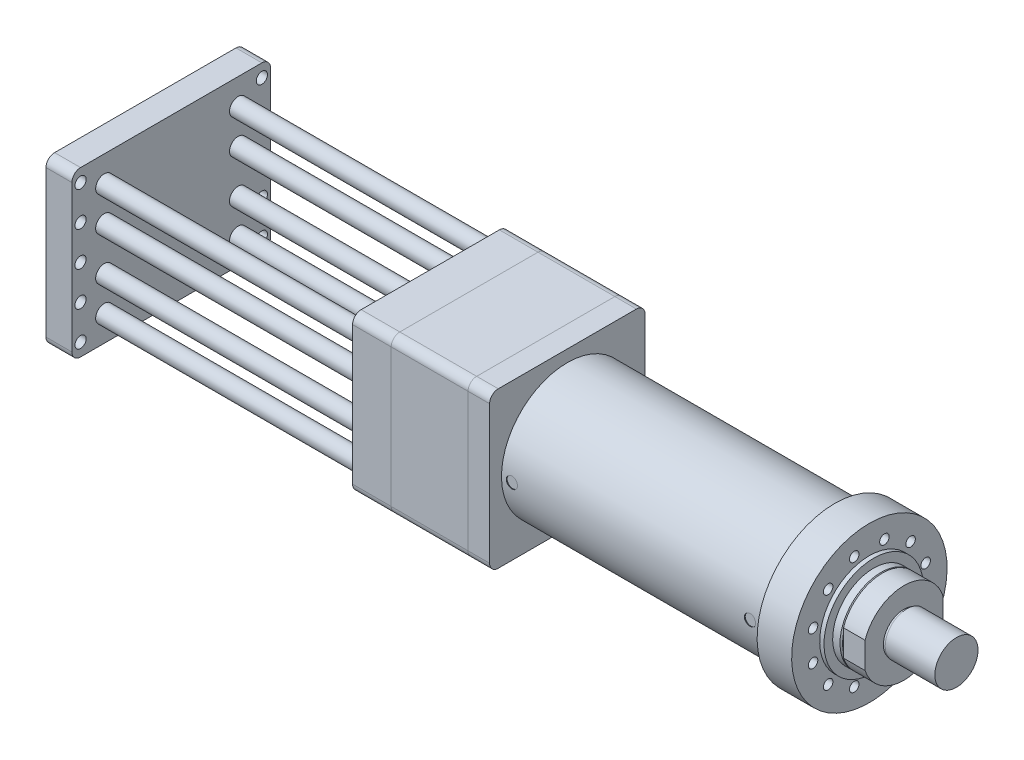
ISO-10303-21;
HEADER;
FILE_DESCRIPTION(('STEP AP214'),'2;1');
FILE_NAME('part.step','',(''),(''),'','','');
FILE_SCHEMA(('AUTOMOTIVE_DESIGN { 1 0 10303 214 1 1 1 1 }'));
ENDSEC;
DATA;
#1=APPLICATION_CONTEXT('core data for automotive mechanical design processes');
#2=APPLICATION_PROTOCOL_DEFINITION('international standard','automotive_design',2000,#1);
#3=PRODUCT_CONTEXT('',#1,'mechanical');
#4=PRODUCT('Part','Part','',(#3));
#5=PRODUCT_RELATED_PRODUCT_CATEGORY('part','',(#4));
#6=PRODUCT_DEFINITION_FORMATION('','',#4);
#7=PRODUCT_DEFINITION_CONTEXT('part definition',#1,'design');
#8=PRODUCT_DEFINITION('design','',#6,#7);
#9=PRODUCT_DEFINITION_SHAPE('','',#8);
#10=(LENGTH_UNIT() NAMED_UNIT(*) SI_UNIT(.MILLI.,.METRE.));
#11=(NAMED_UNIT(*) PLANE_ANGLE_UNIT() SI_UNIT($,.RADIAN.));
#12=(NAMED_UNIT(*) SI_UNIT($,.STERADIAN.) SOLID_ANGLE_UNIT());
#13=UNCERTAINTY_MEASURE_WITH_UNIT(LENGTH_MEASURE(1.E-05),#10,'distance_accuracy_value','');
#14=(GEOMETRIC_REPRESENTATION_CONTEXT(3) GLOBAL_UNCERTAINTY_ASSIGNED_CONTEXT((#13)) GLOBAL_UNIT_ASSIGNED_CONTEXT((#10,
#11,#12)) REPRESENTATION_CONTEXT('',''));
#15=CARTESIAN_POINT('',(0.,0.,0.));
#16=DIRECTION('',(0.,0.,1.));
#17=DIRECTION('',(1.,0.,0.));
#18=AXIS2_PLACEMENT_3D('',#15,#16,#17);
#19=CARTESIAN_POINT('',(-317.5,180.,180.));
#20=DIRECTION('',(0.,0.,-1.));
#21=DIRECTION('',(-1.,0.,0.));
#22=AXIS2_PLACEMENT_3D('',#19,#20,#21);
#23=PLANE('',#22);
#24=DIRECTION('',(0.,1.,0.));
#25=VECTOR('',#24,1.);
#26=CARTESIAN_POINT('',(-317.5,180.,180.));
#27=LINE('',#26,#25);
#28=CARTESIAN_POINT('',(-317.5,-160.,180.));
#29=VERTEX_POINT('',#28);
#30=CARTESIAN_POINT('',(-317.5,160.,180.));
#31=VERTEX_POINT('',#30);
#32=EDGE_CURVE('E182',#29,#31,#27,.T.);
#33=ORIENTED_EDGE('',*,*,#32,.F.);
#34=DIRECTION('',(1.,0.,0.));
#35=VECTOR('',#34,1.);
#36=CARTESIAN_POINT('',(-317.5,-160.,180.));
#37=LINE('',#36,#35);
#38=CARTESIAN_POINT('',(-228.,-160.,180.));
#39=VERTEX_POINT('',#38);
#40=EDGE_CURVE('E167',#29,#39,#37,.T.);
#41=ORIENTED_EDGE('',*,*,#40,.T.);
#42=DIRECTION('',(0.,1.,0.));
#43=VECTOR('',#42,1.);
#44=CARTESIAN_POINT('',(-228.,180.,180.));
#45=LINE('',#44,#43);
#46=CARTESIAN_POINT('',(-228.,160.,180.));
#47=VERTEX_POINT('',#46);
#48=EDGE_CURVE('E179',#39,#47,#45,.T.);
#49=ORIENTED_EDGE('',*,*,#48,.T.);
#50=DIRECTION('',(1.,0.,0.));
#51=VECTOR('',#50,1.);
#52=CARTESIAN_POINT('',(-317.5,160.,180.));
#53=LINE('',#52,#51);
#54=EDGE_CURVE('E184',#47,#31,#53,.F.);
#55=ORIENTED_EDGE('',*,*,#54,.T.);
#56=EDGE_LOOP('',(#33,#41,#49,#55));
#57=FACE_BOUND('',#56,.T.);
#58=ADVANCED_FACE('F50',(#57),#23,.F.);
#59=CARTESIAN_POINT('',(-317.5,180.,-180.));
#60=DIRECTION('',(0.,-1.,0.));
#61=DIRECTION('',(1.,0.,0.));
#62=AXIS2_PLACEMENT_3D('',#59,#60,#61);
#63=PLANE('',#62);
#64=DIRECTION('',(0.,0.,-1.));
#65=VECTOR('',#64,1.);
#66=CARTESIAN_POINT('',(-317.5,180.,-180.));
#67=LINE('',#66,#65);
#68=CARTESIAN_POINT('',(-317.5,180.,160.));
#69=VERTEX_POINT('',#68);
#70=CARTESIAN_POINT('',(-317.5,180.,-160.));
#71=VERTEX_POINT('',#70);
#72=EDGE_CURVE('E333',#69,#71,#67,.T.);
#73=ORIENTED_EDGE('',*,*,#72,.F.);
#74=DIRECTION('',(1.,0.,0.));
#75=VECTOR('',#74,1.);
#76=CARTESIAN_POINT('',(-317.5,180.,160.));
#77=LINE('',#76,#75);
#78=CARTESIAN_POINT('',(-228.,180.,160.));
#79=VERTEX_POINT('',#78);
#80=EDGE_CURVE('E223',#69,#79,#77,.T.);
#81=ORIENTED_EDGE('',*,*,#80,.T.);
#82=DIRECTION('',(0.,0.,-1.));
#83=VECTOR('',#82,1.);
#84=CARTESIAN_POINT('',(-228.,180.,-180.));
#85=LINE('',#84,#83);
#86=CARTESIAN_POINT('',(-228.,180.,-160.));
#87=VERTEX_POINT('',#86);
#88=EDGE_CURVE('E188',#79,#87,#85,.T.);
#89=ORIENTED_EDGE('',*,*,#88,.T.);
#90=DIRECTION('',(1.,0.,0.));
#91=VECTOR('',#90,1.);
#92=CARTESIAN_POINT('',(-317.5,180.,-160.));
#93=LINE('',#92,#91);
#94=EDGE_CURVE('E221',#87,#71,#93,.F.);
#95=ORIENTED_EDGE('',*,*,#94,.T.);
#96=EDGE_LOOP('',(#73,#81,#89,#95));
#97=FACE_BOUND('',#96,.T.);
#98=ADVANCED_FACE('F359',(#97),#63,.F.);
#99=CARTESIAN_POINT('',(-317.5,180.,-180.));
#100=DIRECTION('',(0.,0.,1.));
#101=DIRECTION('',(1.,0.,0.));
#102=AXIS2_PLACEMENT_3D('',#99,#100,#101);
#103=PLANE('',#102);
#104=DIRECTION('',(0.,-1.,0.));
#105=VECTOR('',#104,1.);
#106=CARTESIAN_POINT('',(-228.,180.,-180.));
#107=LINE('',#106,#105);
#108=CARTESIAN_POINT('',(-228.,160.,-180.));
#109=VERTEX_POINT('',#108);
#110=CARTESIAN_POINT('',(-228.,-160.,-180.));
#111=VERTEX_POINT('',#110);
#112=EDGE_CURVE('E192',#109,#111,#107,.T.);
#113=ORIENTED_EDGE('',*,*,#112,.T.);
#114=DIRECTION('',(1.,0.,0.));
#115=VECTOR('',#114,1.);
#116=CARTESIAN_POINT('',(-317.5,-160.,-180.));
#117=LINE('',#116,#115);
#118=CARTESIAN_POINT('',(-317.5,-160.,-180.));
#119=VERTEX_POINT('',#118);
#120=EDGE_CURVE('E229',#111,#119,#117,.F.);
#121=ORIENTED_EDGE('',*,*,#120,.T.);
#122=DIRECTION('',(0.,-1.,0.));
#123=VECTOR('',#122,1.);
#124=CARTESIAN_POINT('',(-317.5,180.,-180.));
#125=LINE('',#124,#123);
#126=CARTESIAN_POINT('',(-317.5,160.,-180.));
#127=VERTEX_POINT('',#126);
#128=EDGE_CURVE('E335',#127,#119,#125,.T.);
#129=ORIENTED_EDGE('',*,*,#128,.F.);
#130=DIRECTION('',(1.,0.,0.));
#131=VECTOR('',#130,1.);
#132=CARTESIAN_POINT('',(-317.5,160.,-180.));
#133=LINE('',#132,#131);
#134=EDGE_CURVE('E226',#127,#109,#133,.T.);
#135=ORIENTED_EDGE('',*,*,#134,.T.);
#136=EDGE_LOOP('',(#113,#121,#129,#135));
#137=FACE_BOUND('',#136,.T.);
#138=ADVANCED_FACE('F351',(#137),#103,.F.);
#139=CARTESIAN_POINT('',(-317.5,-180.,-180.));
#140=DIRECTION('',(0.,1.,0.));
#141=DIRECTION('',(-1.,0.,0.));
#142=AXIS2_PLACEMENT_3D('',#139,#140,#141);
#143=PLANE('',#142);
#144=DIRECTION('',(0.,0.,1.));
#145=VECTOR('',#144,1.);
#146=CARTESIAN_POINT('',(-228.,-180.,-180.));
#147=LINE('',#146,#145);
#148=CARTESIAN_POINT('',(-228.,-180.,-160.));
#149=VERTEX_POINT('',#148);
#150=CARTESIAN_POINT('',(-228.,-180.,160.));
#151=VERTEX_POINT('',#150);
#152=EDGE_CURVE('E203',#149,#151,#147,.T.);
#153=ORIENTED_EDGE('',*,*,#152,.T.);
#154=DIRECTION('',(1.,0.,0.));
#155=VECTOR('',#154,1.);
#156=CARTESIAN_POINT('',(-317.5,-180.,160.));
#157=LINE('',#156,#155);
#158=CARTESIAN_POINT('',(-317.5,-180.,160.));
#159=VERTEX_POINT('',#158);
#160=EDGE_CURVE('E168',#151,#159,#157,.F.);
#161=ORIENTED_EDGE('',*,*,#160,.T.);
#162=DIRECTION('',(0.,0.,1.));
#163=VECTOR('',#162,1.);
#164=CARTESIAN_POINT('',(-317.5,-180.,-180.));
#165=LINE('',#164,#163);
#166=CARTESIAN_POINT('',(-317.5,-180.,-160.));
#167=VERTEX_POINT('',#166);
#168=EDGE_CURVE('E198',#167,#159,#165,.T.);
#169=ORIENTED_EDGE('',*,*,#168,.F.);
#170=DIRECTION('',(1.,0.,0.));
#171=VECTOR('',#170,1.);
#172=CARTESIAN_POINT('',(-317.5,-180.,-160.));
#173=LINE('',#172,#171);
#174=EDGE_CURVE('E173',#167,#149,#173,.T.);
#175=ORIENTED_EDGE('',*,*,#174,.T.);
#176=EDGE_LOOP('',(#153,#161,#169,#175));
#177=FACE_BOUND('',#176,.T.);
#178=ADVANCED_FACE('F345',(#177),#143,.F.);
#179=CARTESIAN_POINT('',(-317.5,0.,0.));
#180=DIRECTION('',(-1.,0.,0.));
#181=DIRECTION('',(0.,-1.,0.));
#182=AXIS2_PLACEMENT_3D('',#179,#180,#181);
#183=PLANE('',#182);
#184=CARTESIAN_POINT('',(-317.5,130.,155.));
#185=DIRECTION('',(-1.,0.,0.));
#186=DIRECTION('',(0.,1.,0.));
#187=AXIS2_PLACEMENT_3D('',#184,#185,#186);
#188=CIRCLE('',#187,20.);
#189=CARTESIAN_POINT('',(-317.5,150.,155.));
#190=VERTEX_POINT('',#189);
#191=EDGE_CURVE('E291',#190,#190,#188,.T.);
#192=ORIENTED_EDGE('',*,*,#191,.F.);
#193=EDGE_LOOP('',(#192));
#194=FACE_BOUND('',#193,.T.);
#195=CARTESIAN_POINT('',(-317.5,50.0000000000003,155.));
#196=DIRECTION('',(-1.,0.,0.));
#197=DIRECTION('',(0.,1.,0.));
#198=AXIS2_PLACEMENT_3D('',#195,#196,#197);
#199=CIRCLE('',#198,20.);
#200=CARTESIAN_POINT('',(-317.5,70.0000000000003,155.));
#201=VERTEX_POINT('',#200);
#202=EDGE_CURVE('E290',#201,#201,#199,.T.);
#203=ORIENTED_EDGE('',*,*,#202,.F.);
#204=EDGE_LOOP('',(#203));
#205=FACE_BOUND('',#204,.T.);
#206=CARTESIAN_POINT('',(-317.5,-49.9999999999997,155.));
#207=DIRECTION('',(-1.,0.,0.));
#208=DIRECTION('',(0.,1.,0.));
#209=AXIS2_PLACEMENT_3D('',#206,#207,#208);
#210=CIRCLE('',#209,20.);
#211=CARTESIAN_POINT('',(-317.5,-29.9999999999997,155.));
#212=VERTEX_POINT('',#211);
#213=EDGE_CURVE('E298',#212,#212,#210,.T.);
#214=ORIENTED_EDGE('',*,*,#213,.F.);
#215=EDGE_LOOP('',(#214));
#216=FACE_BOUND('',#215,.T.);
#217=CARTESIAN_POINT('',(-317.5,-130.,155.));
#218=DIRECTION('',(-1.,0.,0.));
#219=DIRECTION('',(0.,1.,0.));
#220=AXIS2_PLACEMENT_3D('',#217,#218,#219);
#221=CIRCLE('',#220,20.);
#222=CARTESIAN_POINT('',(-317.5,-110.,155.));
#223=VERTEX_POINT('',#222);
#224=EDGE_CURVE('E304',#223,#223,#221,.T.);
#225=ORIENTED_EDGE('',*,*,#224,.F.);
#226=EDGE_LOOP('',(#225));
#227=FACE_BOUND('',#226,.T.);
#228=CARTESIAN_POINT('',(-317.5,-130.,-155.));
#229=DIRECTION('',(-1.,0.,0.));
#230=DIRECTION('',(0.,-1.,0.));
#231=AXIS2_PLACEMENT_3D('',#228,#229,#230);
#232=CIRCLE('',#231,20.);
#233=CARTESIAN_POINT('',(-317.5,-150.,-155.));
#234=VERTEX_POINT('',#233);
#235=EDGE_CURVE('E310',#234,#234,#232,.T.);
#236=ORIENTED_EDGE('',*,*,#235,.F.);
#237=EDGE_LOOP('',(#236));
#238=FACE_BOUND('',#237,.T.);
#239=CARTESIAN_POINT('',(-317.5,-50.,-155.));
#240=DIRECTION('',(-1.,0.,0.));
#241=DIRECTION('',(0.,-1.,0.));
#242=AXIS2_PLACEMENT_3D('',#239,#240,#241);
#243=CIRCLE('',#242,20.);
#244=CARTESIAN_POINT('',(-317.5,-69.9999999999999,-155.));
#245=VERTEX_POINT('',#244);
#246=EDGE_CURVE('E316',#245,#245,#243,.T.);
#247=ORIENTED_EDGE('',*,*,#246,.F.);
#248=EDGE_LOOP('',(#247));
#249=FACE_BOUND('',#248,.T.);
#250=CARTESIAN_POINT('',(-317.5,50.,-155.));
#251=DIRECTION('',(-1.,0.,0.));
#252=DIRECTION('',(0.,-1.,0.));
#253=AXIS2_PLACEMENT_3D('',#250,#251,#252);
#254=CIRCLE('',#253,20.);
#255=CARTESIAN_POINT('',(-317.5,30.0000000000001,-155.));
#256=VERTEX_POINT('',#255);
#257=EDGE_CURVE('E322',#256,#256,#254,.T.);
#258=ORIENTED_EDGE('',*,*,#257,.F.);
#259=EDGE_LOOP('',(#258));
#260=FACE_BOUND('',#259,.T.);
#261=CARTESIAN_POINT('',(-317.5,130.,-155.));
#262=DIRECTION('',(-1.,0.,0.));
#263=DIRECTION('',(0.,-1.,0.));
#264=AXIS2_PLACEMENT_3D('',#261,#262,#263);
#265=CIRCLE('',#264,20.);
#266=CARTESIAN_POINT('',(-317.5,110.,-155.));
#267=VERTEX_POINT('',#266);
#268=EDGE_CURVE('E195',#267,#267,#265,.T.);
#269=ORIENTED_EDGE('',*,*,#268,.F.);
#270=EDGE_LOOP('',(#269));
#271=FACE_BOUND('',#270,.T.);
#272=ORIENTED_EDGE('',*,*,#168,.T.);
#273=CARTESIAN_POINT('',(-317.5,-160.,160.));
#274=DIRECTION('',(-1.,0.,0.));
#275=DIRECTION('',(0.,-1.,0.));
#276=AXIS2_PLACEMENT_3D('',#273,#274,#275);
#277=CIRCLE('',#276,20.);
#278=EDGE_CURVE('E219',#159,#29,#277,.T.);
#279=ORIENTED_EDGE('',*,*,#278,.T.);
#280=ORIENTED_EDGE('',*,*,#32,.T.);
#281=CARTESIAN_POINT('',(-317.5,160.,160.));
#282=DIRECTION('',(-1.,0.,0.));
#283=DIRECTION('',(0.,-1.,0.));
#284=AXIS2_PLACEMENT_3D('',#281,#282,#283);
#285=CIRCLE('',#284,20.);
#286=EDGE_CURVE('E217',#31,#69,#285,.T.);
#287=ORIENTED_EDGE('',*,*,#286,.T.);
#288=ORIENTED_EDGE('',*,*,#72,.T.);
#289=CARTESIAN_POINT('',(-317.5,160.,-160.));
#290=DIRECTION('',(-1.,0.,0.));
#291=DIRECTION('',(0.,-1.,0.));
#292=AXIS2_PLACEMENT_3D('',#289,#290,#291);
#293=CIRCLE('',#292,20.);
#294=EDGE_CURVE('E213',#71,#127,#293,.T.);
#295=ORIENTED_EDGE('',*,*,#294,.T.);
#296=ORIENTED_EDGE('',*,*,#128,.T.);
#297=CARTESIAN_POINT('',(-317.5,-160.,-160.));
#298=DIRECTION('',(-1.,0.,0.));
#299=DIRECTION('',(0.,-1.,0.));
#300=AXIS2_PLACEMENT_3D('',#297,#298,#299);
#301=CIRCLE('',#300,20.);
#302=EDGE_CURVE('E215',#119,#167,#301,.T.);
#303=ORIENTED_EDGE('',*,*,#302,.T.);
#304=EDGE_LOOP('',(#272,#279,#280,#287,#288,#295,#296,#303));
#305=FACE_BOUND('',#304,.T.);
#306=ADVANCED_FACE('F342',(#194,#205,#216,#227,#238,#249,#260,#271,#305),#183,.T.);
#307=CARTESIAN_POINT('',(-228.,0.,0.));
#308=DIRECTION('',(-1.,0.,0.));
#309=DIRECTION('',(0.,-1.,0.));
#310=AXIS2_PLACEMENT_3D('',#307,#308,#309);
#311=PLANE('',#310);
#312=ORIENTED_EDGE('',*,*,#48,.F.);
#313=CARTESIAN_POINT('',(-228.,-160.,160.));
#314=DIRECTION('',(-1.,0.,0.));
#315=DIRECTION('',(0.,-1.,0.));
#316=AXIS2_PLACEMENT_3D('',#313,#314,#315);
#317=CIRCLE('',#316,20.);
#318=EDGE_CURVE('E163',#39,#151,#317,.F.);
#319=ORIENTED_EDGE('',*,*,#318,.T.);
#320=ORIENTED_EDGE('',*,*,#152,.F.);
#321=CARTESIAN_POINT('',(-228.,-160.,-160.));
#322=DIRECTION('',(-1.,0.,0.));
#323=DIRECTION('',(0.,-1.,0.));
#324=AXIS2_PLACEMENT_3D('',#321,#322,#323);
#325=CIRCLE('',#324,20.);
#326=EDGE_CURVE('E207',#149,#111,#325,.F.);
#327=ORIENTED_EDGE('',*,*,#326,.T.);
#328=ORIENTED_EDGE('',*,*,#112,.F.);
#329=CARTESIAN_POINT('',(-228.,160.,-160.));
#330=DIRECTION('',(-1.,0.,0.));
#331=DIRECTION('',(0.,-1.,0.));
#332=AXIS2_PLACEMENT_3D('',#329,#330,#331);
#333=CIRCLE('',#332,20.);
#334=EDGE_CURVE('E183',#109,#87,#333,.F.);
#335=ORIENTED_EDGE('',*,*,#334,.T.);
#336=ORIENTED_EDGE('',*,*,#88,.F.);
#337=CARTESIAN_POINT('',(-228.,160.,160.));
#338=DIRECTION('',(-1.,0.,0.));
#339=DIRECTION('',(0.,-1.,0.));
#340=AXIS2_PLACEMENT_3D('',#337,#338,#339);
#341=CIRCLE('',#340,20.);
#342=EDGE_CURVE('E174',#79,#47,#341,.F.);
#343=ORIENTED_EDGE('',*,*,#342,.T.);
#344=EDGE_LOOP('',(#312,#319,#320,#327,#328,#335,#336,#343));
#345=FACE_BOUND('',#344,.T.);
#346=ADVANCED_FACE('F186',(#345),#311,.F.);
#347=CARTESIAN_POINT('',(-317.5,-160.,160.));
#348=DIRECTION('',(1.,0.,0.));
#349=DIRECTION('',(0.,1.,0.));
#350=AXIS2_PLACEMENT_3D('',#347,#348,#349);
#351=CYLINDRICAL_SURFACE('',#350,20.);
#352=ORIENTED_EDGE('',*,*,#278,.F.);
#353=ORIENTED_EDGE('',*,*,#160,.F.);
#354=ORIENTED_EDGE('',*,*,#318,.F.);
#355=ORIENTED_EDGE('',*,*,#40,.F.);
#356=EDGE_LOOP('',(#352,#353,#354,#355));
#357=FACE_BOUND('',#356,.T.);
#358=ADVANCED_FACE('F166',(#357),#351,.T.);
#359=CARTESIAN_POINT('',(-317.5,160.,160.));
#360=DIRECTION('',(1.,0.,0.));
#361=DIRECTION('',(0.,1.,0.));
#362=AXIS2_PLACEMENT_3D('',#359,#360,#361);
#363=CYLINDRICAL_SURFACE('',#362,20.);
#364=ORIENTED_EDGE('',*,*,#286,.F.);
#365=ORIENTED_EDGE('',*,*,#54,.F.);
#366=ORIENTED_EDGE('',*,*,#342,.F.);
#367=ORIENTED_EDGE('',*,*,#80,.F.);
#368=EDGE_LOOP('',(#364,#365,#366,#367));
#369=FACE_BOUND('',#368,.T.);
#370=ADVANCED_FACE('F363',(#369),#363,.T.);
#371=CARTESIAN_POINT('',(-317.5,-160.,-160.));
#372=DIRECTION('',(1.,0.,0.));
#373=DIRECTION('',(0.,1.,0.));
#374=AXIS2_PLACEMENT_3D('',#371,#372,#373);
#375=CYLINDRICAL_SURFACE('',#374,20.);
#376=ORIENTED_EDGE('',*,*,#302,.F.);
#377=ORIENTED_EDGE('',*,*,#120,.F.);
#378=ORIENTED_EDGE('',*,*,#326,.F.);
#379=ORIENTED_EDGE('',*,*,#174,.F.);
#380=EDGE_LOOP('',(#376,#377,#378,#379));
#381=FACE_BOUND('',#380,.T.);
#382=ADVANCED_FACE('F347',(#381),#375,.T.);
#383=CARTESIAN_POINT('',(-317.5,160.,-160.));
#384=DIRECTION('',(1.,0.,0.));
#385=DIRECTION('',(0.,1.,0.));
#386=AXIS2_PLACEMENT_3D('',#383,#384,#385);
#387=CYLINDRICAL_SURFACE('',#386,20.);
#388=ORIENTED_EDGE('',*,*,#294,.F.);
#389=ORIENTED_EDGE('',*,*,#94,.F.);
#390=ORIENTED_EDGE('',*,*,#334,.F.);
#391=ORIENTED_EDGE('',*,*,#134,.F.);
#392=EDGE_LOOP('',(#388,#389,#390,#391));
#393=FACE_BOUND('',#392,.T.);
#394=ADVANCED_FACE('F355',(#393),#387,.T.);
#395=CARTESIAN_POINT('',(-917.5,130.,-155.));
#396=DIRECTION('',(1.,0.,0.));
#397=DIRECTION('',(0.,1.,0.));
#398=AXIS2_PLACEMENT_3D('',#395,#396,#397);
#399=CYLINDRICAL_SURFACE('',#398,20.);
#400=CARTESIAN_POINT('',(-917.5,130.,-155.));
#401=DIRECTION('',(-1.,0.,0.));
#402=DIRECTION('',(0.,-1.,0.));
#403=AXIS2_PLACEMENT_3D('',#400,#401,#402);
#404=CIRCLE('',#403,20.);
#405=CARTESIAN_POINT('',(-917.5,110.,-155.));
#406=VERTEX_POINT('',#405);
#407=EDGE_CURVE('E189',#406,#406,#404,.T.);
#408=ORIENTED_EDGE('',*,*,#407,.F.);
#409=EDGE_LOOP('',(#408));
#410=FACE_BOUND('',#409,.T.);
#411=ORIENTED_EDGE('',*,*,#268,.T.);
#412=EDGE_LOOP('',(#411));
#413=FACE_BOUND('',#412,.T.);
#414=ADVANCED_FACE('F388',(#410,#413),#399,.T.);
#415=CARTESIAN_POINT('',(-917.5,50.0000000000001,-155.));
#416=DIRECTION('',(1.,0.,0.));
#417=DIRECTION('',(0.,1.,0.));
#418=AXIS2_PLACEMENT_3D('',#415,#416,#417);
#419=CYLINDRICAL_SURFACE('',#418,20.);
#420=CARTESIAN_POINT('',(-917.5,50.0000000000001,-155.));
#421=DIRECTION('',(-1.,0.,0.));
#422=DIRECTION('',(0.,-1.,0.));
#423=AXIS2_PLACEMENT_3D('',#420,#421,#422);
#424=CIRCLE('',#423,20.);
#425=CARTESIAN_POINT('',(-917.5,30.0000000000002,-155.));
#426=VERTEX_POINT('',#425);
#427=EDGE_CURVE('E325',#426,#426,#424,.T.);
#428=ORIENTED_EDGE('',*,*,#427,.F.);
#429=EDGE_LOOP('',(#428));
#430=FACE_BOUND('',#429,.T.);
#431=ORIENTED_EDGE('',*,*,#257,.T.);
#432=EDGE_LOOP('',(#431));
#433=FACE_BOUND('',#432,.T.);
#434=ADVANCED_FACE('F391',(#430,#433),#419,.T.);
#435=CARTESIAN_POINT('',(-917.5,-49.9999999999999,-155.));
#436=DIRECTION('',(1.,0.,0.));
#437=DIRECTION('',(0.,1.,0.));
#438=AXIS2_PLACEMENT_3D('',#435,#436,#437);
#439=CYLINDRICAL_SURFACE('',#438,20.);
#440=CARTESIAN_POINT('',(-917.5,-49.9999999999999,-155.));
#441=DIRECTION('',(-1.,0.,0.));
#442=DIRECTION('',(0.,-1.,0.));
#443=AXIS2_PLACEMENT_3D('',#440,#441,#442);
#444=CIRCLE('',#443,20.);
#445=CARTESIAN_POINT('',(-917.5,-69.9999999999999,-155.));
#446=VERTEX_POINT('',#445);
#447=EDGE_CURVE('E319',#446,#446,#444,.T.);
#448=ORIENTED_EDGE('',*,*,#447,.F.);
#449=EDGE_LOOP('',(#448));
#450=FACE_BOUND('',#449,.T.);
#451=ORIENTED_EDGE('',*,*,#246,.T.);
#452=EDGE_LOOP('',(#451));
#453=FACE_BOUND('',#452,.T.);
#454=ADVANCED_FACE('F395',(#450,#453),#439,.T.);
#455=CARTESIAN_POINT('',(-917.5,-130.,-155.));
#456=DIRECTION('',(1.,0.,0.));
#457=DIRECTION('',(0.,1.,0.));
#458=AXIS2_PLACEMENT_3D('',#455,#456,#457);
#459=CYLINDRICAL_SURFACE('',#458,20.);
#460=CARTESIAN_POINT('',(-917.5,-130.,-155.));
#461=DIRECTION('',(-1.,0.,0.));
#462=DIRECTION('',(0.,-1.,0.));
#463=AXIS2_PLACEMENT_3D('',#460,#461,#462);
#464=CIRCLE('',#463,20.);
#465=CARTESIAN_POINT('',(-917.5,-150.,-155.));
#466=VERTEX_POINT('',#465);
#467=EDGE_CURVE('E313',#466,#466,#464,.T.);
#468=ORIENTED_EDGE('',*,*,#467,.F.);
#469=EDGE_LOOP('',(#468));
#470=FACE_BOUND('',#469,.T.);
#471=ORIENTED_EDGE('',*,*,#235,.T.);
#472=EDGE_LOOP('',(#471));
#473=FACE_BOUND('',#472,.T.);
#474=ADVANCED_FACE('F399',(#470,#473),#459,.T.);
#475=CARTESIAN_POINT('',(-917.5,-130.,155.));
#476=DIRECTION('',(1.,0.,0.));
#477=DIRECTION('',(0.,1.,0.));
#478=AXIS2_PLACEMENT_3D('',#475,#476,#477);
#479=CYLINDRICAL_SURFACE('',#478,20.);
#480=CARTESIAN_POINT('',(-917.5,-130.,155.));
#481=DIRECTION('',(-1.,0.,0.));
#482=DIRECTION('',(0.,1.,0.));
#483=AXIS2_PLACEMENT_3D('',#480,#481,#482);
#484=CIRCLE('',#483,20.);
#485=CARTESIAN_POINT('',(-917.5,-110.,155.));
#486=VERTEX_POINT('',#485);
#487=EDGE_CURVE('E307',#486,#486,#484,.T.);
#488=ORIENTED_EDGE('',*,*,#487,.F.);
#489=EDGE_LOOP('',(#488));
#490=FACE_BOUND('',#489,.T.);
#491=ORIENTED_EDGE('',*,*,#224,.T.);
#492=EDGE_LOOP('',(#491));
#493=FACE_BOUND('',#492,.T.);
#494=ADVANCED_FACE('F403',(#490,#493),#479,.T.);
#495=CARTESIAN_POINT('',(-917.5,-49.9999999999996,155.));
#496=DIRECTION('',(1.,0.,0.));
#497=DIRECTION('',(0.,1.,0.));
#498=AXIS2_PLACEMENT_3D('',#495,#496,#497);
#499=CYLINDRICAL_SURFACE('',#498,20.);
#500=CARTESIAN_POINT('',(-917.5,-49.9999999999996,155.));
#501=DIRECTION('',(-1.,0.,0.));
#502=DIRECTION('',(0.,1.,0.));
#503=AXIS2_PLACEMENT_3D('',#500,#501,#502);
#504=CIRCLE('',#503,20.);
#505=CARTESIAN_POINT('',(-917.5,-29.9999999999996,155.));
#506=VERTEX_POINT('',#505);
#507=EDGE_CURVE('E301',#506,#506,#504,.T.);
#508=ORIENTED_EDGE('',*,*,#507,.F.);
#509=EDGE_LOOP('',(#508));
#510=FACE_BOUND('',#509,.T.);
#511=ORIENTED_EDGE('',*,*,#213,.T.);
#512=EDGE_LOOP('',(#511));
#513=FACE_BOUND('',#512,.T.);
#514=ADVANCED_FACE('F407',(#510,#513),#499,.T.);
#515=CARTESIAN_POINT('',(-917.5,50.0000000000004,155.));
#516=DIRECTION('',(1.,0.,0.));
#517=DIRECTION('',(0.,1.,0.));
#518=AXIS2_PLACEMENT_3D('',#515,#516,#517);
#519=CYLINDRICAL_SURFACE('',#518,20.);
#520=CARTESIAN_POINT('',(-917.5,50.0000000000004,155.));
#521=DIRECTION('',(-1.,0.,0.));
#522=DIRECTION('',(0.,1.,0.));
#523=AXIS2_PLACEMENT_3D('',#520,#521,#522);
#524=CIRCLE('',#523,20.);
#525=CARTESIAN_POINT('',(-917.5,70.0000000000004,155.));
#526=VERTEX_POINT('',#525);
#527=EDGE_CURVE('E295',#526,#526,#524,.T.);
#528=ORIENTED_EDGE('',*,*,#527,.F.);
#529=EDGE_LOOP('',(#528));
#530=FACE_BOUND('',#529,.T.);
#531=ORIENTED_EDGE('',*,*,#202,.T.);
#532=EDGE_LOOP('',(#531));
#533=FACE_BOUND('',#532,.T.);
#534=ADVANCED_FACE('F411',(#530,#533),#519,.T.);
#535=CARTESIAN_POINT('',(-917.5,130.,155.));
#536=DIRECTION('',(1.,0.,0.));
#537=DIRECTION('',(0.,1.,0.));
#538=AXIS2_PLACEMENT_3D('',#535,#536,#537);
#539=CYLINDRICAL_SURFACE('',#538,20.);
#540=CARTESIAN_POINT('',(-917.5,130.,155.));
#541=DIRECTION('',(-1.,0.,0.));
#542=DIRECTION('',(0.,1.,0.));
#543=AXIS2_PLACEMENT_3D('',#540,#541,#542);
#544=CIRCLE('',#543,20.);
#545=CARTESIAN_POINT('',(-917.5,150.,155.));
#546=VERTEX_POINT('',#545);
#547=EDGE_CURVE('E287',#546,#546,#544,.T.);
#548=ORIENTED_EDGE('',*,*,#547,.F.);
#549=EDGE_LOOP('',(#548));
#550=FACE_BOUND('',#549,.T.);
#551=ORIENTED_EDGE('',*,*,#191,.T.);
#552=EDGE_LOOP('',(#551));
#553=FACE_BOUND('',#552,.T.);
#554=ADVANCED_FACE('F415',(#550,#553),#539,.T.);
#555=CARTESIAN_POINT('',(-977.5,0.,0.));
#556=DIRECTION('',(-1.,0.,0.));
#557=DIRECTION('',(0.,0.,1.));
#558=AXIS2_PLACEMENT_3D('',#555,#556,#557);
#559=PLANE('',#558);
#560=CARTESIAN_POINT('',(-977.5,80.0000000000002,210.));
#561=DIRECTION('',(-1.,0.,0.));
#562=DIRECTION('',(0.,1.,0.));
#563=AXIS2_PLACEMENT_3D('',#560,#561,#562);
#564=CIRCLE('',#563,13.);
#565=CARTESIAN_POINT('',(-977.5,93.0000000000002,210.));
#566=VERTEX_POINT('',#565);
#567=EDGE_CURVE('E499',#566,#566,#564,.T.);
#568=ORIENTED_EDGE('',*,*,#567,.F.);
#569=EDGE_LOOP('',(#568));
#570=FACE_BOUND('',#569,.T.);
#571=CARTESIAN_POINT('',(-977.5,-79.9999999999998,210.));
#572=DIRECTION('',(-1.,0.,0.));
#573=DIRECTION('',(0.,1.,0.));
#574=AXIS2_PLACEMENT_3D('',#571,#572,#573);
#575=CIRCLE('',#574,13.);
#576=CARTESIAN_POINT('',(-977.5,-66.9999999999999,210.));
#577=VERTEX_POINT('',#576);
#578=EDGE_CURVE('E511',#577,#577,#575,.T.);
#579=ORIENTED_EDGE('',*,*,#578,.F.);
#580=EDGE_LOOP('',(#579));
#581=FACE_BOUND('',#580,.T.);
#582=CARTESIAN_POINT('',(-977.5,80.0000000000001,-210.));
#583=DIRECTION('',(-1.,0.,0.));
#584=DIRECTION('',(0.,-1.,0.));
#585=AXIS2_PLACEMENT_3D('',#582,#583,#584);
#586=CIRCLE('',#585,13.);
#587=CARTESIAN_POINT('',(-977.5,67.0000000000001,-210.));
#588=VERTEX_POINT('',#587);
#589=EDGE_CURVE('E523',#588,#588,#586,.T.);
#590=ORIENTED_EDGE('',*,*,#589,.F.);
#591=EDGE_LOOP('',(#590));
#592=FACE_BOUND('',#591,.T.);
#593=CARTESIAN_POINT('',(-977.5,-79.9999999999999,-210.));
#594=DIRECTION('',(-1.,0.,0.));
#595=DIRECTION('',(0.,-1.,0.));
#596=AXIS2_PLACEMENT_3D('',#593,#594,#595);
#597=CIRCLE('',#596,13.);
#598=CARTESIAN_POINT('',(-977.5,-92.9999999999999,-210.));
#599=VERTEX_POINT('',#598);
#600=EDGE_CURVE('E535',#599,#599,#597,.T.);
#601=ORIENTED_EDGE('',*,*,#600,.F.);
#602=EDGE_LOOP('',(#601));
#603=FACE_BOUND('',#602,.T.);
#604=CARTESIAN_POINT('',(-977.5,160.,-210.));
#605=DIRECTION('',(-1.,0.,0.));
#606=DIRECTION('',(0.,-1.,0.));
#607=AXIS2_PLACEMENT_3D('',#604,#605,#606);
#608=CIRCLE('',#607,13.);
#609=CARTESIAN_POINT('',(-977.5,147.,-210.));
#610=VERTEX_POINT('',#609);
#611=EDGE_CURVE('E280',#610,#610,#608,.T.);
#612=ORIENTED_EDGE('',*,*,#611,.F.);
#613=EDGE_LOOP('',(#612));
#614=FACE_BOUND('',#613,.T.);
#615=DIRECTION('',(0.,-1.,0.));
#616=VECTOR('',#615,1.);
#617=CARTESIAN_POINT('',(-977.5,190.,-230.));
#618=LINE('',#617,#616);
#619=CARTESIAN_POINT('',(-977.5,170.,-230.));
#620=VERTEX_POINT('',#619);
#621=CARTESIAN_POINT('',(-977.5,-170.,-230.));
#622=VERTEX_POINT('',#621);
#623=EDGE_CURVE('E553',#620,#622,#618,.T.);
#624=ORIENTED_EDGE('',*,*,#623,.T.);
#625=CARTESIAN_POINT('',(-977.5,-170.,-210.));
#626=DIRECTION('',(-1.,0.,0.));
#627=DIRECTION('',(0.,0.,1.));
#628=AXIS2_PLACEMENT_3D('',#625,#626,#627);
#629=CIRCLE('',#628,20.);
#630=CARTESIAN_POINT('',(-977.5,-190.,-210.));
#631=VERTEX_POINT('',#630);
#632=EDGE_CURVE('E254',#622,#631,#629,.T.);
#633=ORIENTED_EDGE('',*,*,#632,.T.);
#634=DIRECTION('',(0.,0.,1.));
#635=VECTOR('',#634,1.);
#636=CARTESIAN_POINT('',(-977.5,-190.,-230.));
#637=LINE('',#636,#635);
#638=CARTESIAN_POINT('',(-977.5,-190.,210.));
#639=VERTEX_POINT('',#638);
#640=EDGE_CURVE('E294',#631,#639,#637,.T.);
#641=ORIENTED_EDGE('',*,*,#640,.T.);
#642=CARTESIAN_POINT('',(-977.5,-170.,210.));
#643=DIRECTION('',(-1.,0.,0.));
#644=DIRECTION('',(0.,0.,1.));
#645=AXIS2_PLACEMENT_3D('',#642,#643,#644);
#646=CIRCLE('',#645,20.);
#647=CARTESIAN_POINT('',(-977.5,-170.,230.));
#648=VERTEX_POINT('',#647);
#649=EDGE_CURVE('E252',#639,#648,#646,.T.);
#650=ORIENTED_EDGE('',*,*,#649,.T.);
#651=DIRECTION('',(0.,1.,0.));
#652=VECTOR('',#651,1.);
#653=CARTESIAN_POINT('',(-977.5,190.,230.));
#654=LINE('',#653,#652);
#655=CARTESIAN_POINT('',(-977.5,170.,230.));
#656=VERTEX_POINT('',#655);
#657=EDGE_CURVE('E286',#648,#656,#654,.T.);
#658=ORIENTED_EDGE('',*,*,#657,.T.);
#659=CARTESIAN_POINT('',(-977.5,170.,210.));
#660=DIRECTION('',(-1.,0.,0.));
#661=DIRECTION('',(0.,0.,1.));
#662=AXIS2_PLACEMENT_3D('',#659,#660,#661);
#663=CIRCLE('',#662,20.);
#664=CARTESIAN_POINT('',(-977.5,190.,210.));
#665=VERTEX_POINT('',#664);
#666=EDGE_CURVE('E70',#656,#665,#663,.T.);
#667=ORIENTED_EDGE('',*,*,#666,.T.);
#668=DIRECTION('',(0.,0.,-1.));
#669=VECTOR('',#668,1.);
#670=CARTESIAN_POINT('',(-977.5,190.,-230.));
#671=LINE('',#670,#669);
#672=CARTESIAN_POINT('',(-977.5,190.,-210.));
#673=VERTEX_POINT('',#672);
#674=EDGE_CURVE('E265',#665,#673,#671,.T.);
#675=ORIENTED_EDGE('',*,*,#674,.T.);
#676=CARTESIAN_POINT('',(-977.5,170.,-210.));
#677=DIRECTION('',(-1.,0.,0.));
#678=DIRECTION('',(0.,0.,1.));
#679=AXIS2_PLACEMENT_3D('',#676,#677,#678);
#680=CIRCLE('',#679,20.);
#681=EDGE_CURVE('E250',#673,#620,#680,.T.);
#682=ORIENTED_EDGE('',*,*,#681,.T.);
#683=EDGE_LOOP('',(#624,#633,#641,#650,#658,#667,#675,#682));
#684=FACE_BOUND('',#683,.T.);
#685=CARTESIAN_POINT('',(-977.5,0.,-210.));
#686=DIRECTION('',(-1.,0.,0.));
#687=DIRECTION('',(0.,-1.,0.));
#688=AXIS2_PLACEMENT_3D('',#685,#686,#687);
#689=CIRCLE('',#688,13.);
#690=CARTESIAN_POINT('',(-977.5,-12.9999999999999,-210.));
#691=VERTEX_POINT('',#690);
#692=EDGE_CURVE('E541',#691,#691,#689,.T.);
#693=ORIENTED_EDGE('',*,*,#692,.F.);
#694=EDGE_LOOP('',(#693));
#695=FACE_BOUND('',#694,.T.);
#696=CARTESIAN_POINT('',(-977.5,-160.,-210.));
#697=DIRECTION('',(-1.,0.,0.));
#698=DIRECTION('',(0.,-1.,0.));
#699=AXIS2_PLACEMENT_3D('',#696,#697,#698);
#700=CIRCLE('',#699,13.);
#701=CARTESIAN_POINT('',(-977.5,-173.,-210.));
#702=VERTEX_POINT('',#701);
#703=EDGE_CURVE('E529',#702,#702,#700,.T.);
#704=ORIENTED_EDGE('',*,*,#703,.F.);
#705=EDGE_LOOP('',(#704));
#706=FACE_BOUND('',#705,.T.);
#707=CARTESIAN_POINT('',(-977.5,-160.,210.));
#708=DIRECTION('',(-1.,0.,0.));
#709=DIRECTION('',(0.,1.,0.));
#710=AXIS2_PLACEMENT_3D('',#707,#708,#709);
#711=CIRCLE('',#710,13.);
#712=CARTESIAN_POINT('',(-977.5,-147.,210.));
#713=VERTEX_POINT('',#712);
#714=EDGE_CURVE('E517',#713,#713,#711,.T.);
#715=ORIENTED_EDGE('',*,*,#714,.F.);
#716=EDGE_LOOP('',(#715));
#717=FACE_BOUND('',#716,.T.);
#718=CARTESIAN_POINT('',(-977.5,1.46391386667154E-13,210.));
#719=DIRECTION('',(-1.,0.,0.));
#720=DIRECTION('',(0.,1.,0.));
#721=AXIS2_PLACEMENT_3D('',#718,#719,#720);
#722=CIRCLE('',#721,13.);
#723=CARTESIAN_POINT('',(-977.5,13.0000000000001,210.));
#724=VERTEX_POINT('',#723);
#725=EDGE_CURVE('E505',#724,#724,#722,.T.);
#726=ORIENTED_EDGE('',*,*,#725,.F.);
#727=EDGE_LOOP('',(#726));
#728=FACE_BOUND('',#727,.T.);
#729=CARTESIAN_POINT('',(-977.5,160.,210.));
#730=DIRECTION('',(-1.,0.,0.));
#731=DIRECTION('',(0.,1.,0.));
#732=AXIS2_PLACEMENT_3D('',#729,#730,#731);
#733=CIRCLE('',#732,13.);
#734=CARTESIAN_POINT('',(-977.5,173.,210.));
#735=VERTEX_POINT('',#734);
#736=EDGE_CURVE('E490',#735,#735,#733,.T.);
#737=ORIENTED_EDGE('',*,*,#736,.F.);
#738=EDGE_LOOP('',(#737));
#739=FACE_BOUND('',#738,.T.);
#740=ADVANCED_FACE('F419',(#570,#581,#592,#603,#614,#684,#695,#706,#717,#728,#739),#559,.T.);
#741=CARTESIAN_POINT('',(-917.5,0.,0.));
#742=DIRECTION('',(-1.,0.,0.));
#743=DIRECTION('',(0.,0.,1.));
#744=AXIS2_PLACEMENT_3D('',#741,#742,#743);
#745=PLANE('',#744);
#746=ORIENTED_EDGE('',*,*,#407,.T.);
#747=EDGE_LOOP('',(#746));
#748=FACE_BOUND('',#747,.T.);
#749=ORIENTED_EDGE('',*,*,#427,.T.);
#750=EDGE_LOOP('',(#749));
#751=FACE_BOUND('',#750,.T.);
#752=ORIENTED_EDGE('',*,*,#447,.T.);
#753=EDGE_LOOP('',(#752));
#754=FACE_BOUND('',#753,.T.);
#755=ORIENTED_EDGE('',*,*,#467,.T.);
#756=EDGE_LOOP('',(#755));
#757=FACE_BOUND('',#756,.T.);
#758=ORIENTED_EDGE('',*,*,#487,.T.);
#759=EDGE_LOOP('',(#758));
#760=FACE_BOUND('',#759,.T.);
#761=ORIENTED_EDGE('',*,*,#507,.T.);
#762=EDGE_LOOP('',(#761));
#763=FACE_BOUND('',#762,.T.);
#764=ORIENTED_EDGE('',*,*,#527,.T.);
#765=EDGE_LOOP('',(#764));
#766=FACE_BOUND('',#765,.T.);
#767=ORIENTED_EDGE('',*,*,#547,.T.);
#768=EDGE_LOOP('',(#767));
#769=FACE_BOUND('',#768,.T.);
#770=DIRECTION('',(0.,0.,1.));
#771=VECTOR('',#770,1.);
#772=CARTESIAN_POINT('',(-917.5,-190.,-230.));
#773=LINE('',#772,#771);
#774=CARTESIAN_POINT('',(-917.5,-190.,-210.));
#775=VERTEX_POINT('',#774);
#776=CARTESIAN_POINT('',(-917.5,-190.,210.));
#777=VERTEX_POINT('',#776);
#778=EDGE_CURVE('E278',#775,#777,#773,.T.);
#779=ORIENTED_EDGE('',*,*,#778,.F.);
#780=CARTESIAN_POINT('',(-917.5,-170.,-210.));
#781=DIRECTION('',(-1.,0.,0.));
#782=DIRECTION('',(0.,0.,1.));
#783=AXIS2_PLACEMENT_3D('',#780,#781,#782);
#784=CIRCLE('',#783,20.);
#785=CARTESIAN_POINT('',(-917.5,-170.,-230.));
#786=VERTEX_POINT('',#785);
#787=EDGE_CURVE('E242',#775,#786,#784,.F.);
#788=ORIENTED_EDGE('',*,*,#787,.T.);
#789=DIRECTION('',(0.,-1.,0.));
#790=VECTOR('',#789,1.);
#791=CARTESIAN_POINT('',(-917.5,190.,-230.));
#792=LINE('',#791,#790);
#793=CARTESIAN_POINT('',(-917.5,170.,-230.));
#794=VERTEX_POINT('',#793);
#795=EDGE_CURVE('E274',#794,#786,#792,.T.);
#796=ORIENTED_EDGE('',*,*,#795,.F.);
#797=CARTESIAN_POINT('',(-917.5,170.,-210.));
#798=DIRECTION('',(-1.,0.,0.));
#799=DIRECTION('',(0.,0.,1.));
#800=AXIS2_PLACEMENT_3D('',#797,#798,#799);
#801=CIRCLE('',#800,20.);
#802=CARTESIAN_POINT('',(-917.5,190.,-210.));
#803=VERTEX_POINT('',#802);
#804=EDGE_CURVE('E238',#794,#803,#801,.F.);
#805=ORIENTED_EDGE('',*,*,#804,.T.);
#806=DIRECTION('',(0.,0.,-1.));
#807=VECTOR('',#806,1.);
#808=CARTESIAN_POINT('',(-917.5,190.,-230.));
#809=LINE('',#808,#807);
#810=CARTESIAN_POINT('',(-917.5,190.,210.));
#811=VERTEX_POINT('',#810);
#812=EDGE_CURVE('E264',#811,#803,#809,.T.);
#813=ORIENTED_EDGE('',*,*,#812,.F.);
#814=CARTESIAN_POINT('',(-917.5,170.,210.));
#815=DIRECTION('',(-1.,0.,0.));
#816=DIRECTION('',(0.,0.,1.));
#817=AXIS2_PLACEMENT_3D('',#814,#815,#816);
#818=CIRCLE('',#817,20.);
#819=CARTESIAN_POINT('',(-917.5,170.,230.));
#820=VERTEX_POINT('',#819);
#821=EDGE_CURVE('E236',#811,#820,#818,.F.);
#822=ORIENTED_EDGE('',*,*,#821,.T.);
#823=DIRECTION('',(0.,1.,0.));
#824=VECTOR('',#823,1.);
#825=CARTESIAN_POINT('',(-917.5,190.,230.));
#826=LINE('',#825,#824);
#827=CARTESIAN_POINT('',(-917.5,-170.,230.));
#828=VERTEX_POINT('',#827);
#829=EDGE_CURVE('E275',#828,#820,#826,.T.);
#830=ORIENTED_EDGE('',*,*,#829,.F.);
#831=CARTESIAN_POINT('',(-917.5,-170.,210.));
#832=DIRECTION('',(-1.,0.,0.));
#833=DIRECTION('',(0.,0.,1.));
#834=AXIS2_PLACEMENT_3D('',#831,#832,#833);
#835=CIRCLE('',#834,20.);
#836=EDGE_CURVE('E240',#828,#777,#835,.F.);
#837=ORIENTED_EDGE('',*,*,#836,.T.);
#838=EDGE_LOOP('',(#779,#788,#796,#805,#813,#822,#830,#837));
#839=FACE_BOUND('',#838,.T.);
#840=CARTESIAN_POINT('',(-917.5,160.,-210.));
#841=DIRECTION('',(-1.,0.,0.));
#842=DIRECTION('',(0.,-1.,0.));
#843=AXIS2_PLACEMENT_3D('',#840,#841,#842);
#844=CIRCLE('',#843,13.);
#845=CARTESIAN_POINT('',(-917.5,147.,-210.));
#846=VERTEX_POINT('',#845);
#847=EDGE_CURVE('E544',#846,#846,#844,.T.);
#848=ORIENTED_EDGE('',*,*,#847,.T.);
#849=EDGE_LOOP('',(#848));
#850=FACE_BOUND('',#849,.T.);
#851=CARTESIAN_POINT('',(-917.5,0.,-210.));
#852=DIRECTION('',(-1.,0.,0.));
#853=DIRECTION('',(0.,-1.,0.));
#854=AXIS2_PLACEMENT_3D('',#851,#852,#853);
#855=CIRCLE('',#854,13.);
#856=CARTESIAN_POINT('',(-917.5,-12.9999999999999,-210.));
#857=VERTEX_POINT('',#856);
#858=EDGE_CURVE('E538',#857,#857,#855,.T.);
#859=ORIENTED_EDGE('',*,*,#858,.T.);
#860=EDGE_LOOP('',(#859));
#861=FACE_BOUND('',#860,.T.);
#862=CARTESIAN_POINT('',(-917.5,-79.9999999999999,-210.));
#863=DIRECTION('',(-1.,0.,0.));
#864=DIRECTION('',(0.,-1.,0.));
#865=AXIS2_PLACEMENT_3D('',#862,#863,#864);
#866=CIRCLE('',#865,13.);
#867=CARTESIAN_POINT('',(-917.5,-92.9999999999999,-210.));
#868=VERTEX_POINT('',#867);
#869=EDGE_CURVE('E532',#868,#868,#866,.T.);
#870=ORIENTED_EDGE('',*,*,#869,.T.);
#871=EDGE_LOOP('',(#870));
#872=FACE_BOUND('',#871,.T.);
#873=CARTESIAN_POINT('',(-917.5,-160.,-210.));
#874=DIRECTION('',(-1.,0.,0.));
#875=DIRECTION('',(0.,-1.,0.));
#876=AXIS2_PLACEMENT_3D('',#873,#874,#875);
#877=CIRCLE('',#876,13.);
#878=CARTESIAN_POINT('',(-917.5,-173.,-210.));
#879=VERTEX_POINT('',#878);
#880=EDGE_CURVE('E526',#879,#879,#877,.T.);
#881=ORIENTED_EDGE('',*,*,#880,.T.);
#882=EDGE_LOOP('',(#881));
#883=FACE_BOUND('',#882,.T.);
#884=CARTESIAN_POINT('',(-917.5,80.0000000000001,-210.));
#885=DIRECTION('',(-1.,0.,0.));
#886=DIRECTION('',(0.,-1.,0.));
#887=AXIS2_PLACEMENT_3D('',#884,#885,#886);
#888=CIRCLE('',#887,13.);
#889=CARTESIAN_POINT('',(-917.5,67.0000000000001,-210.));
#890=VERTEX_POINT('',#889);
#891=EDGE_CURVE('E520',#890,#890,#888,.T.);
#892=ORIENTED_EDGE('',*,*,#891,.T.);
#893=EDGE_LOOP('',(#892));
#894=FACE_BOUND('',#893,.T.);
#895=CARTESIAN_POINT('',(-917.5,-160.,210.));
#896=DIRECTION('',(-1.,0.,0.));
#897=DIRECTION('',(0.,1.,0.));
#898=AXIS2_PLACEMENT_3D('',#895,#896,#897);
#899=CIRCLE('',#898,13.);
#900=CARTESIAN_POINT('',(-917.5,-147.,210.));
#901=VERTEX_POINT('',#900);
#902=EDGE_CURVE('E514',#901,#901,#899,.T.);
#903=ORIENTED_EDGE('',*,*,#902,.T.);
#904=EDGE_LOOP('',(#903));
#905=FACE_BOUND('',#904,.T.);
#906=CARTESIAN_POINT('',(-917.5,-79.9999999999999,210.));
#907=DIRECTION('',(-1.,0.,0.));
#908=DIRECTION('',(0.,1.,0.));
#909=AXIS2_PLACEMENT_3D('',#906,#907,#908);
#910=CIRCLE('',#909,13.);
#911=CARTESIAN_POINT('',(-917.5,-66.9999999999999,210.));
#912=VERTEX_POINT('',#911);
#913=EDGE_CURVE('E508',#912,#912,#910,.T.);
#914=ORIENTED_EDGE('',*,*,#913,.T.);
#915=EDGE_LOOP('',(#914));
#916=FACE_BOUND('',#915,.T.);
#917=CARTESIAN_POINT('',(-917.5,1.37139528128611E-13,210.));
#918=DIRECTION('',(-1.,0.,0.));
#919=DIRECTION('',(0.,1.,0.));
#920=AXIS2_PLACEMENT_3D('',#917,#918,#919);
#921=CIRCLE('',#920,13.);
#922=CARTESIAN_POINT('',(-917.5,13.0000000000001,210.));
#923=VERTEX_POINT('',#922);
#924=EDGE_CURVE('E502',#923,#923,#921,.T.);
#925=ORIENTED_EDGE('',*,*,#924,.T.);
#926=EDGE_LOOP('',(#925));
#927=FACE_BOUND('',#926,.T.);
#928=CARTESIAN_POINT('',(-917.5,80.0000000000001,210.));
#929=DIRECTION('',(-1.,0.,0.));
#930=DIRECTION('',(0.,1.,0.));
#931=AXIS2_PLACEMENT_3D('',#928,#929,#930);
#932=CIRCLE('',#931,13.);
#933=CARTESIAN_POINT('',(-917.5,93.0000000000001,210.));
#934=VERTEX_POINT('',#933);
#935=EDGE_CURVE('E496',#934,#934,#932,.T.);
#936=ORIENTED_EDGE('',*,*,#935,.T.);
#937=EDGE_LOOP('',(#936));
#938=FACE_BOUND('',#937,.T.);
#939=CARTESIAN_POINT('',(-917.5,160.,210.));
#940=DIRECTION('',(-1.,0.,0.));
#941=DIRECTION('',(0.,1.,0.));
#942=AXIS2_PLACEMENT_3D('',#939,#940,#941);
#943=CIRCLE('',#942,13.);
#944=CARTESIAN_POINT('',(-917.5,173.,210.));
#945=VERTEX_POINT('',#944);
#946=EDGE_CURVE('E493',#945,#945,#943,.T.);
#947=ORIENTED_EDGE('',*,*,#946,.T.);
#948=EDGE_LOOP('',(#947));
#949=FACE_BOUND('',#948,.T.);
#950=ADVANCED_FACE('F269',(#748,#751,#754,#757,#760,#763,#766,#769,#839,#850,#861,#872,#883,
#894,#905,#916,#927,#938,#949),#745,.F.);
#951=CARTESIAN_POINT('',(-977.5,190.,230.));
#952=DIRECTION('',(0.,0.,-1.));
#953=DIRECTION('',(-1.,0.,0.));
#954=AXIS2_PLACEMENT_3D('',#951,#952,#953);
#955=PLANE('',#954);
#956=ORIENTED_EDGE('',*,*,#657,.F.);
#957=DIRECTION('',(1.,0.,0.));
#958=VECTOR('',#957,1.);
#959=CARTESIAN_POINT('',(-977.5,-170.,230.));
#960=LINE('',#959,#958);
#961=EDGE_CURVE('E258',#648,#828,#960,.T.);
#962=ORIENTED_EDGE('',*,*,#961,.T.);
#963=ORIENTED_EDGE('',*,*,#829,.T.);
#964=DIRECTION('',(1.,0.,0.));
#965=VECTOR('',#964,1.);
#966=CARTESIAN_POINT('',(-977.5,170.,230.));
#967=LINE('',#966,#965);
#968=EDGE_CURVE('E256',#820,#656,#967,.F.);
#969=ORIENTED_EDGE('',*,*,#968,.T.);
#970=EDGE_LOOP('',(#956,#962,#963,#969));
#971=FACE_BOUND('',#970,.T.);
#972=ADVANCED_FACE('F421',(#971),#955,.F.);
#973=CARTESIAN_POINT('',(-977.5,190.,-230.));
#974=DIRECTION('',(0.,-1.,0.));
#975=DIRECTION('',(1.,0.,0.));
#976=AXIS2_PLACEMENT_3D('',#973,#974,#975);
#977=PLANE('',#976);
#978=ORIENTED_EDGE('',*,*,#812,.T.);
#979=DIRECTION('',(1.,0.,0.));
#980=VECTOR('',#979,1.);
#981=CARTESIAN_POINT('',(-977.5,190.,-210.));
#982=LINE('',#981,#980);
#983=EDGE_CURVE('E12',#803,#673,#982,.F.);
#984=ORIENTED_EDGE('',*,*,#983,.T.);
#985=ORIENTED_EDGE('',*,*,#674,.F.);
#986=DIRECTION('',(1.,0.,0.));
#987=VECTOR('',#986,1.);
#988=CARTESIAN_POINT('',(-977.5,190.,210.));
#989=LINE('',#988,#987);
#990=EDGE_CURVE('E58',#665,#811,#989,.T.);
#991=ORIENTED_EDGE('',*,*,#990,.T.);
#992=EDGE_LOOP('',(#978,#984,#985,#991));
#993=FACE_BOUND('',#992,.T.);
#994=ADVANCED_FACE('F263',(#993),#977,.F.);
#995=CARTESIAN_POINT('',(-977.5,190.,-230.));
#996=DIRECTION('',(0.,0.,1.));
#997=DIRECTION('',(0.,-1.,0.));
#998=AXIS2_PLACEMENT_3D('',#995,#996,#997);
#999=PLANE('',#998);
#1000=ORIENTED_EDGE('',*,*,#795,.T.);
#1001=DIRECTION('',(1.,0.,0.));
#1002=VECTOR('',#1001,1.);
#1003=CARTESIAN_POINT('',(-977.5,-170.,-230.));
#1004=LINE('',#1003,#1002);
#1005=EDGE_CURVE('E247',#786,#622,#1004,.F.);
#1006=ORIENTED_EDGE('',*,*,#1005,.T.);
#1007=ORIENTED_EDGE('',*,*,#623,.F.);
#1008=DIRECTION('',(1.,0.,0.));
#1009=VECTOR('',#1008,1.);
#1010=CARTESIAN_POINT('',(-977.5,170.,-230.));
#1011=LINE('',#1010,#1009);
#1012=EDGE_CURVE('E244',#620,#794,#1011,.T.);
#1013=ORIENTED_EDGE('',*,*,#1012,.T.);
#1014=EDGE_LOOP('',(#1000,#1006,#1007,#1013));
#1015=FACE_BOUND('',#1014,.T.);
#1016=ADVANCED_FACE('F427',(#1015),#999,.F.);
#1017=CARTESIAN_POINT('',(-977.5,-190.,-230.));
#1018=DIRECTION('',(0.,1.,0.));
#1019=DIRECTION('',(0.,0.,1.));
#1020=AXIS2_PLACEMENT_3D('',#1017,#1018,#1019);
#1021=PLANE('',#1020);
#1022=ORIENTED_EDGE('',*,*,#640,.F.);
#1023=DIRECTION('',(1.,0.,0.));
#1024=VECTOR('',#1023,1.);
#1025=CARTESIAN_POINT('',(-977.5,-190.,-210.));
#1026=LINE('',#1025,#1024);
#1027=EDGE_CURVE('E233',#631,#775,#1026,.T.);
#1028=ORIENTED_EDGE('',*,*,#1027,.T.);
#1029=ORIENTED_EDGE('',*,*,#778,.T.);
#1030=DIRECTION('',(1.,0.,0.));
#1031=VECTOR('',#1030,1.);
#1032=CARTESIAN_POINT('',(-977.5,-190.,210.));
#1033=LINE('',#1032,#1031);
#1034=EDGE_CURVE('E231',#777,#639,#1033,.F.);
#1035=ORIENTED_EDGE('',*,*,#1034,.T.);
#1036=EDGE_LOOP('',(#1022,#1028,#1029,#1035));
#1037=FACE_BOUND('',#1036,.T.);
#1038=ADVANCED_FACE('F430',(#1037),#1021,.F.);
#1039=CARTESIAN_POINT('',(-977.5,160.,-210.));
#1040=DIRECTION('',(1.,0.,0.));
#1041=DIRECTION('',(0.,1.,0.));
#1042=AXIS2_PLACEMENT_3D('',#1039,#1040,#1041);
#1043=CYLINDRICAL_SURFACE('',#1042,13.);
#1044=ORIENTED_EDGE('',*,*,#611,.T.);
#1045=EDGE_LOOP('',(#1044));
#1046=FACE_BOUND('',#1045,.T.);
#1047=ORIENTED_EDGE('',*,*,#847,.F.);
#1048=EDGE_LOOP('',(#1047));
#1049=FACE_BOUND('',#1048,.T.);
#1050=ADVANCED_FACE('F434',(#1046,#1049),#1043,.F.);
#1051=CARTESIAN_POINT('',(-977.5,0.,-210.));
#1052=DIRECTION('',(1.,0.,0.));
#1053=DIRECTION('',(0.,1.,0.));
#1054=AXIS2_PLACEMENT_3D('',#1051,#1052,#1053);
#1055=CYLINDRICAL_SURFACE('',#1054,13.);
#1056=ORIENTED_EDGE('',*,*,#692,.T.);
#1057=EDGE_LOOP('',(#1056));
#1058=FACE_BOUND('',#1057,.T.);
#1059=ORIENTED_EDGE('',*,*,#858,.F.);
#1060=EDGE_LOOP('',(#1059));
#1061=FACE_BOUND('',#1060,.T.);
#1062=ADVANCED_FACE('F444',(#1058,#1061),#1055,.F.);
#1063=CARTESIAN_POINT('',(-977.5,-79.9999999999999,-210.));
#1064=DIRECTION('',(1.,0.,0.));
#1065=DIRECTION('',(0.,1.,0.));
#1066=AXIS2_PLACEMENT_3D('',#1063,#1064,#1065);
#1067=CYLINDRICAL_SURFACE('',#1066,13.);
#1068=ORIENTED_EDGE('',*,*,#600,.T.);
#1069=EDGE_LOOP('',(#1068));
#1070=FACE_BOUND('',#1069,.T.);
#1071=ORIENTED_EDGE('',*,*,#869,.F.);
#1072=EDGE_LOOP('',(#1071));
#1073=FACE_BOUND('',#1072,.T.);
#1074=ADVANCED_FACE('F448',(#1070,#1073),#1067,.F.);
#1075=CARTESIAN_POINT('',(-977.5,-160.,-210.));
#1076=DIRECTION('',(1.,0.,0.));
#1077=DIRECTION('',(0.,1.,0.));
#1078=AXIS2_PLACEMENT_3D('',#1075,#1076,#1077);
#1079=CYLINDRICAL_SURFACE('',#1078,13.);
#1080=ORIENTED_EDGE('',*,*,#703,.T.);
#1081=EDGE_LOOP('',(#1080));
#1082=FACE_BOUND('',#1081,.T.);
#1083=ORIENTED_EDGE('',*,*,#880,.F.);
#1084=EDGE_LOOP('',(#1083));
#1085=FACE_BOUND('',#1084,.T.);
#1086=ADVANCED_FACE('F452',(#1082,#1085),#1079,.F.);
#1087=CARTESIAN_POINT('',(-977.5,80.0000000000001,-210.));
#1088=DIRECTION('',(1.,0.,0.));
#1089=DIRECTION('',(0.,1.,0.));
#1090=AXIS2_PLACEMENT_3D('',#1087,#1088,#1089);
#1091=CYLINDRICAL_SURFACE('',#1090,13.);
#1092=ORIENTED_EDGE('',*,*,#589,.T.);
#1093=EDGE_LOOP('',(#1092));
#1094=FACE_BOUND('',#1093,.T.);
#1095=ORIENTED_EDGE('',*,*,#891,.F.);
#1096=EDGE_LOOP('',(#1095));
#1097=FACE_BOUND('',#1096,.T.);
#1098=ADVANCED_FACE('F456',(#1094,#1097),#1091,.F.);
#1099=CARTESIAN_POINT('',(-977.5,-160.,210.));
#1100=DIRECTION('',(1.,0.,0.));
#1101=DIRECTION('',(0.,1.,0.));
#1102=AXIS2_PLACEMENT_3D('',#1099,#1100,#1101);
#1103=CYLINDRICAL_SURFACE('',#1102,13.);
#1104=ORIENTED_EDGE('',*,*,#714,.T.);
#1105=EDGE_LOOP('',(#1104));
#1106=FACE_BOUND('',#1105,.T.);
#1107=ORIENTED_EDGE('',*,*,#902,.F.);
#1108=EDGE_LOOP('',(#1107));
#1109=FACE_BOUND('',#1108,.T.);
#1110=ADVANCED_FACE('F460',(#1106,#1109),#1103,.F.);
#1111=CARTESIAN_POINT('',(-977.5,-79.9999999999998,210.));
#1112=DIRECTION('',(1.,0.,0.));
#1113=DIRECTION('',(0.,1.,0.));
#1114=AXIS2_PLACEMENT_3D('',#1111,#1112,#1113);
#1115=CYLINDRICAL_SURFACE('',#1114,13.);
#1116=ORIENTED_EDGE('',*,*,#578,.T.);
#1117=EDGE_LOOP('',(#1116));
#1118=FACE_BOUND('',#1117,.T.);
#1119=ORIENTED_EDGE('',*,*,#913,.F.);
#1120=EDGE_LOOP('',(#1119));
#1121=FACE_BOUND('',#1120,.T.);
#1122=ADVANCED_FACE('F464',(#1118,#1121),#1115,.F.);
#1123=CARTESIAN_POINT('',(-977.5,1.46391386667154E-13,210.));
#1124=DIRECTION('',(1.,0.,0.));
#1125=DIRECTION('',(0.,1.,0.));
#1126=AXIS2_PLACEMENT_3D('',#1123,#1124,#1125);
#1127=CYLINDRICAL_SURFACE('',#1126,13.);
#1128=ORIENTED_EDGE('',*,*,#725,.T.);
#1129=EDGE_LOOP('',(#1128));
#1130=FACE_BOUND('',#1129,.T.);
#1131=ORIENTED_EDGE('',*,*,#924,.F.);
#1132=EDGE_LOOP('',(#1131));
#1133=FACE_BOUND('',#1132,.T.);
#1134=ADVANCED_FACE('F468',(#1130,#1133),#1127,.F.);
#1135=CARTESIAN_POINT('',(-977.5,80.0000000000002,210.));
#1136=DIRECTION('',(1.,0.,0.));
#1137=DIRECTION('',(0.,1.,0.));
#1138=AXIS2_PLACEMENT_3D('',#1135,#1136,#1137);
#1139=CYLINDRICAL_SURFACE('',#1138,13.);
#1140=ORIENTED_EDGE('',*,*,#567,.T.);
#1141=EDGE_LOOP('',(#1140));
#1142=FACE_BOUND('',#1141,.T.);
#1143=ORIENTED_EDGE('',*,*,#935,.F.);
#1144=EDGE_LOOP('',(#1143));
#1145=FACE_BOUND('',#1144,.T.);
#1146=ADVANCED_FACE('F472',(#1142,#1145),#1139,.F.);
#1147=CARTESIAN_POINT('',(-977.5,160.,210.));
#1148=DIRECTION('',(1.,0.,0.));
#1149=DIRECTION('',(0.,1.,0.));
#1150=AXIS2_PLACEMENT_3D('',#1147,#1148,#1149);
#1151=CYLINDRICAL_SURFACE('',#1150,13.);
#1152=ORIENTED_EDGE('',*,*,#736,.T.);
#1153=EDGE_LOOP('',(#1152));
#1154=FACE_BOUND('',#1153,.T.);
#1155=ORIENTED_EDGE('',*,*,#946,.F.);
#1156=EDGE_LOOP('',(#1155));
#1157=FACE_BOUND('',#1156,.T.);
#1158=ADVANCED_FACE('F476',(#1154,#1157),#1151,.F.);
#1159=CARTESIAN_POINT('',(-977.5,-170.,-210.));
#1160=DIRECTION('',(1.,0.,0.));
#1161=DIRECTION('',(0.,1.,0.));
#1162=AXIS2_PLACEMENT_3D('',#1159,#1160,#1161);
#1163=CYLINDRICAL_SURFACE('',#1162,20.);
#1164=ORIENTED_EDGE('',*,*,#632,.F.);
#1165=ORIENTED_EDGE('',*,*,#1005,.F.);
#1166=ORIENTED_EDGE('',*,*,#787,.F.);
#1167=ORIENTED_EDGE('',*,*,#1027,.F.);
#1168=EDGE_LOOP('',(#1164,#1165,#1166,#1167));
#1169=FACE_BOUND('',#1168,.T.);
#1170=ADVANCED_FACE('F479',(#1169),#1163,.T.);
#1171=CARTESIAN_POINT('',(-977.5,-170.,210.));
#1172=DIRECTION('',(1.,0.,0.));
#1173=DIRECTION('',(0.,1.,0.));
#1174=AXIS2_PLACEMENT_3D('',#1171,#1172,#1173);
#1175=CYLINDRICAL_SURFACE('',#1174,20.);
#1176=ORIENTED_EDGE('',*,*,#649,.F.);
#1177=ORIENTED_EDGE('',*,*,#1034,.F.);
#1178=ORIENTED_EDGE('',*,*,#836,.F.);
#1179=ORIENTED_EDGE('',*,*,#961,.F.);
#1180=EDGE_LOOP('',(#1176,#1177,#1178,#1179));
#1181=FACE_BOUND('',#1180,.T.);
#1182=ADVANCED_FACE('F484',(#1181),#1175,.T.);
#1183=CARTESIAN_POINT('',(-977.5,170.,-210.));
#1184=DIRECTION('',(1.,0.,0.));
#1185=DIRECTION('',(0.,1.,0.));
#1186=AXIS2_PLACEMENT_3D('',#1183,#1184,#1185);
#1187=CYLINDRICAL_SURFACE('',#1186,20.);
#1188=ORIENTED_EDGE('',*,*,#681,.F.);
#1189=ORIENTED_EDGE('',*,*,#983,.F.);
#1190=ORIENTED_EDGE('',*,*,#804,.F.);
#1191=ORIENTED_EDGE('',*,*,#1012,.F.);
#1192=EDGE_LOOP('',(#1188,#1189,#1190,#1191));
#1193=FACE_BOUND('',#1192,.T.);
#1194=ADVANCED_FACE('F571',(#1193),#1187,.T.);
#1195=CARTESIAN_POINT('',(-977.5,170.,210.));
#1196=DIRECTION('',(1.,0.,0.));
#1197=DIRECTION('',(0.,1.,0.));
#1198=AXIS2_PLACEMENT_3D('',#1195,#1196,#1197);
#1199=CYLINDRICAL_SURFACE('',#1198,20.);
#1200=ORIENTED_EDGE('',*,*,#666,.F.);
#1201=ORIENTED_EDGE('',*,*,#968,.F.);
#1202=ORIENTED_EDGE('',*,*,#821,.F.);
#1203=ORIENTED_EDGE('',*,*,#990,.F.);
#1204=EDGE_LOOP('',(#1200,#1201,#1202,#1203));
#1205=FACE_BOUND('',#1204,.T.);
#1206=ADVANCED_FACE('F52',(#1205),#1199,.T.);
#1207=CLOSED_SHELL('',(#58,#98,#138,#178,#306,#346,#358,#370,#382,#394,#414,#434,#454,#474,#494,
#514,#534,#554,#740,#950,#972,#994,#1016,#1038,#1050,#1062,#1074,#1086,#1098,#1110,#1122,#1134,
#1146,#1158,#1170,#1182,#1194,#1206));
#1208=MANIFOLD_SOLID_BREP('B2',#1207);
#1209=CARTESIAN_POINT('',(-228.,180.,180.));
#1210=DIRECTION('',(0.,0.,-1.));
#1211=DIRECTION('',(-1.,0.,0.));
#1212=AXIS2_PLACEMENT_3D('',#1209,#1210,#1211);
#1213=PLANE('',#1212);
#1214=DIRECTION('',(0.,1.,0.));
#1215=VECTOR('',#1214,1.);
#1216=CARTESIAN_POINT('',(-228.,180.,180.));
#1217=LINE('',#1216,#1215);
#1218=CARTESIAN_POINT('',(-228.,-160.,180.));
#1219=VERTEX_POINT('',#1218);
#1220=CARTESIAN_POINT('',(-228.,160.,180.));
#1221=VERTEX_POINT('',#1220);
#1222=EDGE_CURVE('E977',#1219,#1221,#1217,.T.);
#1223=ORIENTED_EDGE('',*,*,#1222,.F.);
#1224=DIRECTION('',(1.,0.,0.));
#1225=VECTOR('',#1224,1.);
#1226=CARTESIAN_POINT('',(-228.,-160.,180.));
#1227=LINE('',#1226,#1225);
#1228=CARTESIAN_POINT('',(-50.,-160.,180.));
#1229=VERTEX_POINT('',#1228);
#1230=EDGE_CURVE('E962',#1219,#1229,#1227,.T.);
#1231=ORIENTED_EDGE('',*,*,#1230,.T.);
#1232=DIRECTION('',(0.,1.,0.));
#1233=VECTOR('',#1232,1.);
#1234=CARTESIAN_POINT('',(-50.,180.,180.));
#1235=LINE('',#1234,#1233);
#1236=CARTESIAN_POINT('',(-50.,160.,180.));
#1237=VERTEX_POINT('',#1236);
#1238=EDGE_CURVE('E974',#1229,#1237,#1235,.T.);
#1239=ORIENTED_EDGE('',*,*,#1238,.T.);
#1240=DIRECTION('',(1.,0.,0.));
#1241=VECTOR('',#1240,1.);
#1242=CARTESIAN_POINT('',(-228.,160.,180.));
#1243=LINE('',#1242,#1241);
#1244=EDGE_CURVE('E979',#1237,#1221,#1243,.F.);
#1245=ORIENTED_EDGE('',*,*,#1244,.T.);
#1246=EDGE_LOOP('',(#1223,#1231,#1239,#1245));
#1247=FACE_BOUND('',#1246,.T.);
#1248=ADVANCED_FACE('F893',(#1247),#1213,.F.);
#1249=CARTESIAN_POINT('',(-228.,180.,-180.));
#1250=DIRECTION('',(0.,-1.,0.));
#1251=DIRECTION('',(1.,0.,0.));
#1252=AXIS2_PLACEMENT_3D('',#1249,#1250,#1251);
#1253=PLANE('',#1252);
#1254=DIRECTION('',(0.,0.,-1.));
#1255=VECTOR('',#1254,1.);
#1256=CARTESIAN_POINT('',(-228.,180.,-180.));
#1257=LINE('',#1256,#1255);
#1258=CARTESIAN_POINT('',(-228.,180.,160.));
#1259=VERTEX_POINT('',#1258);
#1260=CARTESIAN_POINT('',(-228.,180.,-160.));
#1261=VERTEX_POINT('',#1260);
#1262=EDGE_CURVE('E1028',#1259,#1261,#1257,.T.);
#1263=ORIENTED_EDGE('',*,*,#1262,.F.);
#1264=DIRECTION('',(1.,0.,0.));
#1265=VECTOR('',#1264,1.);
#1266=CARTESIAN_POINT('',(-228.,180.,160.));
#1267=LINE('',#1266,#1265);
#1268=CARTESIAN_POINT('',(-50.,180.,160.));
#1269=VERTEX_POINT('',#1268);
#1270=EDGE_CURVE('E1012',#1259,#1269,#1267,.T.);
#1271=ORIENTED_EDGE('',*,*,#1270,.T.);
#1272=DIRECTION('',(0.,0.,-1.));
#1273=VECTOR('',#1272,1.);
#1274=CARTESIAN_POINT('',(-50.,180.,-180.));
#1275=LINE('',#1274,#1273);
#1276=CARTESIAN_POINT('',(-50.,180.,-160.));
#1277=VERTEX_POINT('',#1276);
#1278=EDGE_CURVE('E983',#1269,#1277,#1275,.T.);
#1279=ORIENTED_EDGE('',*,*,#1278,.T.);
#1280=DIRECTION('',(1.,0.,0.));
#1281=VECTOR('',#1280,1.);
#1282=CARTESIAN_POINT('',(-228.,180.,-160.));
#1283=LINE('',#1282,#1281);
#1284=EDGE_CURVE('E1010',#1277,#1261,#1283,.F.);
#1285=ORIENTED_EDGE('',*,*,#1284,.T.);
#1286=EDGE_LOOP('',(#1263,#1271,#1279,#1285));
#1287=FACE_BOUND('',#1286,.T.);
#1288=ADVANCED_FACE('F1038',(#1287),#1253,.F.);
#1289=CARTESIAN_POINT('',(-228.,180.,-180.));
#1290=DIRECTION('',(0.,0.,1.));
#1291=DIRECTION('',(1.,0.,0.));
#1292=AXIS2_PLACEMENT_3D('',#1289,#1290,#1291);
#1293=PLANE('',#1292);
#1294=DIRECTION('',(0.,-1.,0.));
#1295=VECTOR('',#1294,1.);
#1296=CARTESIAN_POINT('',(-50.,180.,-180.));
#1297=LINE('',#1296,#1295);
#1298=CARTESIAN_POINT('',(-50.,160.,-180.));
#1299=VERTEX_POINT('',#1298);
#1300=CARTESIAN_POINT('',(-50.,-160.,-180.));
#1301=VERTEX_POINT('',#1300);
#1302=EDGE_CURVE('E986',#1299,#1301,#1297,.T.);
#1303=ORIENTED_EDGE('',*,*,#1302,.T.);
#1304=DIRECTION('',(1.,0.,0.));
#1305=VECTOR('',#1304,1.);
#1306=CARTESIAN_POINT('',(-228.,-160.,-180.));
#1307=LINE('',#1306,#1305);
#1308=CARTESIAN_POINT('',(-228.,-160.,-180.));
#1309=VERTEX_POINT('',#1308);
#1310=EDGE_CURVE('E48',#1301,#1309,#1307,.F.);
#1311=ORIENTED_EDGE('',*,*,#1310,.T.);
#1312=DIRECTION('',(0.,-1.,0.));
#1313=VECTOR('',#1312,1.);
#1314=CARTESIAN_POINT('',(-228.,180.,-180.));
#1315=LINE('',#1314,#1313);
#1316=CARTESIAN_POINT('',(-228.,160.,-180.));
#1317=VERTEX_POINT('',#1316);
#1318=EDGE_CURVE('E1018',#1317,#1309,#1315,.T.);
#1319=ORIENTED_EDGE('',*,*,#1318,.F.);
#1320=DIRECTION('',(1.,0.,0.));
#1321=VECTOR('',#1320,1.);
#1322=CARTESIAN_POINT('',(-228.,160.,-180.));
#1323=LINE('',#1322,#1321);
#1324=EDGE_CURVE('E901',#1317,#1299,#1323,.T.);
#1325=ORIENTED_EDGE('',*,*,#1324,.T.);
#1326=EDGE_LOOP('',(#1303,#1311,#1319,#1325));
#1327=FACE_BOUND('',#1326,.T.);
#1328=ADVANCED_FACE('F1017',(#1327),#1293,.F.);
#1329=CARTESIAN_POINT('',(-228.,-180.,-180.));
#1330=DIRECTION('',(0.,1.,0.));
#1331=DIRECTION('',(-1.,0.,0.));
#1332=AXIS2_PLACEMENT_3D('',#1329,#1330,#1331);
#1333=PLANE('',#1332);
#1334=DIRECTION('',(0.,0.,1.));
#1335=VECTOR('',#1334,1.);
#1336=CARTESIAN_POINT('',(-50.,-180.,-180.));
#1337=LINE('',#1336,#1335);
#1338=CARTESIAN_POINT('',(-50.,-180.,-160.));
#1339=VERTEX_POINT('',#1338);
#1340=CARTESIAN_POINT('',(-50.,-180.,160.));
#1341=VERTEX_POINT('',#1340);
#1342=EDGE_CURVE('E993',#1339,#1341,#1337,.T.);
#1343=ORIENTED_EDGE('',*,*,#1342,.T.);
#1344=DIRECTION('',(1.,0.,0.));
#1345=VECTOR('',#1344,1.);
#1346=CARTESIAN_POINT('',(-228.,-180.,160.));
#1347=LINE('',#1346,#1345);
#1348=CARTESIAN_POINT('',(-228.,-180.,160.));
#1349=VERTEX_POINT('',#1348);
#1350=EDGE_CURVE('E963',#1341,#1349,#1347,.F.);
#1351=ORIENTED_EDGE('',*,*,#1350,.T.);
#1352=DIRECTION('',(0.,0.,1.));
#1353=VECTOR('',#1352,1.);
#1354=CARTESIAN_POINT('',(-228.,-180.,-180.));
#1355=LINE('',#1354,#1353);
#1356=CARTESIAN_POINT('',(-228.,-180.,-160.));
#1357=VERTEX_POINT('',#1356);
#1358=EDGE_CURVE('E989',#1357,#1349,#1355,.T.);
#1359=ORIENTED_EDGE('',*,*,#1358,.F.);
#1360=DIRECTION('',(1.,0.,0.));
#1361=VECTOR('',#1360,1.);
#1362=CARTESIAN_POINT('',(-228.,-180.,-160.));
#1363=LINE('',#1362,#1361);
#1364=EDGE_CURVE('E968',#1357,#1339,#1363,.T.);
#1365=ORIENTED_EDGE('',*,*,#1364,.T.);
#1366=EDGE_LOOP('',(#1343,#1351,#1359,#1365));
#1367=FACE_BOUND('',#1366,.T.);
#1368=ADVANCED_FACE('F1026',(#1367),#1333,.F.);
#1369=CARTESIAN_POINT('',(-228.,0.,0.));
#1370=DIRECTION('',(-1.,0.,0.));
#1371=DIRECTION('',(0.,-1.,0.));
#1372=AXIS2_PLACEMENT_3D('',#1369,#1370,#1371);
#1373=PLANE('',#1372);
#1374=ORIENTED_EDGE('',*,*,#1358,.T.);
#1375=CARTESIAN_POINT('',(-228.,-160.,160.));
#1376=DIRECTION('',(-1.,0.,0.));
#1377=DIRECTION('',(0.,-1.,0.));
#1378=AXIS2_PLACEMENT_3D('',#1375,#1376,#1377);
#1379=CIRCLE('',#1378,20.);
#1380=EDGE_CURVE('E1008',#1349,#1219,#1379,.T.);
#1381=ORIENTED_EDGE('',*,*,#1380,.T.);
#1382=ORIENTED_EDGE('',*,*,#1222,.T.);
#1383=CARTESIAN_POINT('',(-228.,160.,160.));
#1384=DIRECTION('',(-1.,0.,0.));
#1385=DIRECTION('',(0.,-1.,0.));
#1386=AXIS2_PLACEMENT_3D('',#1383,#1384,#1385);
#1387=CIRCLE('',#1386,20.);
#1388=EDGE_CURVE('E1006',#1221,#1259,#1387,.T.);
#1389=ORIENTED_EDGE('',*,*,#1388,.T.);
#1390=ORIENTED_EDGE('',*,*,#1262,.T.);
#1391=CARTESIAN_POINT('',(-228.,160.,-160.));
#1392=DIRECTION('',(-1.,0.,0.));
#1393=DIRECTION('',(0.,-1.,0.));
#1394=AXIS2_PLACEMENT_3D('',#1391,#1392,#1393);
#1395=CIRCLE('',#1394,20.);
#1396=EDGE_CURVE('E913',#1261,#1317,#1395,.T.);
#1397=ORIENTED_EDGE('',*,*,#1396,.T.);
#1398=ORIENTED_EDGE('',*,*,#1318,.T.);
#1399=CARTESIAN_POINT('',(-228.,-160.,-160.));
#1400=DIRECTION('',(-1.,0.,0.));
#1401=DIRECTION('',(0.,-1.,0.));
#1402=AXIS2_PLACEMENT_3D('',#1399,#1400,#1401);
#1403=CIRCLE('',#1402,20.);
#1404=EDGE_CURVE('E1004',#1309,#1357,#1403,.T.);
#1405=ORIENTED_EDGE('',*,*,#1404,.T.);
#1406=EDGE_LOOP('',(#1374,#1381,#1382,#1389,#1390,#1397,#1398,#1405));
#1407=FACE_BOUND('',#1406,.T.);
#1408=ADVANCED_FACE('F1032',(#1407),#1373,.T.);
#1409=CARTESIAN_POINT('',(-50.,0.,0.));
#1410=DIRECTION('',(-1.,0.,0.));
#1411=DIRECTION('',(0.,-1.,0.));
#1412=AXIS2_PLACEMENT_3D('',#1409,#1410,#1411);
#1413=PLANE('',#1412);
#1414=ORIENTED_EDGE('',*,*,#1238,.F.);
#1415=CARTESIAN_POINT('',(-50.,-160.,160.));
#1416=DIRECTION('',(-1.,0.,0.));
#1417=DIRECTION('',(0.,-1.,0.));
#1418=AXIS2_PLACEMENT_3D('',#1415,#1416,#1417);
#1419=CIRCLE('',#1418,20.);
#1420=EDGE_CURVE('E958',#1229,#1341,#1419,.F.);
#1421=ORIENTED_EDGE('',*,*,#1420,.T.);
#1422=ORIENTED_EDGE('',*,*,#1342,.F.);
#1423=CARTESIAN_POINT('',(-50.,-160.,-160.));
#1424=DIRECTION('',(-1.,0.,0.));
#1425=DIRECTION('',(0.,-1.,0.));
#1426=AXIS2_PLACEMENT_3D('',#1423,#1424,#1425);
#1427=CIRCLE('',#1426,20.);
#1428=EDGE_CURVE('E997',#1339,#1301,#1427,.F.);
#1429=ORIENTED_EDGE('',*,*,#1428,.T.);
#1430=ORIENTED_EDGE('',*,*,#1302,.F.);
#1431=CARTESIAN_POINT('',(-50.,160.,-160.));
#1432=DIRECTION('',(-1.,0.,0.));
#1433=DIRECTION('',(0.,-1.,0.));
#1434=AXIS2_PLACEMENT_3D('',#1431,#1432,#1433);
#1435=CIRCLE('',#1434,20.);
#1436=EDGE_CURVE('E978',#1299,#1277,#1435,.F.);
#1437=ORIENTED_EDGE('',*,*,#1436,.T.);
#1438=ORIENTED_EDGE('',*,*,#1278,.F.);
#1439=CARTESIAN_POINT('',(-50.,160.,160.));
#1440=DIRECTION('',(-1.,0.,0.));
#1441=DIRECTION('',(0.,-1.,0.));
#1442=AXIS2_PLACEMENT_3D('',#1439,#1440,#1441);
#1443=CIRCLE('',#1442,20.);
#1444=EDGE_CURVE('E969',#1269,#1237,#1443,.F.);
#1445=ORIENTED_EDGE('',*,*,#1444,.T.);
#1446=EDGE_LOOP('',(#1414,#1421,#1422,#1429,#1430,#1437,#1438,#1445));
#1447=FACE_BOUND('',#1446,.T.);
#1448=ADVANCED_FACE('F981',(#1447),#1413,.F.);
#1449=CARTESIAN_POINT('',(-228.,-160.,160.));
#1450=DIRECTION('',(1.,0.,0.));
#1451=DIRECTION('',(0.,1.,0.));
#1452=AXIS2_PLACEMENT_3D('',#1449,#1450,#1451);
#1453=CYLINDRICAL_SURFACE('',#1452,20.);
#1454=ORIENTED_EDGE('',*,*,#1380,.F.);
#1455=ORIENTED_EDGE('',*,*,#1350,.F.);
#1456=ORIENTED_EDGE('',*,*,#1420,.F.);
#1457=ORIENTED_EDGE('',*,*,#1230,.F.);
#1458=EDGE_LOOP('',(#1454,#1455,#1456,#1457));
#1459=FACE_BOUND('',#1458,.T.);
#1460=ADVANCED_FACE('F961',(#1459),#1453,.T.);
#1461=CARTESIAN_POINT('',(-228.,160.,160.));
#1462=DIRECTION('',(1.,0.,0.));
#1463=DIRECTION('',(0.,1.,0.));
#1464=AXIS2_PLACEMENT_3D('',#1461,#1462,#1463);
#1465=CYLINDRICAL_SURFACE('',#1464,20.);
#1466=ORIENTED_EDGE('',*,*,#1388,.F.);
#1467=ORIENTED_EDGE('',*,*,#1244,.F.);
#1468=ORIENTED_EDGE('',*,*,#1444,.F.);
#1469=ORIENTED_EDGE('',*,*,#1270,.F.);
#1470=EDGE_LOOP('',(#1466,#1467,#1468,#1469));
#1471=FACE_BOUND('',#1470,.T.);
#1472=ADVANCED_FACE('F1036',(#1471),#1465,.T.);
#1473=CARTESIAN_POINT('',(-228.,-160.,-160.));
#1474=DIRECTION('',(1.,0.,0.));
#1475=DIRECTION('',(0.,1.,0.));
#1476=AXIS2_PLACEMENT_3D('',#1473,#1474,#1475);
#1477=CYLINDRICAL_SURFACE('',#1476,20.);
#1478=ORIENTED_EDGE('',*,*,#1404,.F.);
#1479=ORIENTED_EDGE('',*,*,#1310,.F.);
#1480=ORIENTED_EDGE('',*,*,#1428,.F.);
#1481=ORIENTED_EDGE('',*,*,#1364,.F.);
#1482=EDGE_LOOP('',(#1478,#1479,#1480,#1481));
#1483=FACE_BOUND('',#1482,.T.);
#1484=ADVANCED_FACE('F1023',(#1483),#1477,.T.);
#1485=CARTESIAN_POINT('',(-228.,160.,-160.));
#1486=DIRECTION('',(1.,0.,0.));
#1487=DIRECTION('',(0.,1.,0.));
#1488=AXIS2_PLACEMENT_3D('',#1485,#1486,#1487);
#1489=CYLINDRICAL_SURFACE('',#1488,20.);
#1490=ORIENTED_EDGE('',*,*,#1396,.F.);
#1491=ORIENTED_EDGE('',*,*,#1284,.F.);
#1492=ORIENTED_EDGE('',*,*,#1436,.F.);
#1493=ORIENTED_EDGE('',*,*,#1324,.F.);
#1494=EDGE_LOOP('',(#1490,#1491,#1492,#1493));
#1495=FACE_BOUND('',#1494,.T.);
#1496=ADVANCED_FACE('F895',(#1495),#1489,.T.);
#1497=CLOSED_SHELL('',(#1248,#1288,#1328,#1368,#1408,#1448,#1460,#1472,#1484,#1496));
#1498=MANIFOLD_SOLID_BREP('B6',#1497);
#1499=CARTESIAN_POINT('',(729.5,0.,0.));
#1500=DIRECTION('',(1.,0.,0.));
#1501=DIRECTION('',(0.,1.,0.));
#1502=AXIS2_PLACEMENT_3D('',#1499,#1500,#1501);
#1503=PLANE('',#1502);
#1504=DIRECTION('',(0.,-1.,0.));
#1505=VECTOR('',#1504,1.);
#1506=CARTESIAN_POINT('',(729.5,30.4138126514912,90.));
#1507=LINE('',#1506,#1505);
#1508=CARTESIAN_POINT('',(729.5,19.0787840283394,90.));
#1509=VERTEX_POINT('',#1508);
#1510=CARTESIAN_POINT('',(729.5,-19.0787840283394,90.));
#1511=VERTEX_POINT('',#1510);
#1512=EDGE_CURVE('E1557',#1509,#1511,#1507,.T.);
#1513=ORIENTED_EDGE('',*,*,#1512,.F.);
#1514=CARTESIAN_POINT('',(729.5,0.,0.));
#1515=DIRECTION('',(1.,0.,0.));
#1516=DIRECTION('',(0.,1.,0.));
#1517=AXIS2_PLACEMENT_3D('',#1514,#1515,#1516);
#1518=CIRCLE('',#1517,92.0000000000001);
#1519=EDGE_CURVE('E1426',#1509,#1511,#1518,.T.);
#1520=ORIENTED_EDGE('',*,*,#1519,.T.);
#1521=EDGE_LOOP('',(#1513,#1520));
#1522=FACE_BOUND('',#1521,.T.);
#1523=ADVANCED_FACE('F1121',(#1522),#1503,.T.);
#1524=CARTESIAN_POINT('',(619.5,0.,0.));
#1525=DIRECTION('',(1.,0.,0.));
#1526=DIRECTION('',(0.,1.,0.));
#1527=AXIS2_PLACEMENT_3D('',#1524,#1525,#1526);
#1528=CYLINDRICAL_SURFACE('',#1527,152.5);
#1529=CARTESIAN_POINT('',(37.,0.,152.5));
#1530=CARTESIAN_POINT('',(37.0000033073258,0.364527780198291,152.500000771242));
#1531=CARTESIAN_POINT('',(36.9846617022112,0.729004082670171,152.498690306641));
#1532=CARTESIAN_POINT('',(36.9234072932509,1.45547775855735,152.493486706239));
#1533=CARTESIAN_POINT('',(36.8774869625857,1.81747449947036,152.489592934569));
#1534=CARTESIAN_POINT('',(36.7553357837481,2.53664977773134,152.479326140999));
#1535=CARTESIAN_POINT('',(36.6790744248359,2.89382308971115,152.472950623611));
#1536=CARTESIAN_POINT('',(36.4967964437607,3.60044561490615,152.457901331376));
#1537=CARTESIAN_POINT('',(36.39077988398,3.94989484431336,152.449227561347));
#1538=CARTESIAN_POINT('',(36.1498269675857,4.63838876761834,152.429832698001));
#1539=CARTESIAN_POINT('',(36.0149074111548,4.97743937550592,152.419112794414));
#1540=CARTESIAN_POINT('',(35.7170781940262,5.642958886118,152.395924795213));
#1541=CARTESIAN_POINT('',(35.554168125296,5.96942760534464,152.383456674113));
#1542=CARTESIAN_POINT('',(35.2015604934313,6.60740884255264,152.357126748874));
#1543=CARTESIAN_POINT('',(35.0118688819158,6.91892466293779,152.343265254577));
#1544=CARTESIAN_POINT('',(34.6070163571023,7.52489065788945,152.314536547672));
#1545=CARTESIAN_POINT('',(34.3918554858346,7.8193408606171,152.299669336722));
#1546=CARTESIAN_POINT('',(33.9370449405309,8.38978645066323,152.269311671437));
#1547=CARTESIAN_POINT('',(33.6973386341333,8.66573661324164,152.253819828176));
#1548=CARTESIAN_POINT('',(33.1955529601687,9.19647621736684,152.222683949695));
#1549=CARTESIAN_POINT('',(32.9334735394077,9.45126560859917,152.207039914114));
#1550=CARTESIAN_POINT('',(32.3887761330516,9.93789802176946,152.176041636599));
#1551=CARTESIAN_POINT('',(32.1061572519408,10.169740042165,152.160687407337));
#1552=CARTESIAN_POINT('',(31.5223804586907,10.608826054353,152.130704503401));
#1553=CARTESIAN_POINT('',(31.2212225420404,10.8160700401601,152.116075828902));
#1554=CARTESIAN_POINT('',(30.6020143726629,11.2047864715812,152.087937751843));
#1555=CARTESIAN_POINT('',(30.2839389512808,11.3862189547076,152.074430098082));
#1556=CARTESIAN_POINT('',(29.6335710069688,11.7216359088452,152.04894460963));
#1557=CARTESIAN_POINT('',(29.3012784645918,11.8756203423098,152.036966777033));
#1558=CARTESIAN_POINT('',(28.6248405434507,12.1550301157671,152.01488379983));
#1559=CARTESIAN_POINT('',(28.2806953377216,12.2804558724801,152.004778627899));
#1560=CARTESIAN_POINT('',(27.5829993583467,12.5018423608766,151.986730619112));
#1561=CARTESIAN_POINT('',(27.229448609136,12.5978031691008,151.978787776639));
#1562=CARTESIAN_POINT('',(26.5163423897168,12.7593632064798,151.965309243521));
#1563=CARTESIAN_POINT('',(26.1568037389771,12.8250361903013,151.959767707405));
#1564=CARTESIAN_POINT('',(25.433444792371,12.925888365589,151.951222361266));
#1565=CARTESIAN_POINT('',(25.0696245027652,12.9610676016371,151.948218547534));
#1566=CARTESIAN_POINT('',(24.3403080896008,13.0006752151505,151.94483486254));
#1567=CARTESIAN_POINT('',(23.9748119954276,13.0051041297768,151.944454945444));
#1568=CARTESIAN_POINT('',(23.2447512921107,12.9831801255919,151.946329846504));
#1569=CARTESIAN_POINT('',(22.880186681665,12.956827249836,151.948584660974));
#1570=CARTESIAN_POINT('',(22.1555494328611,12.8736419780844,151.955654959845));
#1571=CARTESIAN_POINT('',(21.795467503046,12.8168899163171,151.960463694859));
#1572=CARTESIAN_POINT('',(21.0813784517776,12.6733688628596,151.972500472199));
#1573=CARTESIAN_POINT('',(20.7273713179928,12.5865999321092,151.979728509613));
#1574=CARTESIAN_POINT('',(20.0279352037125,12.3836707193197,151.996398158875));
#1575=CARTESIAN_POINT('',(19.6825062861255,12.2675102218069,152.005839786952));
#1576=CARTESIAN_POINT('',(19.0026665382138,12.0066322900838,152.026668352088));
#1577=CARTESIAN_POINT('',(18.6682557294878,11.8619147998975,152.038055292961));
#1578=CARTESIAN_POINT('',(18.0123775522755,11.5447495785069,152.062467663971));
#1579=CARTESIAN_POINT('',(17.6909276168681,11.3722659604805,152.075495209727));
#1580=CARTESIAN_POINT('',(17.0636934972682,11.0009309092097,152.102807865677));
#1581=CARTESIAN_POINT('',(16.7579093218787,10.8020794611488,152.117092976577));
#1582=CARTESIAN_POINT('',(16.1641463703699,10.3794123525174,152.146517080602));
#1583=CARTESIAN_POINT('',(15.8761679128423,10.1555962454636,152.161656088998));
#1584=CARTESIAN_POINT('',(15.3200399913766,9.68457943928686,152.19236052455));
#1585=CARTESIAN_POINT('',(15.0518905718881,9.43737868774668,152.207925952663));
#1586=CARTESIAN_POINT('',(14.5364766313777,8.92050188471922,152.239094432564));
#1587=CARTESIAN_POINT('',(14.2892817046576,8.65075642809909,152.254697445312));
#1588=CARTESIAN_POINT('',(13.8184873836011,8.09138051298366,152.28544908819));
#1589=CARTESIAN_POINT('',(13.5948880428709,7.80175000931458,152.300597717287));
#1590=CARTESIAN_POINT('',(13.1728706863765,7.20464631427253,152.330011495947));
#1591=CARTESIAN_POINT('',(12.9744527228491,6.89717308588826,152.344276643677));
#1592=CARTESIAN_POINT('',(12.6042128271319,6.2665559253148,152.371519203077));
#1593=CARTESIAN_POINT('',(12.4323908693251,5.94341200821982,152.384496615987));
#1594=CARTESIAN_POINT('',(12.1165555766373,5.28370192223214,152.408797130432));
#1595=CARTESIAN_POINT('',(11.9725454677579,4.94713420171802,152.420120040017));
#1596=CARTESIAN_POINT('',(11.7133968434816,4.26300144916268,152.44078824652));
#1597=CARTESIAN_POINT('',(11.5982583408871,3.91543641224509,152.450133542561));
#1598=CARTESIAN_POINT('',(11.3976896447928,3.21179186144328,152.466580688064));
#1599=CARTESIAN_POINT('',(11.3122589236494,2.85571249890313,152.473682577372));
#1600=CARTESIAN_POINT('',(11.1717256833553,2.13757884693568,152.485440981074));
#1601=CARTESIAN_POINT('',(11.1166230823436,1.77552457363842,152.490097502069));
#1602=CARTESIAN_POINT('',(11.0372732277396,1.04917458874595,152.496822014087));
#1603=CARTESIAN_POINT('',(11.0129299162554,0.684889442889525,152.498898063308));
#1604=CARTESIAN_POINT('',(10.9949592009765,-0.044442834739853,152.500429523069));
#1605=CARTESIAN_POINT('',(11.0013317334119,-0.409489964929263,152.499884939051));
#1606=CARTESIAN_POINT('',(11.0447459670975,-1.13773893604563,152.496190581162));
#1607=CARTESIAN_POINT('',(11.0817873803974,-1.50094079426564,152.493040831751));
#1608=CARTESIAN_POINT('',(11.1862693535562,-2.22291416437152,152.484225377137));
#1609=CARTESIAN_POINT('',(11.2537099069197,-2.58168567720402,152.478559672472));
#1610=CARTESIAN_POINT('',(11.4183772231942,-3.29171452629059,152.464882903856));
#1611=CARTESIAN_POINT('',(11.5155593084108,-3.64298229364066,152.45687535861));
#1612=CARTESIAN_POINT('',(11.739043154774,-4.3360715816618,152.438737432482));
#1613=CARTESIAN_POINT('',(11.8653448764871,-4.67789311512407,152.428607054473));
#1614=CARTESIAN_POINT('',(12.1461646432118,-5.34968508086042,152.406508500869));
#1615=CARTESIAN_POINT('',(12.3006830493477,-5.67965536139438,152.394540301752));
#1616=CARTESIAN_POINT('',(12.6368342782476,-6.3254224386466,152.369102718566));
#1617=CARTESIAN_POINT('',(12.8184671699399,-6.64121919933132,152.35563333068));
#1618=CARTESIAN_POINT('',(13.2080390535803,-7.25718258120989,152.327537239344));
#1619=CARTESIAN_POINT('',(13.4160415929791,-7.5573088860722,152.31290777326));
#1620=CARTESIAN_POINT('',(13.8565284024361,-8.13898511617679,152.282933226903));
#1621=CARTESIAN_POINT('',(14.089012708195,-8.42053501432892,152.267588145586));
#1622=CARTESIAN_POINT('',(14.5768273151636,-8.96308537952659,152.236615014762));
#1623=CARTESIAN_POINT('',(14.8321579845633,-9.22408551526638,152.220986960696));
#1624=CARTESIAN_POINT('',(15.3638664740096,-9.72369680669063,152.189889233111));
#1625=CARTESIAN_POINT('',(15.6402443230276,-9.96230793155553,152.174419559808));
#1626=CARTESIAN_POINT('',(16.2128517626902,-10.4160505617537,152.144036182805));
#1627=CARTESIAN_POINT('',(16.5091312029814,-10.631119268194,152.129124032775));
#1628=CARTESIAN_POINT('',(17.1188039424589,-11.0355314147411,152.100322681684));
#1629=CARTESIAN_POINT('',(17.4321972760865,-11.2248748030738,152.086433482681));
#1630=CARTESIAN_POINT('',(18.0738783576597,-11.5764816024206,152.060074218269));
#1631=CARTESIAN_POINT('',(18.4021659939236,-11.7387452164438,152.047604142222));
#1632=CARTESIAN_POINT('',(19.0713091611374,-12.0350276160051,152.024439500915));
#1633=CARTESIAN_POINT('',(19.4121646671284,-12.1690464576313,152.013744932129));
#1634=CARTESIAN_POINT('',(20.1035658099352,-12.4077143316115,151.994450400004));
#1635=CARTESIAN_POINT('',(20.4540981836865,-12.5124015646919,151.9858477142));
#1636=CARTESIAN_POINT('',(21.162783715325,-12.691879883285,151.970965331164));
#1637=CARTESIAN_POINT('',(21.5209368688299,-12.7666709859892,151.964685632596));
#1638=CARTESIAN_POINT('',(22.2423000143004,-12.8858111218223,151.954629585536));
#1639=CARTESIAN_POINT('',(22.6055099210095,-12.9301606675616,151.95085319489));
#1640=CARTESIAN_POINT('',(23.3343924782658,-12.9880954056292,151.945912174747));
#1641=CARTESIAN_POINT('',(23.7000651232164,-13.001680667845,151.944747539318));
#1642=CARTESIAN_POINT('',(24.4300823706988,-12.9979936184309,151.94506297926));
#1643=CARTESIAN_POINT('',(24.7944274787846,-12.980819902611,151.94653460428));
#1644=CARTESIAN_POINT('',(25.520367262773,-12.9159313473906,151.952064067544));
#1645=CARTESIAN_POINT('',(25.8819619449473,-12.8682165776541,151.956121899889));
#1646=CARTESIAN_POINT('',(26.5998303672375,-12.7425924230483,151.966707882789));
#1647=CARTESIAN_POINT('',(26.9561041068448,-12.6646830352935,151.973236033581));
#1648=CARTESIAN_POINT('',(27.6608038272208,-12.4792333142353,151.988576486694));
#1649=CARTESIAN_POINT('',(28.0092298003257,-12.3716929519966,151.997388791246));
#1650=CARTESIAN_POINT('',(28.6957457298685,-12.1277642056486,152.017046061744));
#1651=CARTESIAN_POINT('',(29.033836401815,-11.9913778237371,152.027890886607));
#1652=CARTESIAN_POINT('',(29.6973243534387,-11.6907291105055,152.05130572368));
#1653=CARTESIAN_POINT('',(30.0227216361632,-11.5264667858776,152.063875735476));
#1654=CARTESIAN_POINT('',(30.6585313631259,-11.1712384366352,152.090384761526));
#1655=CARTESIAN_POINT('',(30.9689440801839,-10.9802728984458,152.104323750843));
#1656=CARTESIAN_POINT('',(31.5726163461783,-10.5729871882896,152.133177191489));
#1657=CARTESIAN_POINT('',(31.8658758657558,-10.3566669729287,152.14809164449));
#1658=CARTESIAN_POINT('',(32.4340581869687,-9.89949631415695,152.178522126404));
#1659=CARTESIAN_POINT('',(32.7089221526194,-9.65857285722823,152.194039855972));
#1660=CARTESIAN_POINT('',(33.2373936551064,-9.15444787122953,152.225194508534));
#1661=CARTESIAN_POINT('',(33.4910010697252,-8.89124621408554,152.240831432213));
#1662=CARTESIAN_POINT('',(33.9752303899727,-8.34435162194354,152.271785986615));
#1663=CARTESIAN_POINT('',(34.2058465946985,-8.06065363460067,152.287103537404));
#1664=CARTESIAN_POINT('',(34.6423874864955,-7.47482626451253,152.316981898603));
#1665=CARTESIAN_POINT('',(34.8483125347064,-7.17269715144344,152.331542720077));
#1666=CARTESIAN_POINT('',(35.2343871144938,-6.55152875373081,152.359523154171));
#1667=CARTESIAN_POINT('',(35.4144858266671,-6.23245777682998,152.372940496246));
#1668=CARTESIAN_POINT('',(35.7471400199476,-5.58020865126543,152.398221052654));
#1669=CARTESIAN_POINT('',(35.8996954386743,-5.24703047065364,152.410084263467));
#1670=CARTESIAN_POINT('',(36.1760215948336,-4.56927481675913,152.431907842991));
#1671=CARTESIAN_POINT('',(36.2998217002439,-4.22470938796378,152.441870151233));
#1672=CARTESIAN_POINT('',(36.5179106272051,-3.52643001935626,152.459621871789));
#1673=CARTESIAN_POINT('',(36.6122068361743,-3.17271839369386,152.467411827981));
#1674=CARTESIAN_POINT('',(36.7938522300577,-2.3539064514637,152.482530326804));
#1675=CARTESIAN_POINT('',(36.8710857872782,-1.88651179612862,152.489056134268));
#1676=CARTESIAN_POINT('',(36.9741574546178,-0.946049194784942,152.49779046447));
#1677=CARTESIAN_POINT('',(36.9999957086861,-0.472981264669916,152.4999989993));
#1678=CARTESIAN_POINT('',(37.,0.,152.5));
#1679=B_SPLINE_CURVE_WITH_KNOTS('',3,(#1529,#1530,#1531,#1532,#1533,#1534,#1535,#1536,#1537,
#1538,#1539,#1540,#1541,#1542,#1543,#1544,#1545,#1546,#1547,#1548,#1549,#1550,#1551,#1552,#1553,
#1554,#1555,#1556,#1557,#1558,#1559,#1560,#1561,#1562,#1563,#1564,#1565,#1566,#1567,#1568,#1569,
#1570,#1571,#1572,#1573,#1574,#1575,#1576,#1577,#1578,#1579,#1580,#1581,#1582,#1583,#1584,#1585,
#1586,#1587,#1588,#1589,#1590,#1591,#1592,#1593,#1594,#1595,#1596,#1597,#1598,#1599,#1600,#1601,
#1602,#1603,#1604,#1605,#1606,#1607,#1608,#1609,#1610,#1611,#1612,#1613,#1614,#1615,#1616,#1617,
#1618,#1619,#1620,#1621,#1622,#1623,#1624,#1625,#1626,#1627,#1628,#1629,#1630,#1631,#1632,#1633,
#1634,#1635,#1636,#1637,#1638,#1639,#1640,#1641,#1642,#1643,#1644,#1645,#1646,#1647,#1648,#1649,
#1650,#1651,#1652,#1653,#1654,#1655,#1656,#1657,#1658,#1659,#1660,#1661,#1662,#1663,#1664,#1665,
#1666,#1667,#1668,#1669,#1670,#1671,#1672,#1673,#1674,#1675,#1676,#1677,#1678),.UNSPECIFIED.,
.T.,.F.,(4,2,2,2,2,2,2,2,2,2,2,2,2,2,2,2,2,2,2,2,2,2,2,2,2,2,2,2,2,2,2,2,2,2,2,2,2,2,2,2,2,2,2,
2,2,2,2,2,2,2,2,2,2,2,2,2,2,2,2,2,2,2,2,2,2,2,2,2,2,2,2,2,2,2,4),(0.,1.09316985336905,
2.18660888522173,3.28115026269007,4.37568934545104,5.46959393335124,6.5635144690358,
7.65719228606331,8.75086829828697,9.84712711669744,10.9433885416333,12.0396977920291,
13.1360073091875,14.2339961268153,15.33198644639,16.4299607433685,17.5279321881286,
18.6232156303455,19.7184974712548,20.81376017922,21.9090213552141,23.0014023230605,
24.093781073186,25.1861678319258,26.2785567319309,27.3723690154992,28.4661819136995,
29.560014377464,30.6538492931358,31.7511852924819,32.848523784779,33.9458645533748,
35.0432042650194,36.1406711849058,37.2381385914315,38.3355865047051,39.43303145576,
40.5270406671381,41.6210476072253,42.7150442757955,43.8090407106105,44.9014017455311,
45.9937613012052,47.086134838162,48.1785111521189,49.2735718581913,50.368634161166,
51.4637141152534,52.5587955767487,53.6567304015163,54.7546674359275,55.8525962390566,
56.9505228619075,58.0470128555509,59.1435022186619,60.2399731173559,61.3364415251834,
62.4294015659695,63.5223591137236,64.6153167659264,65.7082754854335,66.8011583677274,
67.8940409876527,68.986903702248,70.0797682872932,71.1759759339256,72.2721898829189,
73.36867497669,74.465144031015,75.5637418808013,76.662342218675,77.7598155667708,
78.8570139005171,80.2754251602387,81.693832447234),.UNSPECIFIED.);
#1680=CARTESIAN_POINT('',(37.,0.,152.5));
#1681=VERTEX_POINT('',#1680);
#1682=EDGE_CURVE('E1605',#1681,#1681,#1679,.T.);
#1683=ORIENTED_EDGE('',*,*,#1682,.F.);
#1684=EDGE_LOOP('',(#1683));
#1685=FACE_BOUND('',#1684,.T.);
#1686=CARTESIAN_POINT('',(588.5,0.,152.5));
#1687=CARTESIAN_POINT('',(588.500003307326,0.364527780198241,152.500000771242));
#1688=CARTESIAN_POINT('',(588.484661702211,0.729004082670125,152.498690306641));
#1689=CARTESIAN_POINT('',(588.423407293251,1.45547775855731,152.493486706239));
#1690=CARTESIAN_POINT('',(588.377486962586,1.81747449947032,152.489592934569));
#1691=CARTESIAN_POINT('',(588.255335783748,2.5366497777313,152.479326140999));
#1692=CARTESIAN_POINT('',(588.179074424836,2.89382308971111,152.472950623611));
#1693=CARTESIAN_POINT('',(587.996796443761,3.60044561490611,152.457901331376));
#1694=CARTESIAN_POINT('',(587.89077988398,3.94989484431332,152.449227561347));
#1695=CARTESIAN_POINT('',(587.649826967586,4.63838876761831,152.429832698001));
#1696=CARTESIAN_POINT('',(587.514907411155,4.9774393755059,152.419112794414));
#1697=CARTESIAN_POINT('',(587.217078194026,5.64295888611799,152.395924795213));
#1698=CARTESIAN_POINT('',(587.054168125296,5.96942760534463,152.383456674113));
#1699=CARTESIAN_POINT('',(586.701560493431,6.60740884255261,152.357126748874));
#1700=CARTESIAN_POINT('',(586.511868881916,6.91892466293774,152.343265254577));
#1701=CARTESIAN_POINT('',(586.107016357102,7.52489065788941,152.314536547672));
#1702=CARTESIAN_POINT('',(585.891855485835,7.81934086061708,152.299669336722));
#1703=CARTESIAN_POINT('',(585.437044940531,8.38978645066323,152.269311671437));
#1704=CARTESIAN_POINT('',(585.197338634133,8.66573661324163,152.253819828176));
#1705=CARTESIAN_POINT('',(584.695552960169,9.19647621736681,152.222683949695));
#1706=CARTESIAN_POINT('',(584.433473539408,9.45126560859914,152.207039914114));
#1707=CARTESIAN_POINT('',(583.888776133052,9.93789802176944,152.176041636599));
#1708=CARTESIAN_POINT('',(583.606157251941,10.1697400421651,152.160687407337));
#1709=CARTESIAN_POINT('',(583.022380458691,10.6088260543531,152.130704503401));
#1710=CARTESIAN_POINT('',(582.72122254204,10.8160700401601,152.116075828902));
#1711=CARTESIAN_POINT('',(582.102014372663,11.2047864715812,152.087937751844));
#1712=CARTESIAN_POINT('',(581.783938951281,11.3862189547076,152.074430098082));
#1713=CARTESIAN_POINT('',(581.133571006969,11.7216359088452,152.04894460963));
#1714=CARTESIAN_POINT('',(580.801278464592,11.8756203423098,152.036966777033));
#1715=CARTESIAN_POINT('',(580.124840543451,12.1550301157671,152.01488379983));
#1716=CARTESIAN_POINT('',(579.780695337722,12.2804558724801,152.004778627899));
#1717=CARTESIAN_POINT('',(579.082999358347,12.5018423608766,151.986730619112));
#1718=CARTESIAN_POINT('',(578.729448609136,12.5978031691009,151.978787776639));
#1719=CARTESIAN_POINT('',(578.016342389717,12.7593632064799,151.965309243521));
#1720=CARTESIAN_POINT('',(577.656803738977,12.8250361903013,151.959767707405));
#1721=CARTESIAN_POINT('',(576.933444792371,12.925888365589,151.951222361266));
#1722=CARTESIAN_POINT('',(576.569624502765,12.9610676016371,151.948218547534));
#1723=CARTESIAN_POINT('',(575.840308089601,13.0006752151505,151.94483486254));
#1724=CARTESIAN_POINT('',(575.474811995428,13.0051041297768,151.944454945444));
#1725=CARTESIAN_POINT('',(574.744751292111,12.9831801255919,151.946329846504));
#1726=CARTESIAN_POINT('',(574.380186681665,12.956827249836,151.948584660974));
#1727=CARTESIAN_POINT('',(573.655549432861,12.8736419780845,151.955654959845));
#1728=CARTESIAN_POINT('',(573.295467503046,12.8168899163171,151.960463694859));
#1729=CARTESIAN_POINT('',(572.581378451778,12.6733688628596,151.972500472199));
#1730=CARTESIAN_POINT('',(572.227371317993,12.5865999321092,151.979728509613));
#1731=CARTESIAN_POINT('',(571.527935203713,12.3836707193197,151.996398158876));
#1732=CARTESIAN_POINT('',(571.182506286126,12.2675102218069,152.005839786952));
#1733=CARTESIAN_POINT('',(570.502666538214,12.0066322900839,152.026668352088));
#1734=CARTESIAN_POINT('',(570.168255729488,11.8619147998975,152.038055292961));
#1735=CARTESIAN_POINT('',(569.512377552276,11.5447495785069,152.062467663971));
#1736=CARTESIAN_POINT('',(569.190927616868,11.3722659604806,152.075495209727));
#1737=CARTESIAN_POINT('',(568.563693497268,11.0009309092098,152.102807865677));
#1738=CARTESIAN_POINT('',(568.257909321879,10.8020794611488,152.117092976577));
#1739=CARTESIAN_POINT('',(567.66414637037,10.3794123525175,152.146517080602));
#1740=CARTESIAN_POINT('',(567.376167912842,10.1555962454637,152.161656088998));
#1741=CARTESIAN_POINT('',(566.820039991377,9.6845794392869,152.19236052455));
#1742=CARTESIAN_POINT('',(566.551890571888,9.43737868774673,152.207925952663));
#1743=CARTESIAN_POINT('',(566.036476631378,8.92050188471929,152.239094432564));
#1744=CARTESIAN_POINT('',(565.789281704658,8.65075642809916,152.254697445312));
#1745=CARTESIAN_POINT('',(565.318487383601,8.09138051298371,152.28544908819));
#1746=CARTESIAN_POINT('',(565.094888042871,7.80175000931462,152.300597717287));
#1747=CARTESIAN_POINT('',(564.672870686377,7.20464631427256,152.330011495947));
#1748=CARTESIAN_POINT('',(564.474452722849,6.8971730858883,152.344276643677));
#1749=CARTESIAN_POINT('',(564.104212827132,6.26655592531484,152.371519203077));
#1750=CARTESIAN_POINT('',(563.932390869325,5.94341200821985,152.384496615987));
#1751=CARTESIAN_POINT('',(563.616555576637,5.28370192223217,152.408797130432));
#1752=CARTESIAN_POINT('',(563.472545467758,4.94713420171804,152.420120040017));
#1753=CARTESIAN_POINT('',(563.213396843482,4.26300144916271,152.44078824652));
#1754=CARTESIAN_POINT('',(563.098258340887,3.91543641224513,152.450133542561));
#1755=CARTESIAN_POINT('',(562.897689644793,3.21179186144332,152.466580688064));
#1756=CARTESIAN_POINT('',(562.812258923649,2.85571249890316,152.473682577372));
#1757=CARTESIAN_POINT('',(562.671725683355,2.13757884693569,152.485440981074));
#1758=CARTESIAN_POINT('',(562.616623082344,1.77552457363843,152.490097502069));
#1759=CARTESIAN_POINT('',(562.53727322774,1.04917458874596,152.496822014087));
#1760=CARTESIAN_POINT('',(562.512929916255,0.684889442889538,152.498898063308));
#1761=CARTESIAN_POINT('',(562.494959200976,-0.0444428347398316,152.500429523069));
#1762=CARTESIAN_POINT('',(562.501331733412,-0.409489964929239,152.499884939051));
#1763=CARTESIAN_POINT('',(562.544745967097,-1.1377389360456,152.496190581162));
#1764=CARTESIAN_POINT('',(562.581787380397,-1.5009407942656,152.493040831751));
#1765=CARTESIAN_POINT('',(562.686269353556,-2.22291416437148,152.484225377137));
#1766=CARTESIAN_POINT('',(562.75370990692,-2.58168567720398,152.478559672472));
#1767=CARTESIAN_POINT('',(562.918377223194,-3.29171452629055,152.464882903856));
#1768=CARTESIAN_POINT('',(563.015559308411,-3.64298229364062,152.45687535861));
#1769=CARTESIAN_POINT('',(563.239043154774,-4.33607158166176,152.438737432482));
#1770=CARTESIAN_POINT('',(563.365344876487,-4.67789311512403,152.428607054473));
#1771=CARTESIAN_POINT('',(563.646164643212,-5.34968508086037,152.406508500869));
#1772=CARTESIAN_POINT('',(563.800683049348,-5.67965536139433,152.394540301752));
#1773=CARTESIAN_POINT('',(564.136834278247,-6.32542243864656,152.369102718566));
#1774=CARTESIAN_POINT('',(564.31846716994,-6.64121919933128,152.35563333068));
#1775=CARTESIAN_POINT('',(564.70803905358,-7.25718258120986,152.327537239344));
#1776=CARTESIAN_POINT('',(564.916041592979,-7.55730888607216,152.31290777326));
#1777=CARTESIAN_POINT('',(565.356528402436,-8.13898511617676,152.282933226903));
#1778=CARTESIAN_POINT('',(565.589012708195,-8.4205350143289,152.267588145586));
#1779=CARTESIAN_POINT('',(566.076827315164,-8.96308537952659,152.236615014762));
#1780=CARTESIAN_POINT('',(566.332157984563,-9.22408551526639,152.220986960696));
#1781=CARTESIAN_POINT('',(566.86386647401,-9.72369680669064,152.189889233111));
#1782=CARTESIAN_POINT('',(567.140244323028,-9.96230793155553,152.174419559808));
#1783=CARTESIAN_POINT('',(567.71285176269,-10.4160505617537,152.144036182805));
#1784=CARTESIAN_POINT('',(568.009131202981,-10.631119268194,152.129124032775));
#1785=CARTESIAN_POINT('',(568.618803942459,-11.0355314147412,152.100322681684));
#1786=CARTESIAN_POINT('',(568.932197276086,-11.2248748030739,152.086433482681));
#1787=CARTESIAN_POINT('',(569.57387835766,-11.5764816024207,152.060074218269));
#1788=CARTESIAN_POINT('',(569.902165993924,-11.7387452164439,152.047604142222));
#1789=CARTESIAN_POINT('',(570.571309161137,-12.0350276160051,152.024439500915));
#1790=CARTESIAN_POINT('',(570.912164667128,-12.1690464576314,152.013744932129));
#1791=CARTESIAN_POINT('',(571.603565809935,-12.4077143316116,151.994450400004));
#1792=CARTESIAN_POINT('',(571.954098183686,-12.512401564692,151.9858477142));
#1793=CARTESIAN_POINT('',(572.662783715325,-12.691879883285,151.970965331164));
#1794=CARTESIAN_POINT('',(573.02093686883,-12.7666709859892,151.964685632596));
#1795=CARTESIAN_POINT('',(573.7423000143,-12.8858111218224,151.954629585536));
#1796=CARTESIAN_POINT('',(574.105509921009,-12.9301606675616,151.95085319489));
#1797=CARTESIAN_POINT('',(574.834392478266,-12.9880954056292,151.945912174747));
#1798=CARTESIAN_POINT('',(575.200065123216,-13.001680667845,151.944747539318));
#1799=CARTESIAN_POINT('',(575.930082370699,-12.997993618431,151.94506297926));
#1800=CARTESIAN_POINT('',(576.294427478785,-12.9808199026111,151.94653460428));
#1801=CARTESIAN_POINT('',(577.020367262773,-12.9159313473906,151.952064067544));
#1802=CARTESIAN_POINT('',(577.381961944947,-12.8682165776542,151.956121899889));
#1803=CARTESIAN_POINT('',(578.099830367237,-12.7425924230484,151.966707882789));
#1804=CARTESIAN_POINT('',(578.456104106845,-12.6646830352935,151.973236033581));
#1805=CARTESIAN_POINT('',(579.160803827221,-12.4792333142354,151.988576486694));
#1806=CARTESIAN_POINT('',(579.509229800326,-12.3716929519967,151.997388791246));
#1807=CARTESIAN_POINT('',(580.195745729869,-12.1277642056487,152.017046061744));
#1808=CARTESIAN_POINT('',(580.533836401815,-11.9913778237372,152.027890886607));
#1809=CARTESIAN_POINT('',(581.197324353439,-11.6907291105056,152.05130572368));
#1810=CARTESIAN_POINT('',(581.522721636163,-11.5264667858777,152.063875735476));
#1811=CARTESIAN_POINT('',(582.158531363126,-11.1712384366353,152.090384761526));
#1812=CARTESIAN_POINT('',(582.468944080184,-10.9802728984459,152.104323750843));
#1813=CARTESIAN_POINT('',(583.072616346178,-10.5729871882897,152.133177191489));
#1814=CARTESIAN_POINT('',(583.365875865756,-10.3566669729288,152.14809164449));
#1815=CARTESIAN_POINT('',(583.934058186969,-9.89949631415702,152.178522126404));
#1816=CARTESIAN_POINT('',(584.208922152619,-9.65857285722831,152.194039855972));
#1817=CARTESIAN_POINT('',(584.737393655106,-9.15444787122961,152.225194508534));
#1818=CARTESIAN_POINT('',(584.991001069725,-8.89124621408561,152.240831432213));
#1819=CARTESIAN_POINT('',(585.475230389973,-8.3443516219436,152.271785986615));
#1820=CARTESIAN_POINT('',(585.705846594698,-8.06065363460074,152.287103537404));
#1821=CARTESIAN_POINT('',(586.142387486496,-7.47482626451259,152.316981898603));
#1822=CARTESIAN_POINT('',(586.348312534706,-7.17269715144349,152.331542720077));
#1823=CARTESIAN_POINT('',(586.734387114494,-6.55152875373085,152.359523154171));
#1824=CARTESIAN_POINT('',(586.914485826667,-6.23245777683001,152.372940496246));
#1825=CARTESIAN_POINT('',(587.247140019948,-5.58020865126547,152.398221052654));
#1826=CARTESIAN_POINT('',(587.399695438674,-5.2470304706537,152.410084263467));
#1827=CARTESIAN_POINT('',(587.676021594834,-4.56927481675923,152.431907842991));
#1828=CARTESIAN_POINT('',(587.799821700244,-4.2247093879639,152.441870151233));
#1829=CARTESIAN_POINT('',(588.017910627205,-3.52643001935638,152.459621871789));
#1830=CARTESIAN_POINT('',(588.112206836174,-3.17271839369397,152.467411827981));
#1831=CARTESIAN_POINT('',(588.293852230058,-2.35390645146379,152.482530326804));
#1832=CARTESIAN_POINT('',(588.371085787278,-1.8865117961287,152.489056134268));
#1833=CARTESIAN_POINT('',(588.474157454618,-0.946049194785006,152.49779046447));
#1834=CARTESIAN_POINT('',(588.499995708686,-0.472981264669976,152.4999989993));
#1835=CARTESIAN_POINT('',(588.5,0.,152.5));
#1836=B_SPLINE_CURVE_WITH_KNOTS('',3,(#1686,#1687,#1688,#1689,#1690,#1691,#1692,#1693,#1694,
#1695,#1696,#1697,#1698,#1699,#1700,#1701,#1702,#1703,#1704,#1705,#1706,#1707,#1708,#1709,#1710,
#1711,#1712,#1713,#1714,#1715,#1716,#1717,#1718,#1719,#1720,#1721,#1722,#1723,#1724,#1725,#1726,
#1727,#1728,#1729,#1730,#1731,#1732,#1733,#1734,#1735,#1736,#1737,#1738,#1739,#1740,#1741,#1742,
#1743,#1744,#1745,#1746,#1747,#1748,#1749,#1750,#1751,#1752,#1753,#1754,#1755,#1756,#1757,#1758,
#1759,#1760,#1761,#1762,#1763,#1764,#1765,#1766,#1767,#1768,#1769,#1770,#1771,#1772,#1773,#1774,
#1775,#1776,#1777,#1778,#1779,#1780,#1781,#1782,#1783,#1784,#1785,#1786,#1787,#1788,#1789,#1790,
#1791,#1792,#1793,#1794,#1795,#1796,#1797,#1798,#1799,#1800,#1801,#1802,#1803,#1804,#1805,#1806,
#1807,#1808,#1809,#1810,#1811,#1812,#1813,#1814,#1815,#1816,#1817,#1818,#1819,#1820,#1821,#1822,
#1823,#1824,#1825,#1826,#1827,#1828,#1829,#1830,#1831,#1832,#1833,#1834,#1835),.UNSPECIFIED.,
.T.,.F.,(4,2,2,2,2,2,2,2,2,2,2,2,2,2,2,2,2,2,2,2,2,2,2,2,2,2,2,2,2,2,2,2,2,2,2,2,2,2,2,2,2,2,2,
2,2,2,2,2,2,2,2,2,2,2,2,2,2,2,2,2,2,2,2,2,2,2,2,2,2,2,2,2,2,2,4),(0.,1.09316985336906,
2.18660888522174,3.28115026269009,4.37568934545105,5.46959393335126,6.56351446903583,
7.65719228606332,8.75086829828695,9.84712711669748,10.9433885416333,12.0396977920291,
13.1360073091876,14.2339961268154,15.33198644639,16.4299607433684,17.5279321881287,
18.6232156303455,19.7184974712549,20.8137601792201,21.9090213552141,23.0014023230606,
24.093781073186,25.1861678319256,26.2785567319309,27.3723690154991,28.4661819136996,
29.5600143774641,30.6538492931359,31.751185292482,32.8485237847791,33.9458645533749,
35.0432042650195,36.140671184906,37.2381385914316,38.3355865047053,39.4330314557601,
40.5270406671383,41.6210476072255,42.7150442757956,43.8090407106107,44.9014017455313,
45.9937613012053,47.086134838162,48.1785111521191,49.2735718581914,50.3686341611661,
51.4637141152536,52.5587955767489,53.6567304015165,54.7546674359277,55.8525962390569,
56.9505228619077,58.047012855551,59.1435022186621,60.2399731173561,61.3364415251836,
62.4294015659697,63.5223591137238,64.6153167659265,65.7082754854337,66.8011583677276,
67.8940409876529,68.9869037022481,70.0797682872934,71.1759759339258,72.2721898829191,
73.3686749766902,74.4651440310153,75.5637418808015,76.6623422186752,77.7598155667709,
78.8570139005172,80.2754251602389,81.6938324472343),.UNSPECIFIED.);
#1837=CARTESIAN_POINT('',(588.5,0.,152.5));
#1838=VERTEX_POINT('',#1837);
#1839=EDGE_CURVE('E1444',#1838,#1838,#1836,.T.);
#1840=ORIENTED_EDGE('',*,*,#1839,.F.);
#1841=EDGE_LOOP('',(#1840));
#1842=FACE_BOUND('',#1841,.T.);
#1843=CARTESIAN_POINT('',(0.,0.,0.));
#1844=DIRECTION('',(1.,0.,0.));
#1845=DIRECTION('',(0.,1.,0.));
#1846=AXIS2_PLACEMENT_3D('',#1843,#1844,#1845);
#1847=CIRCLE('',#1846,152.5);
#1848=CARTESIAN_POINT('',(0.,152.5,0.));
#1849=VERTEX_POINT('',#1848);
#1850=EDGE_CURVE('E1279',#1849,#1849,#1847,.T.);
#1851=ORIENTED_EDGE('',*,*,#1850,.T.);
#1852=EDGE_LOOP('',(#1851));
#1853=FACE_BOUND('',#1852,.T.);
#1854=CARTESIAN_POINT('',(619.5,0.,0.));
#1855=DIRECTION('',(1.,0.,0.));
#1856=DIRECTION('',(0.,1.,0.));
#1857=AXIS2_PLACEMENT_3D('',#1854,#1855,#1856);
#1858=CIRCLE('',#1857,152.5);
#1859=CARTESIAN_POINT('',(619.5,152.5,0.));
#1860=VERTEX_POINT('',#1859);
#1861=EDGE_CURVE('E1316',#1860,#1860,#1858,.T.);
#1862=ORIENTED_EDGE('',*,*,#1861,.F.);
#1863=EDGE_LOOP('',(#1862));
#1864=FACE_BOUND('',#1863,.T.);
#1865=CARTESIAN_POINT('',(31.,0.,-152.5));
#1866=CARTESIAN_POINT('',(30.9999966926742,-0.364527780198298,-152.500000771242));
#1867=CARTESIAN_POINT('',(31.0153382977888,-0.729004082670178,-152.498690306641));
#1868=CARTESIAN_POINT('',(31.0765927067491,-1.45547775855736,-152.493486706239));
#1869=CARTESIAN_POINT('',(31.1225130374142,-1.81747449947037,-152.489592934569));
#1870=CARTESIAN_POINT('',(31.2446642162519,-2.53664977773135,-152.479326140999));
#1871=CARTESIAN_POINT('',(31.3209255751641,-2.89382308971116,-152.472950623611));
#1872=CARTESIAN_POINT('',(31.5032035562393,-3.60044561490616,-152.457901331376));
#1873=CARTESIAN_POINT('',(31.60922011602,-3.94989484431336,-152.449227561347));
#1874=CARTESIAN_POINT('',(31.8501730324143,-4.63838876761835,-152.429832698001));
#1875=CARTESIAN_POINT('',(31.9850925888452,-4.97743937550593,-152.419112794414));
#1876=CARTESIAN_POINT('',(32.2829218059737,-5.64295888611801,-152.395924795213));
#1877=CARTESIAN_POINT('',(32.445831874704,-5.96942760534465,-152.383456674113));
#1878=CARTESIAN_POINT('',(32.7984395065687,-6.60740884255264,-152.357126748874));
#1879=CARTESIAN_POINT('',(32.9881311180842,-6.91892466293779,-152.343265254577));
#1880=CARTESIAN_POINT('',(33.3929836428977,-7.52489065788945,-152.314536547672));
#1881=CARTESIAN_POINT('',(33.6081445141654,-7.8193408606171,-152.299669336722));
#1882=CARTESIAN_POINT('',(34.0629550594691,-8.38978645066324,-152.269311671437));
#1883=CARTESIAN_POINT('',(34.3026613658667,-8.66573661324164,-152.253819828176));
#1884=CARTESIAN_POINT('',(34.8044470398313,-9.19647621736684,-152.222683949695));
#1885=CARTESIAN_POINT('',(35.0665264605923,-9.45126560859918,-152.207039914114));
#1886=CARTESIAN_POINT('',(35.6112238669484,-9.93789802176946,-152.176041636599));
#1887=CARTESIAN_POINT('',(35.8938427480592,-10.169740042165,-152.160687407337));
#1888=CARTESIAN_POINT('',(36.4776195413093,-10.6088260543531,-152.130704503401));
#1889=CARTESIAN_POINT('',(36.7787774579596,-10.8160700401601,-152.116075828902));
#1890=CARTESIAN_POINT('',(37.3979856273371,-11.2047864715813,-152.087937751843));
#1891=CARTESIAN_POINT('',(37.7160610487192,-11.3862189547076,-152.074430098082));
#1892=CARTESIAN_POINT('',(38.3664289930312,-11.7216359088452,-152.04894460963));
#1893=CARTESIAN_POINT('',(38.6987215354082,-11.8756203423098,-152.036966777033));
#1894=CARTESIAN_POINT('',(39.3751594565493,-12.1550301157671,-152.01488379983));
#1895=CARTESIAN_POINT('',(39.7193046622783,-12.2804558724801,-152.004778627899));
#1896=CARTESIAN_POINT('',(40.4170006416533,-12.5018423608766,-151.986730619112));
#1897=CARTESIAN_POINT('',(40.770551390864,-12.5978031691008,-151.978787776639));
#1898=CARTESIAN_POINT('',(41.4836576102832,-12.7593632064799,-151.965309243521));
#1899=CARTESIAN_POINT('',(41.8431962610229,-12.8250361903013,-151.959767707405));
#1900=CARTESIAN_POINT('',(42.566555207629,-12.925888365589,-151.951222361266));
#1901=CARTESIAN_POINT('',(42.9303754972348,-12.9610676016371,-151.948218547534));
#1902=CARTESIAN_POINT('',(43.6596919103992,-13.0006752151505,-151.94483486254));
#1903=CARTESIAN_POINT('',(44.0251880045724,-13.0051041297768,-151.944454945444));
#1904=CARTESIAN_POINT('',(44.7552487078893,-12.9831801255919,-151.946329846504));
#1905=CARTESIAN_POINT('',(45.119813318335,-12.956827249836,-151.948584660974));
#1906=CARTESIAN_POINT('',(45.8444505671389,-12.8736419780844,-151.955654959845));
#1907=CARTESIAN_POINT('',(46.204532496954,-12.8168899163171,-151.960463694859));
#1908=CARTESIAN_POINT('',(46.9186215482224,-12.6733688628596,-151.972500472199));
#1909=CARTESIAN_POINT('',(47.2726286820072,-12.5865999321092,-151.979728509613));
#1910=CARTESIAN_POINT('',(47.9720647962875,-12.3836707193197,-151.996398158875));
#1911=CARTESIAN_POINT('',(48.3174937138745,-12.2675102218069,-152.005839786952));
#1912=CARTESIAN_POINT('',(48.9973334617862,-12.0066322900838,-152.026668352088));
#1913=CARTESIAN_POINT('',(49.3317442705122,-11.8619147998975,-152.038055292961));
#1914=CARTESIAN_POINT('',(49.9876224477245,-11.5447495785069,-152.062467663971));
#1915=CARTESIAN_POINT('',(50.3090723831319,-11.3722659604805,-152.075495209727));
#1916=CARTESIAN_POINT('',(50.9363065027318,-11.0009309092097,-152.102807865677));
#1917=CARTESIAN_POINT('',(51.2420906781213,-10.8020794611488,-152.117092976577));
#1918=CARTESIAN_POINT('',(51.8358536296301,-10.3794123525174,-152.146517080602));
#1919=CARTESIAN_POINT('',(52.1238320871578,-10.1555962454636,-152.161656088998));
#1920=CARTESIAN_POINT('',(52.6799600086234,-9.68457943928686,-152.19236052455));
#1921=CARTESIAN_POINT('',(52.9481094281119,-9.43737868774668,-152.207925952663));
#1922=CARTESIAN_POINT('',(53.4635233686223,-8.92050188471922,-152.239094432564));
#1923=CARTESIAN_POINT('',(53.7107182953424,-8.6507564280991,-152.254697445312));
#1924=CARTESIAN_POINT('',(54.1815126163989,-8.09138051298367,-152.28544908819));
#1925=CARTESIAN_POINT('',(54.4051119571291,-7.80175000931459,-152.300597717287));
#1926=CARTESIAN_POINT('',(54.8271293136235,-7.20464631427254,-152.330011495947));
#1927=CARTESIAN_POINT('',(55.0255472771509,-6.89717308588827,-152.344276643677));
#1928=CARTESIAN_POINT('',(55.3957871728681,-6.26655592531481,-152.371519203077));
#1929=CARTESIAN_POINT('',(55.5676091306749,-5.94341200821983,-152.384496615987));
#1930=CARTESIAN_POINT('',(55.8834444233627,-5.28370192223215,-152.408797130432));
#1931=CARTESIAN_POINT('',(56.0274545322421,-4.94713420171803,-152.420120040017));
#1932=CARTESIAN_POINT('',(56.2866031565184,-4.26300144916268,-152.44078824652));
#1933=CARTESIAN_POINT('',(56.4017416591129,-3.91543641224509,-152.450133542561));
#1934=CARTESIAN_POINT('',(56.6023103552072,-3.21179186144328,-152.466580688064));
#1935=CARTESIAN_POINT('',(56.6877410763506,-2.85571249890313,-152.473682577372));
#1936=CARTESIAN_POINT('',(56.8282743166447,-2.13757884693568,-152.485440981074));
#1937=CARTESIAN_POINT('',(56.8833769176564,-1.77552457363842,-152.490097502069));
#1938=CARTESIAN_POINT('',(56.9627267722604,-1.04917458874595,-152.496822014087));
#1939=CARTESIAN_POINT('',(56.9870700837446,-0.684889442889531,-152.498898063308));
#1940=CARTESIAN_POINT('',(57.0050407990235,0.0444428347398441,-152.500429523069));
#1941=CARTESIAN_POINT('',(56.9986682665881,0.409489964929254,-152.499884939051));
#1942=CARTESIAN_POINT('',(56.9552540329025,1.13773893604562,-152.496190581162));
#1943=CARTESIAN_POINT('',(56.9182126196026,1.50094079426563,-152.493040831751));
#1944=CARTESIAN_POINT('',(56.8137306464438,2.22291416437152,-152.484225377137));
#1945=CARTESIAN_POINT('',(56.7462900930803,2.58168567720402,-152.478559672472));
#1946=CARTESIAN_POINT('',(56.5816227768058,3.29171452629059,-152.464882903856));
#1947=CARTESIAN_POINT('',(56.4844406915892,3.64298229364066,-152.45687535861));
#1948=CARTESIAN_POINT('',(56.260956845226,4.33607158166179,-152.438737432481));
#1949=CARTESIAN_POINT('',(56.1346551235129,4.67789311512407,-152.428607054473));
#1950=CARTESIAN_POINT('',(55.8538353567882,5.34968508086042,-152.406508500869));
#1951=CARTESIAN_POINT('',(55.6993169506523,5.67965536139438,-152.394540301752));
#1952=CARTESIAN_POINT('',(55.3631657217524,6.3254224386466,-152.369102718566));
#1953=CARTESIAN_POINT('',(55.1815328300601,6.64121919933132,-152.35563333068));
#1954=CARTESIAN_POINT('',(54.7919609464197,7.25718258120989,-152.327537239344));
#1955=CARTESIAN_POINT('',(54.5839584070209,7.5573088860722,-152.31290777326));
#1956=CARTESIAN_POINT('',(54.1434715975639,8.13898511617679,-152.282933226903));
#1957=CARTESIAN_POINT('',(53.910987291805,8.42053501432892,-152.267588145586));
#1958=CARTESIAN_POINT('',(53.4231726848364,8.96308537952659,-152.236615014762));
#1959=CARTESIAN_POINT('',(53.1678420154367,9.22408551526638,-152.220986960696));
#1960=CARTESIAN_POINT('',(52.6361335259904,9.72369680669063,-152.189889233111));
#1961=CARTESIAN_POINT('',(52.3597556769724,9.96230793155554,-152.174419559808));
#1962=CARTESIAN_POINT('',(51.7871482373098,10.4160505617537,-152.144036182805));
#1963=CARTESIAN_POINT('',(51.4908687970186,10.631119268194,-152.129124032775));
#1964=CARTESIAN_POINT('',(50.8811960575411,11.0355314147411,-152.100322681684));
#1965=CARTESIAN_POINT('',(50.5678027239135,11.2248748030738,-152.086433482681));
#1966=CARTESIAN_POINT('',(49.9261216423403,11.5764816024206,-152.060074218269));
#1967=CARTESIAN_POINT('',(49.5978340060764,11.7387452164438,-152.047604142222));
#1968=CARTESIAN_POINT('',(48.9286908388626,12.0350276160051,-152.024439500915));
#1969=CARTESIAN_POINT('',(48.5878353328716,12.1690464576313,-152.013744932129));
#1970=CARTESIAN_POINT('',(47.8964341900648,12.4077143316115,-151.994450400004));
#1971=CARTESIAN_POINT('',(47.5459018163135,12.512401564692,-151.9858477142));
#1972=CARTESIAN_POINT('',(46.837216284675,12.691879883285,-151.970965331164));
#1973=CARTESIAN_POINT('',(46.4790631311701,12.7666709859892,-151.964685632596));
#1974=CARTESIAN_POINT('',(45.7576999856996,12.8858111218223,-151.954629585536));
#1975=CARTESIAN_POINT('',(45.3944900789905,12.9301606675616,-151.95085319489));
#1976=CARTESIAN_POINT('',(44.6656075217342,12.9880954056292,-151.945912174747));
#1977=CARTESIAN_POINT('',(44.2999348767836,13.001680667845,-151.944747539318));
#1978=CARTESIAN_POINT('',(43.5699176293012,12.9979936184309,-151.94506297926));
#1979=CARTESIAN_POINT('',(43.2055725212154,12.980819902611,-151.94653460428));
#1980=CARTESIAN_POINT('',(42.479632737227,12.9159313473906,-151.952064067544));
#1981=CARTESIAN_POINT('',(42.1180380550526,12.8682165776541,-151.956121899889));
#1982=CARTESIAN_POINT('',(41.4001696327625,12.7425924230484,-151.966707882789));
#1983=CARTESIAN_POINT('',(41.0438958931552,12.6646830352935,-151.973236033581));
#1984=CARTESIAN_POINT('',(40.3391961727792,12.4792333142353,-151.988576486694));
#1985=CARTESIAN_POINT('',(39.9907701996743,12.3716929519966,-151.997388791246));
#1986=CARTESIAN_POINT('',(39.3042542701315,12.1277642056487,-152.017046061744));
#1987=CARTESIAN_POINT('',(38.966163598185,11.9913778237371,-152.027890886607));
#1988=CARTESIAN_POINT('',(38.3026756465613,11.6907291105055,-152.05130572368));
#1989=CARTESIAN_POINT('',(37.9772783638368,11.5264667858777,-152.063875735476));
#1990=CARTESIAN_POINT('',(37.3414686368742,11.1712384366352,-152.090384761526));
#1991=CARTESIAN_POINT('',(37.0310559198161,10.9802728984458,-152.104323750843));
#1992=CARTESIAN_POINT('',(36.4273836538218,10.5729871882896,-152.133177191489));
#1993=CARTESIAN_POINT('',(36.1341241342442,10.3566669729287,-152.14809164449));
#1994=CARTESIAN_POINT('',(35.5659418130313,9.89949631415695,-152.178522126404));
#1995=CARTESIAN_POINT('',(35.2910778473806,9.65857285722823,-152.194039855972));
#1996=CARTESIAN_POINT('',(34.7626063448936,9.15444787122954,-152.225194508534));
#1997=CARTESIAN_POINT('',(34.5089989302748,8.89124621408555,-152.240831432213));
#1998=CARTESIAN_POINT('',(34.0247696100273,8.34435162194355,-152.271785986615));
#1999=CARTESIAN_POINT('',(33.7941534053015,8.06065363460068,-152.287103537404));
#2000=CARTESIAN_POINT('',(33.3576125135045,7.47482626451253,-152.316981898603));
#2001=CARTESIAN_POINT('',(33.1516874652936,7.17269715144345,-152.331542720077));
#2002=CARTESIAN_POINT('',(32.7656128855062,6.55152875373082,-152.359523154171));
#2003=CARTESIAN_POINT('',(32.5855141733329,6.23245777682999,-152.372940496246));
#2004=CARTESIAN_POINT('',(32.2528599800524,5.58020865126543,-152.398221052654));
#2005=CARTESIAN_POINT('',(32.1003045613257,5.24703047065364,-152.410084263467));
#2006=CARTESIAN_POINT('',(31.8239784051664,4.56927481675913,-152.431907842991));
#2007=CARTESIAN_POINT('',(31.7001782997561,4.22470938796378,-152.441870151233));
#2008=CARTESIAN_POINT('',(31.4820893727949,3.52643001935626,-152.459621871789));
#2009=CARTESIAN_POINT('',(31.3877931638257,3.17271839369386,-152.467411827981));
#2010=CARTESIAN_POINT('',(31.2061477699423,2.3539064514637,-152.482530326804));
#2011=CARTESIAN_POINT('',(31.1289142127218,1.88651179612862,-152.489056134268));
#2012=CARTESIAN_POINT('',(31.0258425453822,0.946049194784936,-152.49779046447));
#2013=CARTESIAN_POINT('',(31.0000042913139,0.47298126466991,-152.4999989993));
#2014=CARTESIAN_POINT('',(31.,0.,-152.5));
#2015=B_SPLINE_CURVE_WITH_KNOTS('',3,(#1865,#1866,#1867,#1868,#1869,#1870,#1871,#1872,#1873,
#1874,#1875,#1876,#1877,#1878,#1879,#1880,#1881,#1882,#1883,#1884,#1885,#1886,#1887,#1888,#1889,
#1890,#1891,#1892,#1893,#1894,#1895,#1896,#1897,#1898,#1899,#1900,#1901,#1902,#1903,#1904,#1905,
#1906,#1907,#1908,#1909,#1910,#1911,#1912,#1913,#1914,#1915,#1916,#1917,#1918,#1919,#1920,#1921,
#1922,#1923,#1924,#1925,#1926,#1927,#1928,#1929,#1930,#1931,#1932,#1933,#1934,#1935,#1936,#1937,
#1938,#1939,#1940,#1941,#1942,#1943,#1944,#1945,#1946,#1947,#1948,#1949,#1950,#1951,#1952,#1953,
#1954,#1955,#1956,#1957,#1958,#1959,#1960,#1961,#1962,#1963,#1964,#1965,#1966,#1967,#1968,#1969,
#1970,#1971,#1972,#1973,#1974,#1975,#1976,#1977,#1978,#1979,#1980,#1981,#1982,#1983,#1984,#1985,
#1986,#1987,#1988,#1989,#1990,#1991,#1992,#1993,#1994,#1995,#1996,#1997,#1998,#1999,#2000,#2001,
#2002,#2003,#2004,#2005,#2006,#2007,#2008,#2009,#2010,#2011,#2012,#2013,#2014),.UNSPECIFIED.,
.T.,.F.,(4,2,2,2,2,2,2,2,2,2,2,2,2,2,2,2,2,2,2,2,2,2,2,2,2,2,2,2,2,2,2,2,2,2,2,2,2,2,2,2,2,2,2,
2,2,2,2,2,2,2,2,2,2,2,2,2,2,2,2,2,2,2,2,2,2,2,2,2,2,2,2,2,2,2,4),(0.,1.09316985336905,
2.18660888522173,3.28115026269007,4.37568934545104,5.46959393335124,6.5635144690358,
7.65719228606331,8.75086829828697,9.84712711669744,10.9433885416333,12.0396977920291,
13.1360073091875,14.2339961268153,15.33198644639,16.4299607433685,17.5279321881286,
18.6232156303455,19.7184974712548,20.81376017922,21.9090213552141,23.0014023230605,
24.093781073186,25.1861678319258,26.2785567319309,27.3723690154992,28.4661819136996,
29.560014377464,30.6538492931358,31.7511852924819,32.848523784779,33.9458645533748,
35.0432042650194,36.1406711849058,37.2381385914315,38.3355865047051,39.43303145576,
40.5270406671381,41.6210476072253,42.7150442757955,43.8090407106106,44.9014017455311,
45.9937613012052,47.086134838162,48.178511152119,49.2735718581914,50.368634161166,
51.4637141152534,52.5587955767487,53.6567304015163,54.7546674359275,55.8525962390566,
56.9505228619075,58.0470128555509,59.1435022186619,60.239973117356,61.3364415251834,
62.4294015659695,63.5223591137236,64.6153167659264,65.7082754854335,66.8011583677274,
67.8940409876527,68.986903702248,70.0797682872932,71.1759759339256,72.2721898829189,
73.3686749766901,74.4651440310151,75.5637418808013,76.6623422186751,77.7598155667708,
78.8570139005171,80.2754251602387,81.6938324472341),.UNSPECIFIED.);
#2016=CARTESIAN_POINT('',(31.,0.,-152.5));
#2017=VERTEX_POINT('',#2016);
#2018=EDGE_CURVE('E1435',#2017,#2017,#2015,.T.);
#2019=ORIENTED_EDGE('',*,*,#2018,.T.);
#2020=EDGE_LOOP('',(#2019));
#2021=FACE_BOUND('',#2020,.T.);
#2022=ADVANCED_FACE('F1450',(#1685,#1842,#1853,#1864,#2021),#1528,.T.);
#2023=CARTESIAN_POINT('',(619.5,0.,0.));
#2024=DIRECTION('',(1.,0.,0.));
#2025=DIRECTION('',(0.,1.,0.));
#2026=AXIS2_PLACEMENT_3D('',#2023,#2024,#2025);
#2027=PLANE('',#2026);
#2028=CARTESIAN_POINT('',(619.5,0.,0.));
#2029=DIRECTION('',(1.,0.,0.));
#2030=DIRECTION('',(0.,1.,0.));
#2031=AXIS2_PLACEMENT_3D('',#2028,#2029,#2030);
#2032=CIRCLE('',#2031,180.);
#2033=CARTESIAN_POINT('',(619.5,180.,0.));
#2034=VERTEX_POINT('',#2033);
#2035=EDGE_CURVE('E1409',#2034,#2034,#2032,.T.);
#2036=ORIENTED_EDGE('',*,*,#2035,.F.);
#2037=EDGE_LOOP('',(#2036));
#2038=FACE_BOUND('',#2037,.T.);
#2039=ORIENTED_EDGE('',*,*,#1861,.T.);
#2040=EDGE_LOOP('',(#2039));
#2041=FACE_BOUND('',#2040,.T.);
#2042=ADVANCED_FACE('F1532',(#2038,#2041),#2027,.F.);
#2043=CARTESIAN_POINT('',(699.5,0.,0.));
#2044=DIRECTION('',(1.,0.,0.));
#2045=DIRECTION('',(0.,1.,0.));
#2046=AXIS2_PLACEMENT_3D('',#2043,#2044,#2045);
#2047=PLANE('',#2046);
#2048=CARTESIAN_POINT('',(699.5,0.,0.));
#2049=DIRECTION('',(1.,0.,0.));
#2050=DIRECTION('',(0.,1.,0.));
#2051=AXIS2_PLACEMENT_3D('',#2048,#2049,#2050);
#2052=CIRCLE('',#2051,115.);
#2053=CARTESIAN_POINT('',(699.5,115.,0.));
#2054=VERTEX_POINT('',#2053);
#2055=EDGE_CURVE('E1308',#2054,#2054,#2052,.T.);
#2056=ORIENTED_EDGE('',*,*,#2055,.F.);
#2057=EDGE_LOOP('',(#2056));
#2058=FACE_BOUND('',#2057,.T.);
#2059=CARTESIAN_POINT('',(699.5,130.399986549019,-34.9405710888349));
#2060=DIRECTION('',(1.,0.,0.));
#2061=DIRECTION('',(0.,1.,0.));
#2062=AXIS2_PLACEMENT_3D('',#2059,#2060,#2061);
#2063=CIRCLE('',#2062,11.);
#2064=CARTESIAN_POINT('',(699.5,141.399986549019,-34.9405710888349));
#2065=VERTEX_POINT('',#2064);
#2066=EDGE_CURVE('E1325',#2065,#2065,#2063,.T.);
#2067=ORIENTED_EDGE('',*,*,#2066,.F.);
#2068=EDGE_LOOP('',(#2067));
#2069=FACE_BOUND('',#2068,.T.);
#2070=CARTESIAN_POINT('',(699.5,95.4594154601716,95.4594154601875));
#2071=DIRECTION('',(1.,0.,0.));
#2072=DIRECTION('',(0.,1.,0.));
#2073=AXIS2_PLACEMENT_3D('',#2070,#2071,#2072);
#2074=CIRCLE('',#2073,11.);
#2075=CARTESIAN_POINT('',(699.5,106.459415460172,95.4594154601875));
#2076=VERTEX_POINT('',#2075);
#2077=EDGE_CURVE('E1341',#2076,#2076,#2074,.T.);
#2078=ORIENTED_EDGE('',*,*,#2077,.F.);
#2079=EDGE_LOOP('',(#2078));
#2080=FACE_BOUND('',#2079,.T.);
#2081=CARTESIAN_POINT('',(699.5,-34.9405710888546,130.399986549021));
#2082=DIRECTION('',(1.,0.,0.));
#2083=DIRECTION('',(0.,1.,0.));
#2084=AXIS2_PLACEMENT_3D('',#2081,#2082,#2083);
#2085=CIRCLE('',#2084,10.9999999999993);
#2086=CARTESIAN_POINT('',(699.5,-23.9405710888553,130.399986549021));
#2087=VERTEX_POINT('',#2086);
#2088=EDGE_CURVE('E1357',#2087,#2087,#2085,.T.);
#2089=ORIENTED_EDGE('',*,*,#2088,.F.);
#2090=EDGE_LOOP('',(#2089));
#2091=FACE_BOUND('',#2090,.T.);
#2092=CARTESIAN_POINT('',(699.5,-130.399986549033,34.9405710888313));
#2093=DIRECTION('',(1.,0.,0.));
#2094=DIRECTION('',(0.,1.,0.));
#2095=AXIS2_PLACEMENT_3D('',#2092,#2093,#2094);
#2096=CIRCLE('',#2095,11.);
#2097=CARTESIAN_POINT('',(699.5,-119.399986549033,34.9405710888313));
#2098=VERTEX_POINT('',#2097);
#2099=EDGE_CURVE('E1373',#2098,#2098,#2096,.T.);
#2100=ORIENTED_EDGE('',*,*,#2099,.F.);
#2101=EDGE_LOOP('',(#2100));
#2102=FACE_BOUND('',#2101,.T.);
#2103=CARTESIAN_POINT('',(699.5,-95.4594154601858,-95.4594154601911));
#2104=DIRECTION('',(1.,0.,0.));
#2105=DIRECTION('',(0.,1.,0.));
#2106=AXIS2_PLACEMENT_3D('',#2103,#2104,#2105);
#2107=CIRCLE('',#2106,11.);
#2108=CARTESIAN_POINT('',(699.5,-84.4594154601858,-95.4594154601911));
#2109=VERTEX_POINT('',#2108);
#2110=EDGE_CURVE('E1389',#2109,#2109,#2107,.T.);
#2111=ORIENTED_EDGE('',*,*,#2110,.F.);
#2112=EDGE_LOOP('',(#2111));
#2113=FACE_BOUND('',#2112,.T.);
#2114=CARTESIAN_POINT('',(699.5,34.9405710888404,-130.399986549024));
#2115=DIRECTION('',(1.,0.,0.));
#2116=DIRECTION('',(0.,1.,0.));
#2117=AXIS2_PLACEMENT_3D('',#2114,#2115,#2116);
#2118=CIRCLE('',#2117,11.);
#2119=CARTESIAN_POINT('',(699.5,45.9405710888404,-130.399986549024));
#2120=VERTEX_POINT('',#2119);
#2121=EDGE_CURVE('E1405',#2120,#2120,#2118,.T.);
#2122=ORIENTED_EDGE('',*,*,#2121,.F.);
#2123=EDGE_LOOP('',(#2122));
#2124=FACE_BOUND('',#2123,.T.);
#2125=CARTESIAN_POINT('',(699.5,0.,0.));
#2126=DIRECTION('',(1.,0.,0.));
#2127=DIRECTION('',(0.,1.,0.));
#2128=AXIS2_PLACEMENT_3D('',#2125,#2126,#2127);
#2129=CIRCLE('',#2128,180.);
#2130=CARTESIAN_POINT('',(699.5,180.,0.));
#2131=VERTEX_POINT('',#2130);
#2132=EDGE_CURVE('E1413',#2131,#2131,#2129,.T.);
#2133=ORIENTED_EDGE('',*,*,#2132,.T.);
#2134=EDGE_LOOP('',(#2133));
#2135=FACE_BOUND('',#2134,.T.);
#2136=CARTESIAN_POINT('',(699.5,-34.9405710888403,-130.399986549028));
#2137=DIRECTION('',(1.,0.,0.));
#2138=DIRECTION('',(0.,1.,0.));
#2139=AXIS2_PLACEMENT_3D('',#2136,#2137,#2138);
#2140=CIRCLE('',#2139,11.);
#2141=CARTESIAN_POINT('',(699.5,-23.9405710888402,-130.399986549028));
#2142=VERTEX_POINT('',#2141);
#2143=EDGE_CURVE('E1397',#2142,#2142,#2140,.T.);
#2144=ORIENTED_EDGE('',*,*,#2143,.F.);
#2145=EDGE_LOOP('',(#2144));
#2146=FACE_BOUND('',#2145,.T.);
#2147=CARTESIAN_POINT('',(699.5,-130.399986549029,-34.9405710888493));
#2148=DIRECTION('',(1.,0.,0.));
#2149=DIRECTION('',(0.,1.,0.));
#2150=AXIS2_PLACEMENT_3D('',#2147,#2148,#2149);
#2151=CIRCLE('',#2150,11.);
#2152=CARTESIAN_POINT('',(699.5,-119.399986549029,-34.9405710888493));
#2153=VERTEX_POINT('',#2152);
#2154=EDGE_CURVE('E1381',#2153,#2153,#2151,.T.);
#2155=ORIENTED_EDGE('',*,*,#2154,.F.);
#2156=EDGE_LOOP('',(#2155));
#2157=FACE_BOUND('',#2156,.T.);
#2158=CARTESIAN_POINT('',(699.5,-95.4594154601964,95.4594154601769));
#2159=DIRECTION('',(1.,0.,0.));
#2160=DIRECTION('',(0.,1.,0.));
#2161=AXIS2_PLACEMENT_3D('',#2158,#2159,#2160);
#2162=CIRCLE('',#2161,11.);
#2163=CARTESIAN_POINT('',(699.5,-84.4594154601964,95.4594154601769));
#2164=VERTEX_POINT('',#2163);
#2165=EDGE_CURVE('E1365',#2164,#2164,#2162,.T.);
#2166=ORIENTED_EDGE('',*,*,#2165,.F.);
#2167=EDGE_LOOP('',(#2166));
#2168=FACE_BOUND('',#2167,.T.);
#2169=CARTESIAN_POINT('',(699.5,34.940571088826,130.399986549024));
#2170=DIRECTION('',(1.,0.,0.));
#2171=DIRECTION('',(0.,1.,0.));
#2172=AXIS2_PLACEMENT_3D('',#2169,#2170,#2171);
#2173=CIRCLE('',#2172,11.);
#2174=CARTESIAN_POINT('',(699.5,45.940571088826,130.399986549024));
#2175=VERTEX_POINT('',#2174);
#2176=EDGE_CURVE('E1349',#2175,#2175,#2173,.T.);
#2177=ORIENTED_EDGE('',*,*,#2176,.F.);
#2178=EDGE_LOOP('',(#2177));
#2179=FACE_BOUND('',#2178,.T.);
#2180=CARTESIAN_POINT('',(699.5,130.399986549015,34.9405710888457));
#2181=DIRECTION('',(1.,0.,0.));
#2182=DIRECTION('',(0.,1.,0.));
#2183=AXIS2_PLACEMENT_3D('',#2180,#2181,#2182);
#2184=CIRCLE('',#2183,11.);
#2185=CARTESIAN_POINT('',(699.5,141.399986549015,34.9405710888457));
#2186=VERTEX_POINT('',#2185);
#2187=EDGE_CURVE('E1333',#2186,#2186,#2184,.T.);
#2188=ORIENTED_EDGE('',*,*,#2187,.F.);
#2189=EDGE_LOOP('',(#2188));
#2190=FACE_BOUND('',#2189,.T.);
#2191=CARTESIAN_POINT('',(699.5,95.4594154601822,-95.4594154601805));
#2192=DIRECTION('',(1.,0.,0.));
#2193=DIRECTION('',(0.,1.,0.));
#2194=AXIS2_PLACEMENT_3D('',#2191,#2192,#2193);
#2195=CIRCLE('',#2194,11.);
#2196=CARTESIAN_POINT('',(699.5,106.459415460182,-95.4594154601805));
#2197=VERTEX_POINT('',#2196);
#2198=EDGE_CURVE('E1317',#2197,#2197,#2195,.T.);
#2199=ORIENTED_EDGE('',*,*,#2198,.F.);
#2200=EDGE_LOOP('',(#2199));
#2201=FACE_BOUND('',#2200,.T.);
#2202=ADVANCED_FACE('F1529',(#2058,#2069,#2080,#2091,#2102,#2113,#2124,#2135,#2146,#2157,#2168,
#2179,#2190,#2201),#2047,.T.);
#2203=CARTESIAN_POINT('',(699.5,0.,0.));
#2204=DIRECTION('',(-1.,0.,0.));
#2205=DIRECTION('',(0.,-1.,0.));
#2206=AXIS2_PLACEMENT_3D('',#2203,#2204,#2205);
#2207=CYLINDRICAL_SURFACE('',#2206,180.);
#2208=ORIENTED_EDGE('',*,*,#2132,.F.);
#2209=EDGE_LOOP('',(#2208));
#2210=FACE_BOUND('',#2209,.T.);
#2211=ORIENTED_EDGE('',*,*,#2035,.T.);
#2212=EDGE_LOOP('',(#2211));
#2213=FACE_BOUND('',#2212,.T.);
#2214=ADVANCED_FACE('F1527',(#2210,#2213),#2207,.T.);
#2215=CARTESIAN_POINT('',(699.5,34.9405710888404,-130.399986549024));
#2216=DIRECTION('',(-1.,0.,0.));
#2217=DIRECTION('',(0.,-1.,0.));
#2218=AXIS2_PLACEMENT_3D('',#2215,#2216,#2217);
#2219=CYLINDRICAL_SURFACE('',#2218,11.);
#2220=ORIENTED_EDGE('',*,*,#2121,.T.);
#2221=EDGE_LOOP('',(#2220));
#2222=FACE_BOUND('',#2221,.T.);
#2223=CARTESIAN_POINT('',(619.5,34.9405710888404,-130.399986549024));
#2224=DIRECTION('',(1.,0.,0.));
#2225=DIRECTION('',(0.,1.,0.));
#2226=AXIS2_PLACEMENT_3D('',#2223,#2224,#2225);
#2227=CIRCLE('',#2226,11.);
#2228=CARTESIAN_POINT('',(619.5,45.9405710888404,-130.399986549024));
#2229=VERTEX_POINT('',#2228);
#2230=EDGE_CURVE('E1401',#2229,#2229,#2227,.T.);
#2231=ORIENTED_EDGE('',*,*,#2230,.F.);
#2232=EDGE_LOOP('',(#2231));
#2233=FACE_BOUND('',#2232,.T.);
#2234=ADVANCED_FACE('F1523',(#2222,#2233),#2219,.F.);
#2235=CARTESIAN_POINT('',(699.5,-34.9405710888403,-130.399986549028));
#2236=DIRECTION('',(-1.,0.,0.));
#2237=DIRECTION('',(0.,-1.,0.));
#2238=AXIS2_PLACEMENT_3D('',#2235,#2236,#2237);
#2239=CYLINDRICAL_SURFACE('',#2238,11.);
#2240=ORIENTED_EDGE('',*,*,#2143,.T.);
#2241=EDGE_LOOP('',(#2240));
#2242=FACE_BOUND('',#2241,.T.);
#2243=CARTESIAN_POINT('',(619.5,-34.9405710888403,-130.399986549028));
#2244=DIRECTION('',(1.,0.,0.));
#2245=DIRECTION('',(0.,1.,0.));
#2246=AXIS2_PLACEMENT_3D('',#2243,#2244,#2245);
#2247=CIRCLE('',#2246,11.);
#2248=CARTESIAN_POINT('',(619.5,-23.9405710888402,-130.399986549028));
#2249=VERTEX_POINT('',#2248);
#2250=EDGE_CURVE('E1393',#2249,#2249,#2247,.T.);
#2251=ORIENTED_EDGE('',*,*,#2250,.F.);
#2252=EDGE_LOOP('',(#2251));
#2253=FACE_BOUND('',#2252,.T.);
#2254=ADVANCED_FACE('F1519',(#2242,#2253),#2239,.F.);
#2255=CARTESIAN_POINT('',(699.5,-95.4594154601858,-95.4594154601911));
#2256=DIRECTION('',(-1.,0.,0.));
#2257=DIRECTION('',(0.,-1.,0.));
#2258=AXIS2_PLACEMENT_3D('',#2255,#2256,#2257);
#2259=CYLINDRICAL_SURFACE('',#2258,11.);
#2260=ORIENTED_EDGE('',*,*,#2110,.T.);
#2261=EDGE_LOOP('',(#2260));
#2262=FACE_BOUND('',#2261,.T.);
#2263=CARTESIAN_POINT('',(619.5,-95.4594154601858,-95.4594154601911));
#2264=DIRECTION('',(1.,0.,0.));
#2265=DIRECTION('',(0.,1.,0.));
#2266=AXIS2_PLACEMENT_3D('',#2263,#2264,#2265);
#2267=CIRCLE('',#2266,11.);
#2268=CARTESIAN_POINT('',(619.5,-84.4594154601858,-95.4594154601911));
#2269=VERTEX_POINT('',#2268);
#2270=EDGE_CURVE('E1385',#2269,#2269,#2267,.T.);
#2271=ORIENTED_EDGE('',*,*,#2270,.F.);
#2272=EDGE_LOOP('',(#2271));
#2273=FACE_BOUND('',#2272,.T.);
#2274=ADVANCED_FACE('F1515',(#2262,#2273),#2259,.F.);
#2275=CARTESIAN_POINT('',(699.5,-130.399986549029,-34.9405710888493));
#2276=DIRECTION('',(-1.,0.,0.));
#2277=DIRECTION('',(0.,-1.,0.));
#2278=AXIS2_PLACEMENT_3D('',#2275,#2276,#2277);
#2279=CYLINDRICAL_SURFACE('',#2278,11.);
#2280=ORIENTED_EDGE('',*,*,#2154,.T.);
#2281=EDGE_LOOP('',(#2280));
#2282=FACE_BOUND('',#2281,.T.);
#2283=CARTESIAN_POINT('',(619.5,-130.399986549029,-34.9405710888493));
#2284=DIRECTION('',(1.,0.,0.));
#2285=DIRECTION('',(0.,1.,0.));
#2286=AXIS2_PLACEMENT_3D('',#2283,#2284,#2285);
#2287=CIRCLE('',#2286,11.);
#2288=CARTESIAN_POINT('',(619.5,-119.399986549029,-34.9405710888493));
#2289=VERTEX_POINT('',#2288);
#2290=EDGE_CURVE('E1377',#2289,#2289,#2287,.T.);
#2291=ORIENTED_EDGE('',*,*,#2290,.F.);
#2292=EDGE_LOOP('',(#2291));
#2293=FACE_BOUND('',#2292,.T.);
#2294=ADVANCED_FACE('F1511',(#2282,#2293),#2279,.F.);
#2295=CARTESIAN_POINT('',(699.5,-130.399986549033,34.9405710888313));
#2296=DIRECTION('',(-1.,0.,0.));
#2297=DIRECTION('',(0.,-1.,0.));
#2298=AXIS2_PLACEMENT_3D('',#2295,#2296,#2297);
#2299=CYLINDRICAL_SURFACE('',#2298,11.);
#2300=ORIENTED_EDGE('',*,*,#2099,.T.);
#2301=EDGE_LOOP('',(#2300));
#2302=FACE_BOUND('',#2301,.T.);
#2303=CARTESIAN_POINT('',(619.5,-130.399986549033,34.9405710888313));
#2304=DIRECTION('',(1.,0.,0.));
#2305=DIRECTION('',(0.,1.,0.));
#2306=AXIS2_PLACEMENT_3D('',#2303,#2304,#2305);
#2307=CIRCLE('',#2306,11.);
#2308=CARTESIAN_POINT('',(619.5,-119.399986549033,34.9405710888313));
#2309=VERTEX_POINT('',#2308);
#2310=EDGE_CURVE('E1369',#2309,#2309,#2307,.T.);
#2311=ORIENTED_EDGE('',*,*,#2310,.F.);
#2312=EDGE_LOOP('',(#2311));
#2313=FACE_BOUND('',#2312,.T.);
#2314=ADVANCED_FACE('F1507',(#2302,#2313),#2299,.F.);
#2315=CARTESIAN_POINT('',(699.5,-95.4594154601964,95.4594154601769));
#2316=DIRECTION('',(-1.,0.,0.));
#2317=DIRECTION('',(0.,-1.,0.));
#2318=AXIS2_PLACEMENT_3D('',#2315,#2316,#2317);
#2319=CYLINDRICAL_SURFACE('',#2318,11.);
#2320=ORIENTED_EDGE('',*,*,#2165,.T.);
#2321=EDGE_LOOP('',(#2320));
#2322=FACE_BOUND('',#2321,.T.);
#2323=CARTESIAN_POINT('',(619.5,-95.4594154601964,95.4594154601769));
#2324=DIRECTION('',(1.,0.,0.));
#2325=DIRECTION('',(0.,1.,0.));
#2326=AXIS2_PLACEMENT_3D('',#2323,#2324,#2325);
#2327=CIRCLE('',#2326,11.);
#2328=CARTESIAN_POINT('',(619.5,-84.4594154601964,95.4594154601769));
#2329=VERTEX_POINT('',#2328);
#2330=EDGE_CURVE('E1361',#2329,#2329,#2327,.T.);
#2331=ORIENTED_EDGE('',*,*,#2330,.F.);
#2332=EDGE_LOOP('',(#2331));
#2333=FACE_BOUND('',#2332,.T.);
#2334=ADVANCED_FACE('F1503',(#2322,#2333),#2319,.F.);
#2335=CARTESIAN_POINT('',(699.5,-34.9405710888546,130.399986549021));
#2336=DIRECTION('',(-1.,0.,0.));
#2337=DIRECTION('',(0.,-1.,0.));
#2338=AXIS2_PLACEMENT_3D('',#2335,#2336,#2337);
#2339=CYLINDRICAL_SURFACE('',#2338,10.9999999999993);
#2340=ORIENTED_EDGE('',*,*,#2088,.T.);
#2341=EDGE_LOOP('',(#2340));
#2342=FACE_BOUND('',#2341,.T.);
#2343=CARTESIAN_POINT('',(619.5,-34.9405710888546,130.399986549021));
#2344=DIRECTION('',(1.,0.,0.));
#2345=DIRECTION('',(0.,1.,0.));
#2346=AXIS2_PLACEMENT_3D('',#2343,#2344,#2345);
#2347=CIRCLE('',#2346,10.9999999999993);
#2348=CARTESIAN_POINT('',(619.5,-23.9405710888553,130.399986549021));
#2349=VERTEX_POINT('',#2348);
#2350=EDGE_CURVE('E1353',#2349,#2349,#2347,.T.);
#2351=ORIENTED_EDGE('',*,*,#2350,.F.);
#2352=EDGE_LOOP('',(#2351));
#2353=FACE_BOUND('',#2352,.T.);
#2354=ADVANCED_FACE('F1499',(#2342,#2353),#2339,.F.);
#2355=CARTESIAN_POINT('',(699.5,34.940571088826,130.399986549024));
#2356=DIRECTION('',(-1.,0.,0.));
#2357=DIRECTION('',(0.,-1.,0.));
#2358=AXIS2_PLACEMENT_3D('',#2355,#2356,#2357);
#2359=CYLINDRICAL_SURFACE('',#2358,11.);
#2360=ORIENTED_EDGE('',*,*,#2176,.T.);
#2361=EDGE_LOOP('',(#2360));
#2362=FACE_BOUND('',#2361,.T.);
#2363=CARTESIAN_POINT('',(619.5,34.940571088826,130.399986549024));
#2364=DIRECTION('',(1.,0.,0.));
#2365=DIRECTION('',(0.,1.,0.));
#2366=AXIS2_PLACEMENT_3D('',#2363,#2364,#2365);
#2367=CIRCLE('',#2366,11.);
#2368=CARTESIAN_POINT('',(619.5,45.940571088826,130.399986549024));
#2369=VERTEX_POINT('',#2368);
#2370=EDGE_CURVE('E1345',#2369,#2369,#2367,.T.);
#2371=ORIENTED_EDGE('',*,*,#2370,.F.);
#2372=EDGE_LOOP('',(#2371));
#2373=FACE_BOUND('',#2372,.T.);
#2374=ADVANCED_FACE('F1495',(#2362,#2373),#2359,.F.);
#2375=CARTESIAN_POINT('',(699.5,95.4594154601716,95.4594154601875));
#2376=DIRECTION('',(-1.,0.,0.));
#2377=DIRECTION('',(0.,-1.,0.));
#2378=AXIS2_PLACEMENT_3D('',#2375,#2376,#2377);
#2379=CYLINDRICAL_SURFACE('',#2378,11.);
#2380=ORIENTED_EDGE('',*,*,#2077,.T.);
#2381=EDGE_LOOP('',(#2380));
#2382=FACE_BOUND('',#2381,.T.);
#2383=CARTESIAN_POINT('',(619.5,95.4594154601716,95.4594154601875));
#2384=DIRECTION('',(1.,0.,0.));
#2385=DIRECTION('',(0.,1.,0.));
#2386=AXIS2_PLACEMENT_3D('',#2383,#2384,#2385);
#2387=CIRCLE('',#2386,11.);
#2388=CARTESIAN_POINT('',(619.5,106.459415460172,95.4594154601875));
#2389=VERTEX_POINT('',#2388);
#2390=EDGE_CURVE('E1337',#2389,#2389,#2387,.T.);
#2391=ORIENTED_EDGE('',*,*,#2390,.F.);
#2392=EDGE_LOOP('',(#2391));
#2393=FACE_BOUND('',#2392,.T.);
#2394=ADVANCED_FACE('F1491',(#2382,#2393),#2379,.F.);
#2395=CARTESIAN_POINT('',(699.5,130.399986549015,34.9405710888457));
#2396=DIRECTION('',(-1.,0.,0.));
#2397=DIRECTION('',(0.,-1.,0.));
#2398=AXIS2_PLACEMENT_3D('',#2395,#2396,#2397);
#2399=CYLINDRICAL_SURFACE('',#2398,11.);
#2400=ORIENTED_EDGE('',*,*,#2187,.T.);
#2401=EDGE_LOOP('',(#2400));
#2402=FACE_BOUND('',#2401,.T.);
#2403=CARTESIAN_POINT('',(619.5,130.399986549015,34.9405710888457));
#2404=DIRECTION('',(1.,0.,0.));
#2405=DIRECTION('',(0.,1.,0.));
#2406=AXIS2_PLACEMENT_3D('',#2403,#2404,#2405);
#2407=CIRCLE('',#2406,11.);
#2408=CARTESIAN_POINT('',(619.5,141.399986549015,34.9405710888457));
#2409=VERTEX_POINT('',#2408);
#2410=EDGE_CURVE('E1329',#2409,#2409,#2407,.T.);
#2411=ORIENTED_EDGE('',*,*,#2410,.F.);
#2412=EDGE_LOOP('',(#2411));
#2413=FACE_BOUND('',#2412,.T.);
#2414=ADVANCED_FACE('F1487',(#2402,#2413),#2399,.F.);
#2415=CARTESIAN_POINT('',(699.5,130.399986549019,-34.9405710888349));
#2416=DIRECTION('',(-1.,0.,0.));
#2417=DIRECTION('',(0.,-1.,0.));
#2418=AXIS2_PLACEMENT_3D('',#2415,#2416,#2417);
#2419=CYLINDRICAL_SURFACE('',#2418,11.);
#2420=ORIENTED_EDGE('',*,*,#2066,.T.);
#2421=EDGE_LOOP('',(#2420));
#2422=FACE_BOUND('',#2421,.T.);
#2423=CARTESIAN_POINT('',(619.5,130.399986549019,-34.9405710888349));
#2424=DIRECTION('',(1.,0.,0.));
#2425=DIRECTION('',(0.,1.,0.));
#2426=AXIS2_PLACEMENT_3D('',#2423,#2424,#2425);
#2427=CIRCLE('',#2426,11.);
#2428=CARTESIAN_POINT('',(619.5,141.399986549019,-34.9405710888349));
#2429=VERTEX_POINT('',#2428);
#2430=EDGE_CURVE('E1321',#2429,#2429,#2427,.T.);
#2431=ORIENTED_EDGE('',*,*,#2430,.F.);
#2432=EDGE_LOOP('',(#2431));
#2433=FACE_BOUND('',#2432,.T.);
#2434=ADVANCED_FACE('F1483',(#2422,#2433),#2419,.F.);
#2435=CARTESIAN_POINT('',(699.5,95.4594154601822,-95.4594154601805));
#2436=DIRECTION('',(-1.,0.,0.));
#2437=DIRECTION('',(0.,-1.,0.));
#2438=AXIS2_PLACEMENT_3D('',#2435,#2436,#2437);
#2439=CYLINDRICAL_SURFACE('',#2438,11.);
#2440=ORIENTED_EDGE('',*,*,#2198,.T.);
#2441=EDGE_LOOP('',(#2440));
#2442=FACE_BOUND('',#2441,.T.);
#2443=CARTESIAN_POINT('',(619.5,95.4594154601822,-95.4594154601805));
#2444=DIRECTION('',(1.,0.,0.));
#2445=DIRECTION('',(0.,1.,0.));
#2446=AXIS2_PLACEMENT_3D('',#2443,#2444,#2445);
#2447=CIRCLE('',#2446,11.);
#2448=CARTESIAN_POINT('',(619.5,106.459415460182,-95.4594154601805));
#2449=VERTEX_POINT('',#2448);
#2450=EDGE_CURVE('E1312',#2449,#2449,#2447,.T.);
#2451=ORIENTED_EDGE('',*,*,#2450,.F.);
#2452=EDGE_LOOP('',(#2451));
#2453=FACE_BOUND('',#2452,.T.);
#2454=ADVANCED_FACE('F1479',(#2442,#2453),#2439,.F.);
#2455=CARTESIAN_POINT('',(619.5,152.5,0.));
#2456=DIRECTION('',(1.,0.,0.));
#2457=DIRECTION('',(0.,1.,0.));
#2458=AXIS2_PLACEMENT_3D('',#2455,#2456,#2457);
#2459=PLANE('',#2458);
#2460=ORIENTED_EDGE('',*,*,#2430,.T.);
#2461=EDGE_LOOP('',(#2460));
#2462=FACE_BOUND('',#2461,.T.);
#2463=ADVANCED_FACE('F1482',(#2462),#2459,.T.);
#2464=ORIENTED_EDGE('',*,*,#2410,.T.);
#2465=EDGE_LOOP('',(#2464));
#2466=FACE_BOUND('',#2465,.T.);
#2467=ADVANCED_FACE('F1843',(#2466),#2459,.T.);
#2468=ORIENTED_EDGE('',*,*,#2390,.T.);
#2469=EDGE_LOOP('',(#2468));
#2470=FACE_BOUND('',#2469,.T.);
#2471=ADVANCED_FACE('F1845',(#2470),#2459,.T.);
#2472=ORIENTED_EDGE('',*,*,#2370,.T.);
#2473=EDGE_LOOP('',(#2472));
#2474=FACE_BOUND('',#2473,.T.);
#2475=ADVANCED_FACE('F1850',(#2474),#2459,.T.);
#2476=ORIENTED_EDGE('',*,*,#2350,.T.);
#2477=EDGE_LOOP('',(#2476));
#2478=FACE_BOUND('',#2477,.T.);
#2479=ADVANCED_FACE('F2148',(#2478),#2459,.T.);
#2480=ORIENTED_EDGE('',*,*,#2330,.T.);
#2481=EDGE_LOOP('',(#2480));
#2482=FACE_BOUND('',#2481,.T.);
#2483=ADVANCED_FACE('F2139',(#2482),#2459,.T.);
#2484=ORIENTED_EDGE('',*,*,#2310,.T.);
#2485=EDGE_LOOP('',(#2484));
#2486=FACE_BOUND('',#2485,.T.);
#2487=ADVANCED_FACE('F2130',(#2486),#2459,.T.);
#2488=ORIENTED_EDGE('',*,*,#2290,.T.);
#2489=EDGE_LOOP('',(#2488));
#2490=FACE_BOUND('',#2489,.T.);
#2491=ADVANCED_FACE('F2121',(#2490),#2459,.T.);
#2492=ORIENTED_EDGE('',*,*,#2270,.T.);
#2493=EDGE_LOOP('',(#2492));
#2494=FACE_BOUND('',#2493,.T.);
#2495=ADVANCED_FACE('F1548',(#2494),#2459,.T.);
#2496=ORIENTED_EDGE('',*,*,#2250,.T.);
#2497=EDGE_LOOP('',(#2496));
#2498=FACE_BOUND('',#2497,.T.);
#2499=ADVANCED_FACE('F1541',(#2498),#2459,.T.);
#2500=ORIENTED_EDGE('',*,*,#2230,.T.);
#2501=EDGE_LOOP('',(#2500));
#2502=FACE_BOUND('',#2501,.T.);
#2503=ADVANCED_FACE('F1539',(#2502),#2459,.T.);
#2504=ORIENTED_EDGE('',*,*,#2450,.T.);
#2505=EDGE_LOOP('',(#2504));
#2506=FACE_BOUND('',#2505,.T.);
#2507=ADVANCED_FACE('F1477',(#2506),#2459,.T.);
#2508=CARTESIAN_POINT('',(709.5,0.,0.));
#2509=DIRECTION('',(-1.,0.,0.));
#2510=DIRECTION('',(0.,-1.,0.));
#2511=AXIS2_PLACEMENT_3D('',#2508,#2509,#2510);
#2512=CYLINDRICAL_SURFACE('',#2511,115.);
#2513=CARTESIAN_POINT('',(709.5,0.,0.));
#2514=DIRECTION('',(1.,0.,0.));
#2515=DIRECTION('',(0.,1.,0.));
#2516=AXIS2_PLACEMENT_3D('',#2513,#2514,#2515);
#2517=CIRCLE('',#2516,115.);
#2518=CARTESIAN_POINT('',(709.5,115.,0.));
#2519=VERTEX_POINT('',#2518);
#2520=EDGE_CURVE('E1302',#2519,#2519,#2517,.T.);
#2521=ORIENTED_EDGE('',*,*,#2520,.F.);
#2522=EDGE_LOOP('',(#2521));
#2523=FACE_BOUND('',#2522,.T.);
#2524=ORIENTED_EDGE('',*,*,#2055,.T.);
#2525=EDGE_LOOP('',(#2524));
#2526=FACE_BOUND('',#2525,.T.);
#2527=ADVANCED_FACE('F1473',(#2523,#2526),#2512,.T.);
#2528=CARTESIAN_POINT('',(709.5,0.,0.));
#2529=DIRECTION('',(1.,0.,0.));
#2530=DIRECTION('',(0.,1.,0.));
#2531=AXIS2_PLACEMENT_3D('',#2528,#2529,#2530);
#2532=PLANE('',#2531);
#2533=CARTESIAN_POINT('',(709.5,0.,0.));
#2534=DIRECTION('',(1.,0.,0.));
#2535=DIRECTION('',(0.,1.,0.));
#2536=AXIS2_PLACEMENT_3D('',#2533,#2534,#2535);
#2537=CIRCLE('',#2536,95.);
#2538=CARTESIAN_POINT('',(709.5,95.,0.));
#2539=VERTEX_POINT('',#2538);
#2540=EDGE_CURVE('E1303',#2539,#2539,#2537,.T.);
#2541=ORIENTED_EDGE('',*,*,#2540,.F.);
#2542=EDGE_LOOP('',(#2541));
#2543=FACE_BOUND('',#2542,.T.);
#2544=ORIENTED_EDGE('',*,*,#2520,.T.);
#2545=EDGE_LOOP('',(#2544));
#2546=FACE_BOUND('',#2545,.T.);
#2547=ADVANCED_FACE('F1469',(#2543,#2546),#2532,.T.);
#2548=CARTESIAN_POINT('',(729.5,0.,0.));
#2549=DIRECTION('',(-1.,0.,0.));
#2550=DIRECTION('',(0.,-1.,0.));
#2551=AXIS2_PLACEMENT_3D('',#2548,#2549,#2550);
#2552=CYLINDRICAL_SURFACE('',#2551,95.);
#2553=CARTESIAN_POINT('',(726.5,0.,0.));
#2554=DIRECTION('',(1.,0.,0.));
#2555=DIRECTION('',(0.,1.,0.));
#2556=AXIS2_PLACEMENT_3D('',#2553,#2554,#2555);
#2557=CIRCLE('',#2556,95.);
#2558=CARTESIAN_POINT('',(726.5,95.,0.));
#2559=VERTEX_POINT('',#2558);
#2560=EDGE_CURVE('E1430',#2559,#2559,#2557,.F.);
#2561=ORIENTED_EDGE('',*,*,#2560,.T.);
#2562=EDGE_LOOP('',(#2561));
#2563=FACE_BOUND('',#2562,.T.);
#2564=ORIENTED_EDGE('',*,*,#2540,.T.);
#2565=EDGE_LOOP('',(#2564));
#2566=FACE_BOUND('',#2565,.T.);
#2567=ADVANCED_FACE('F1465',(#2563,#2566),#2552,.T.);
#2568=DIRECTION('',(0.,1.,0.));
#2569=VECTOR('',#2568,1.);
#2570=CARTESIAN_POINT('',(729.5,30.4138126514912,-90.));
#2571=LINE('',#2570,#2569);
#2572=CARTESIAN_POINT('',(729.5,-19.0787840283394,-90.));
#2573=VERTEX_POINT('',#2572);
#2574=CARTESIAN_POINT('',(729.5,19.0787840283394,-90.));
#2575=VERTEX_POINT('',#2574);
#2576=EDGE_CURVE('E1564',#2573,#2575,#2571,.T.);
#2577=ORIENTED_EDGE('',*,*,#2576,.F.);
#2578=EDGE_CURVE('E1580',#2573,#2575,#1518,.T.);
#2579=ORIENTED_EDGE('',*,*,#2578,.T.);
#2580=EDGE_LOOP('',(#2577,#2579));
#2581=FACE_BOUND('',#2580,.T.);
#2582=ADVANCED_FACE('F1462',(#2581),#1503,.T.);
#2583=CARTESIAN_POINT('',(729.5,0.,0.));
#2584=DIRECTION('',(-1.,0.,0.));
#2585=DIRECTION('',(0.,-1.,0.));
#2586=AXIS2_PLACEMENT_3D('',#2583,#2584,#2585);
#2587=CONICAL_SURFACE('',#2586,92.0000000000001,0.785398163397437);
#2588=ORIENTED_EDGE('',*,*,#2560,.F.);
#2589=EDGE_LOOP('',(#2588));
#2590=FACE_BOUND('',#2589,.T.);
#2591=ORIENTED_EDGE('',*,*,#1519,.F.);
#2592=EDGE_CURVE('E1307',#2575,#1509,#1518,.T.);
#2593=ORIENTED_EDGE('',*,*,#2592,.F.);
#2594=ORIENTED_EDGE('',*,*,#2578,.F.);
#2595=EDGE_CURVE('E1431',#1511,#2573,#1518,.T.);
#2596=ORIENTED_EDGE('',*,*,#2595,.F.);
#2597=EDGE_LOOP('',(#2591,#2593,#2594,#2596));
#2598=FACE_BOUND('',#2597,.T.);
#2599=ADVANCED_FACE('F1460',(#2590,#2598),#2587,.T.);
#2600=CARTESIAN_POINT('',(44.,0.,-150.5));
#2601=DIRECTION('',(0.,0.,-1.));
#2602=DIRECTION('',(-1.,0.,0.));
#2603=AXIS2_PLACEMENT_3D('',#2600,#2601,#2602);
#2604=CYLINDRICAL_SURFACE('',#2603,13.);
#2605=CARTESIAN_POINT('',(44.,0.,-150.5));
#2606=DIRECTION('',(0.,0.,1.));
#2607=DIRECTION('',(1.,0.,0.));
#2608=AXIS2_PLACEMENT_3D('',#2605,#2606,#2607);
#2609=CIRCLE('',#2608,13.);
#2610=CARTESIAN_POINT('',(57.,0.,-150.5));
#2611=VERTEX_POINT('',#2610);
#2612=EDGE_CURVE('E1294',#2611,#2611,#2609,.T.);
#2613=ORIENTED_EDGE('',*,*,#2612,.T.);
#2614=EDGE_LOOP('',(#2613));
#2615=FACE_BOUND('',#2614,.T.);
#2616=ORIENTED_EDGE('',*,*,#2018,.F.);
#2617=EDGE_LOOP('',(#2616));
#2618=FACE_BOUND('',#2617,.T.);
#2619=ADVANCED_FACE('F1454',(#2615,#2618),#2604,.F.);
#2620=CARTESIAN_POINT('',(44.,0.,-150.5));
#2621=DIRECTION('',(0.,0.,1.));
#2622=DIRECTION('',(1.,0.,0.));
#2623=AXIS2_PLACEMENT_3D('',#2620,#2621,#2622);
#2624=PLANE('',#2623);
#2625=ORIENTED_EDGE('',*,*,#2612,.F.);
#2626=EDGE_LOOP('',(#2625));
#2627=FACE_BOUND('',#2626,.T.);
#2628=ADVANCED_FACE('F1459',(#2627),#2624,.F.);
#2629=CARTESIAN_POINT('',(575.5,0.,150.5));
#2630=DIRECTION('',(0.,0.,1.));
#2631=DIRECTION('',(1.,0.,0.));
#2632=AXIS2_PLACEMENT_3D('',#2629,#2630,#2631);
#2633=CYLINDRICAL_SURFACE('',#2632,13.);
#2634=ORIENTED_EDGE('',*,*,#1839,.T.);
#2635=EDGE_LOOP('',(#2634));
#2636=FACE_BOUND('',#2635,.T.);
#2637=CARTESIAN_POINT('',(575.5,0.,150.5));
#2638=DIRECTION('',(0.,0.,1.));
#2639=DIRECTION('',(1.,0.,0.));
#2640=AXIS2_PLACEMENT_3D('',#2637,#2638,#2639);
#2641=CIRCLE('',#2640,13.);
#2642=CARTESIAN_POINT('',(588.5,0.,150.5));
#2643=VERTEX_POINT('',#2642);
#2644=EDGE_CURVE('E1295',#2643,#2643,#2641,.T.);
#2645=ORIENTED_EDGE('',*,*,#2644,.F.);
#2646=EDGE_LOOP('',(#2645));
#2647=FACE_BOUND('',#2646,.T.);
#2648=ADVANCED_FACE('F1628',(#2636,#2647),#2633,.F.);
#2649=CARTESIAN_POINT('',(575.5,0.,150.5));
#2650=DIRECTION('',(0.,0.,1.));
#2651=DIRECTION('',(1.,0.,0.));
#2652=AXIS2_PLACEMENT_3D('',#2649,#2650,#2651);
#2653=PLANE('',#2652);
#2654=ORIENTED_EDGE('',*,*,#2644,.T.);
#2655=EDGE_LOOP('',(#2654));
#2656=FACE_BOUND('',#2655,.T.);
#2657=ADVANCED_FACE('F1625',(#2656),#2653,.T.);
#2658=CARTESIAN_POINT('',(24.,0.,150.5));
#2659=DIRECTION('',(0.,0.,1.));
#2660=DIRECTION('',(1.,0.,0.));
#2661=AXIS2_PLACEMENT_3D('',#2658,#2659,#2660);
#2662=CYLINDRICAL_SURFACE('',#2661,13.);
#2663=ORIENTED_EDGE('',*,*,#1682,.T.);
#2664=EDGE_LOOP('',(#2663));
#2665=FACE_BOUND('',#2664,.T.);
#2666=CARTESIAN_POINT('',(24.,0.,150.5));
#2667=DIRECTION('',(0.,0.,1.));
#2668=DIRECTION('',(1.,0.,0.));
#2669=AXIS2_PLACEMENT_3D('',#2666,#2667,#2668);
#2670=CIRCLE('',#2669,13.);
#2671=CARTESIAN_POINT('',(37.,0.,150.5));
#2672=VERTEX_POINT('',#2671);
#2673=EDGE_CURVE('E1290',#2672,#2672,#2670,.T.);
#2674=ORIENTED_EDGE('',*,*,#2673,.F.);
#2675=EDGE_LOOP('',(#2674));
#2676=FACE_BOUND('',#2675,.T.);
#2677=ADVANCED_FACE('F1619',(#2665,#2676),#2662,.F.);
#2678=CARTESIAN_POINT('',(24.,0.,150.5));
#2679=DIRECTION('',(0.,0.,1.));
#2680=DIRECTION('',(1.,0.,0.));
#2681=AXIS2_PLACEMENT_3D('',#2678,#2679,#2680);
#2682=PLANE('',#2681);
#2683=ORIENTED_EDGE('',*,*,#2673,.T.);
#2684=EDGE_LOOP('',(#2683));
#2685=FACE_BOUND('',#2684,.T.);
#2686=ADVANCED_FACE('F1624',(#2685),#2682,.T.);
#2687=CARTESIAN_POINT('',(-50.,180.,180.));
#2688=DIRECTION('',(0.,0.,-1.));
#2689=DIRECTION('',(0.,1.,0.));
#2690=AXIS2_PLACEMENT_3D('',#2687,#2688,#2689);
#2691=PLANE('',#2690);
#2692=DIRECTION('',(0.,1.,0.));
#2693=VECTOR('',#2692,1.);
#2694=CARTESIAN_POINT('',(-50.,180.,180.));
#2695=LINE('',#2694,#2693);
#2696=CARTESIAN_POINT('',(-50.,-160.,180.));
#2697=VERTEX_POINT('',#2696);
#2698=CARTESIAN_POINT('',(-50.,160.,180.));
#2699=VERTEX_POINT('',#2698);
#2700=EDGE_CURVE('E1265',#2697,#2699,#2695,.T.);
#2701=ORIENTED_EDGE('',*,*,#2700,.F.);
#2702=DIRECTION('',(1.,0.,0.));
#2703=VECTOR('',#2702,1.);
#2704=CARTESIAN_POINT('',(-50.,-160.,180.));
#2705=LINE('',#2704,#2703);
#2706=CARTESIAN_POINT('',(0.,-160.,180.));
#2707=VERTEX_POINT('',#2706);
#2708=EDGE_CURVE('E891',#2697,#2707,#2705,.T.);
#2709=ORIENTED_EDGE('',*,*,#2708,.T.);
#2710=DIRECTION('',(0.,1.,0.));
#2711=VECTOR('',#2710,1.);
#2712=CARTESIAN_POINT('',(0.,180.,180.));
#2713=LINE('',#2712,#2711);
#2714=CARTESIAN_POINT('',(0.,160.,180.));
#2715=VERTEX_POINT('',#2714);
#2716=EDGE_CURVE('E1254',#2707,#2715,#2713,.T.);
#2717=ORIENTED_EDGE('',*,*,#2716,.T.);
#2718=DIRECTION('',(1.,0.,0.));
#2719=VECTOR('',#2718,1.);
#2720=CARTESIAN_POINT('',(-50.,160.,180.));
#2721=LINE('',#2720,#2719);
#2722=EDGE_CURVE('E1130',#2715,#2699,#2721,.F.);
#2723=ORIENTED_EDGE('',*,*,#2722,.T.);
#2724=EDGE_LOOP('',(#2701,#2709,#2717,#2723));
#2725=FACE_BOUND('',#2724,.T.);
#2726=ADVANCED_FACE('F1746',(#2725),#2691,.F.);
#2727=CARTESIAN_POINT('',(-50.,180.,-180.));
#2728=DIRECTION('',(0.,-1.,0.));
#2729=DIRECTION('',(1.,0.,0.));
#2730=AXIS2_PLACEMENT_3D('',#2727,#2728,#2729);
#2731=PLANE('',#2730);
#2732=DIRECTION('',(0.,0.,-1.));
#2733=VECTOR('',#2732,1.);
#2734=CARTESIAN_POINT('',(0.,180.,-180.));
#2735=LINE('',#2734,#2733);
#2736=CARTESIAN_POINT('',(0.,180.,160.));
#2737=VERTEX_POINT('',#2736);
#2738=CARTESIAN_POINT('',(0.,180.,-160.));
#2739=VERTEX_POINT('',#2738);
#2740=EDGE_CURVE('E1259',#2737,#2739,#2735,.T.);
#2741=ORIENTED_EDGE('',*,*,#2740,.T.);
#2742=DIRECTION('',(1.,0.,0.));
#2743=VECTOR('',#2742,1.);
#2744=CARTESIAN_POINT('',(-50.,180.,-160.));
#2745=LINE('',#2744,#2743);
#2746=CARTESIAN_POINT('',(-50.,180.,-160.));
#2747=VERTEX_POINT('',#2746);
#2748=EDGE_CURVE('E1137',#2739,#2747,#2745,.F.);
#2749=ORIENTED_EDGE('',*,*,#2748,.T.);
#2750=DIRECTION('',(0.,0.,-1.));
#2751=VECTOR('',#2750,1.);
#2752=CARTESIAN_POINT('',(-50.,180.,-180.));
#2753=LINE('',#2752,#2751);
#2754=CARTESIAN_POINT('',(-50.,180.,160.));
#2755=VERTEX_POINT('',#2754);
#2756=EDGE_CURVE('E1268',#2755,#2747,#2753,.T.);
#2757=ORIENTED_EDGE('',*,*,#2756,.F.);
#2758=DIRECTION('',(1.,0.,0.));
#2759=VECTOR('',#2758,1.);
#2760=CARTESIAN_POINT('',(-50.,180.,160.));
#2761=LINE('',#2760,#2759);
#2762=EDGE_CURVE('E1758',#2755,#2737,#2761,.T.);
#2763=ORIENTED_EDGE('',*,*,#2762,.T.);
#2764=EDGE_LOOP('',(#2741,#2749,#2757,#2763));
#2765=FACE_BOUND('',#2764,.T.);
#2766=ADVANCED_FACE('F1743',(#2765),#2731,.F.);
#2767=CARTESIAN_POINT('',(-50.,180.,-180.));
#2768=DIRECTION('',(0.,0.,1.));
#2769=DIRECTION('',(0.,-1.,0.));
#2770=AXIS2_PLACEMENT_3D('',#2767,#2768,#2769);
#2771=PLANE('',#2770);
#2772=DIRECTION('',(0.,-1.,0.));
#2773=VECTOR('',#2772,1.);
#2774=CARTESIAN_POINT('',(0.,180.,-180.));
#2775=LINE('',#2774,#2773);
#2776=CARTESIAN_POINT('',(0.,160.,-180.));
#2777=VERTEX_POINT('',#2776);
#2778=CARTESIAN_POINT('',(0.,-160.,-180.));
#2779=VERTEX_POINT('',#2778);
#2780=EDGE_CURVE('E1283',#2777,#2779,#2775,.T.);
#2781=ORIENTED_EDGE('',*,*,#2780,.T.);
#2782=DIRECTION('',(1.,0.,0.));
#2783=VECTOR('',#2782,1.);
#2784=CARTESIAN_POINT('',(-50.,-160.,-180.));
#2785=LINE('',#2784,#2783);
#2786=CARTESIAN_POINT('',(-50.,-160.,-180.));
#2787=VERTEX_POINT('',#2786);
#2788=EDGE_CURVE('E1760',#2779,#2787,#2785,.F.);
#2789=ORIENTED_EDGE('',*,*,#2788,.T.);
#2790=DIRECTION('',(0.,-1.,0.));
#2791=VECTOR('',#2790,1.);
#2792=CARTESIAN_POINT('',(-50.,180.,-180.));
#2793=LINE('',#2792,#2791);
#2794=CARTESIAN_POINT('',(-50.,160.,-180.));
#2795=VERTEX_POINT('',#2794);
#2796=EDGE_CURVE('E1272',#2795,#2787,#2793,.T.);
#2797=ORIENTED_EDGE('',*,*,#2796,.F.);
#2798=DIRECTION('',(1.,0.,0.));
#2799=VECTOR('',#2798,1.);
#2800=CARTESIAN_POINT('',(-50.,160.,-180.));
#2801=LINE('',#2800,#2799);
#2802=EDGE_CURVE('E1766',#2795,#2777,#2801,.T.);
#2803=ORIENTED_EDGE('',*,*,#2802,.T.);
#2804=EDGE_LOOP('',(#2781,#2789,#2797,#2803));
#2805=FACE_BOUND('',#2804,.T.);
#2806=ADVANCED_FACE('F1740',(#2805),#2771,.F.);
#2807=CARTESIAN_POINT('',(-50.,-180.,-180.));
#2808=DIRECTION('',(0.,1.,0.));
#2809=DIRECTION('',(-1.,0.,0.));
#2810=AXIS2_PLACEMENT_3D('',#2807,#2808,#2809);
#2811=PLANE('',#2810);
#2812=DIRECTION('',(0.,0.,1.));
#2813=VECTOR('',#2812,1.);
#2814=CARTESIAN_POINT('',(-50.,-180.,-180.));
#2815=LINE('',#2814,#2813);
#2816=CARTESIAN_POINT('',(-50.,-180.,-160.));
#2817=VERTEX_POINT('',#2816);
#2818=CARTESIAN_POINT('',(-50.,-180.,160.));
#2819=VERTEX_POINT('',#2818);
#2820=EDGE_CURVE('E1276',#2817,#2819,#2815,.T.);
#2821=ORIENTED_EDGE('',*,*,#2820,.F.);
#2822=DIRECTION('',(1.,0.,0.));
#2823=VECTOR('',#2822,1.);
#2824=CARTESIAN_POINT('',(-50.,-180.,-160.));
#2825=LINE('',#2824,#2823);
#2826=CARTESIAN_POINT('',(0.,-180.,-160.));
#2827=VERTEX_POINT('',#2826);
#2828=EDGE_CURVE('E1667',#2817,#2827,#2825,.T.);
#2829=ORIENTED_EDGE('',*,*,#2828,.T.);
#2830=DIRECTION('',(0.,0.,1.));
#2831=VECTOR('',#2830,1.);
#2832=CARTESIAN_POINT('',(0.,-180.,-180.));
#2833=LINE('',#2832,#2831);
#2834=CARTESIAN_POINT('',(0.,-180.,160.));
#2835=VERTEX_POINT('',#2834);
#2836=EDGE_CURVE('E1269',#2827,#2835,#2833,.T.);
#2837=ORIENTED_EDGE('',*,*,#2836,.T.);
#2838=DIRECTION('',(1.,0.,0.));
#2839=VECTOR('',#2838,1.);
#2840=CARTESIAN_POINT('',(-50.,-180.,160.));
#2841=LINE('',#2840,#2839);
#2842=EDGE_CURVE('E1617',#2835,#2819,#2841,.F.);
#2843=ORIENTED_EDGE('',*,*,#2842,.T.);
#2844=EDGE_LOOP('',(#2821,#2829,#2837,#2843));
#2845=FACE_BOUND('',#2844,.T.);
#2846=ADVANCED_FACE('F1665',(#2845),#2811,.F.);
#2847=CARTESIAN_POINT('',(-50.,0.,0.));
#2848=DIRECTION('',(-1.,0.,0.));
#2849=DIRECTION('',(0.,-1.,0.));
#2850=AXIS2_PLACEMENT_3D('',#2847,#2848,#2849);
#2851=PLANE('',#2850);
#2852=ORIENTED_EDGE('',*,*,#2796,.T.);
#2853=CARTESIAN_POINT('',(-50.,-160.,-160.));
#2854=DIRECTION('',(-1.,0.,0.));
#2855=DIRECTION('',(0.,-1.,0.));
#2856=AXIS2_PLACEMENT_3D('',#2853,#2854,#2855);
#2857=CIRCLE('',#2856,20.);
#2858=EDGE_CURVE('E1772',#2787,#2817,#2857,.T.);
#2859=ORIENTED_EDGE('',*,*,#2858,.T.);
#2860=ORIENTED_EDGE('',*,*,#2820,.T.);
#2861=CARTESIAN_POINT('',(-50.,-160.,160.));
#2862=DIRECTION('',(-1.,0.,0.));
#2863=DIRECTION('',(0.,-1.,0.));
#2864=AXIS2_PLACEMENT_3D('',#2861,#2862,#2863);
#2865=CIRCLE('',#2864,20.);
#2866=EDGE_CURVE('E1672',#2819,#2697,#2865,.T.);
#2867=ORIENTED_EDGE('',*,*,#2866,.T.);
#2868=ORIENTED_EDGE('',*,*,#2700,.T.);
#2869=CARTESIAN_POINT('',(-50.,160.,160.));
#2870=DIRECTION('',(-1.,0.,0.));
#2871=DIRECTION('',(0.,-1.,0.));
#2872=AXIS2_PLACEMENT_3D('',#2869,#2870,#2871);
#2873=CIRCLE('',#2872,20.);
#2874=EDGE_CURVE('E1144',#2699,#2755,#2873,.T.);
#2875=ORIENTED_EDGE('',*,*,#2874,.T.);
#2876=ORIENTED_EDGE('',*,*,#2756,.T.);
#2877=CARTESIAN_POINT('',(-50.,160.,-160.));
#2878=DIRECTION('',(-1.,0.,0.));
#2879=DIRECTION('',(0.,-1.,0.));
#2880=AXIS2_PLACEMENT_3D('',#2877,#2878,#2879);
#2881=CIRCLE('',#2880,20.);
#2882=EDGE_CURVE('E1764',#2747,#2795,#2881,.T.);
#2883=ORIENTED_EDGE('',*,*,#2882,.T.);
#2884=EDGE_LOOP('',(#2852,#2859,#2860,#2867,#2868,#2875,#2876,#2883));
#2885=FACE_BOUND('',#2884,.T.);
#2886=ADVANCED_FACE('F1654',(#2885),#2851,.T.);
#2887=CARTESIAN_POINT('',(0.,0.,0.));
#2888=DIRECTION('',(-1.,0.,0.));
#2889=DIRECTION('',(0.,-1.,0.));
#2890=AXIS2_PLACEMENT_3D('',#2887,#2888,#2889);
#2891=PLANE('',#2890);
#2892=ORIENTED_EDGE('',*,*,#1850,.F.);
#2893=EDGE_LOOP('',(#2892));
#2894=FACE_BOUND('',#2893,.T.);
#2895=ORIENTED_EDGE('',*,*,#2836,.F.);
#2896=CARTESIAN_POINT('',(0.,-160.,-160.));
#2897=DIRECTION('',(-1.,0.,0.));
#2898=DIRECTION('',(0.,-1.,0.));
#2899=AXIS2_PLACEMENT_3D('',#2896,#2897,#2898);
#2900=CIRCLE('',#2899,20.);
#2901=EDGE_CURVE('E1658',#2827,#2779,#2900,.F.);
#2902=ORIENTED_EDGE('',*,*,#2901,.T.);
#2903=ORIENTED_EDGE('',*,*,#2780,.F.);
#2904=CARTESIAN_POINT('',(0.,160.,-160.));
#2905=DIRECTION('',(-1.,0.,0.));
#2906=DIRECTION('',(0.,-1.,0.));
#2907=AXIS2_PLACEMENT_3D('',#2904,#2905,#2906);
#2908=CIRCLE('',#2907,20.);
#2909=EDGE_CURVE('E1780',#2777,#2739,#2908,.F.);
#2910=ORIENTED_EDGE('',*,*,#2909,.T.);
#2911=ORIENTED_EDGE('',*,*,#2740,.F.);
#2912=CARTESIAN_POINT('',(0.,160.,160.));
#2913=DIRECTION('',(-1.,0.,0.));
#2914=DIRECTION('',(0.,-1.,0.));
#2915=AXIS2_PLACEMENT_3D('',#2912,#2913,#2914);
#2916=CIRCLE('',#2915,20.);
#2917=EDGE_CURVE('E1676',#2737,#2715,#2916,.F.);
#2918=ORIENTED_EDGE('',*,*,#2917,.T.);
#2919=ORIENTED_EDGE('',*,*,#2716,.F.);
#2920=CARTESIAN_POINT('',(0.,-160.,160.));
#2921=DIRECTION('',(-1.,0.,0.));
#2922=DIRECTION('',(0.,-1.,0.));
#2923=AXIS2_PLACEMENT_3D('',#2920,#2921,#2922);
#2924=CIRCLE('',#2923,20.);
#2925=EDGE_CURVE('E1660',#2707,#2835,#2924,.F.);
#2926=ORIENTED_EDGE('',*,*,#2925,.T.);
#2927=EDGE_LOOP('',(#2895,#2902,#2903,#2910,#2911,#2918,#2919,#2926));
#2928=FACE_BOUND('',#2927,.T.);
#2929=ADVANCED_FACE('F1650',(#2894,#2928),#2891,.F.);
#2930=CARTESIAN_POINT('',(729.5,0.,0.));
#2931=DIRECTION('',(1.,0.,0.));
#2932=DIRECTION('',(0.,1.,0.));
#2933=AXIS2_PLACEMENT_3D('',#2930,#2931,#2932);
#2934=PLANE('',#2933);
#2935=CARTESIAN_POINT('',(729.5,-30.4138126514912,90.));
#2936=VERTEX_POINT('',#2935);
#2937=EDGE_CURVE('E1566',#1511,#2936,#1507,.T.);
#2938=ORIENTED_EDGE('',*,*,#2937,.F.);
#2939=ORIENTED_EDGE('',*,*,#2595,.T.);
#2940=CARTESIAN_POINT('',(729.5,-30.4138126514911,-90.));
#2941=VERTEX_POINT('',#2940);
#2942=EDGE_CURVE('E1600',#2941,#2573,#2571,.T.);
#2943=ORIENTED_EDGE('',*,*,#2942,.F.);
#2944=CARTESIAN_POINT('',(729.5,0.,0.));
#2945=DIRECTION('',(1.,0.,0.));
#2946=DIRECTION('',(0.,1.,0.));
#2947=AXIS2_PLACEMENT_3D('',#2944,#2945,#2946);
#2948=CIRCLE('',#2947,95.);
#2949=EDGE_CURVE('E1252',#2936,#2941,#2948,.T.);
#2950=ORIENTED_EDGE('',*,*,#2949,.F.);
#2951=EDGE_LOOP('',(#2938,#2939,#2943,#2950));
#2952=FACE_BOUND('',#2951,.T.);
#2953=ADVANCED_FACE('F1653',(#2952),#2934,.F.);
#2954=CARTESIAN_POINT('',(729.5,30.4138126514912,-90.));
#2955=VERTEX_POINT('',#2954);
#2956=EDGE_CURVE('E1577',#2575,#2955,#2571,.T.);
#2957=ORIENTED_EDGE('',*,*,#2956,.F.);
#2958=ORIENTED_EDGE('',*,*,#2592,.T.);
#2959=CARTESIAN_POINT('',(729.5,30.4138126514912,90.));
#2960=VERTEX_POINT('',#2959);
#2961=EDGE_CURVE('E1248',#2960,#1509,#1507,.T.);
#2962=ORIENTED_EDGE('',*,*,#2961,.F.);
#2963=CARTESIAN_POINT('',(729.5,0.,0.));
#2964=DIRECTION('',(1.,0.,0.));
#2965=DIRECTION('',(0.,1.,0.));
#2966=AXIS2_PLACEMENT_3D('',#2963,#2964,#2965);
#2967=CIRCLE('',#2966,95.);
#2968=EDGE_CURVE('E1586',#2955,#2960,#2967,.T.);
#2969=ORIENTED_EDGE('',*,*,#2968,.F.);
#2970=EDGE_LOOP('',(#2957,#2958,#2962,#2969));
#2971=FACE_BOUND('',#2970,.T.);
#2972=ADVANCED_FACE('F1575',(#2971),#2934,.F.);
#2973=CARTESIAN_POINT('',(779.5,0.,0.));
#2974=DIRECTION('',(-1.,0.,0.));
#2975=DIRECTION('',(0.,-1.,0.));
#2976=AXIS2_PLACEMENT_3D('',#2973,#2974,#2975);
#2977=CYLINDRICAL_SURFACE('',#2976,95.);
#2978=ORIENTED_EDGE('',*,*,#2949,.T.);
#2979=DIRECTION('',(-1.,0.,0.));
#2980=VECTOR('',#2979,1.);
#2981=CARTESIAN_POINT('',(779.5,-30.4138126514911,-90.));
#2982=LINE('',#2981,#2980);
#2983=CARTESIAN_POINT('',(779.5,-30.4138126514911,-90.));
#2984=VERTEX_POINT('',#2983);
#2985=EDGE_CURVE('E1230',#2984,#2941,#2982,.T.);
#2986=ORIENTED_EDGE('',*,*,#2985,.F.);
#2987=CARTESIAN_POINT('',(779.5,0.,0.));
#2988=DIRECTION('',(1.,0.,0.));
#2989=DIRECTION('',(0.,1.,0.));
#2990=AXIS2_PLACEMENT_3D('',#2987,#2988,#2989);
#2991=CIRCLE('',#2990,95.);
#2992=CARTESIAN_POINT('',(779.5,-30.4138126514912,90.));
#2993=VERTEX_POINT('',#2992);
#2994=EDGE_CURVE('E1238',#2993,#2984,#2991,.T.);
#2995=ORIENTED_EDGE('',*,*,#2994,.F.);
#2996=DIRECTION('',(-1.,0.,0.));
#2997=VECTOR('',#2996,1.);
#2998=CARTESIAN_POINT('',(779.5,-30.4138126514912,90.));
#2999=LINE('',#2998,#2997);
#3000=EDGE_CURVE('E1590',#2993,#2936,#2999,.T.);
#3001=ORIENTED_EDGE('',*,*,#3000,.T.);
#3002=EDGE_LOOP('',(#2978,#2986,#2995,#3001));
#3003=FACE_BOUND('',#3002,.T.);
#3004=ADVANCED_FACE('F1250',(#3003),#2977,.T.);
#3005=CARTESIAN_POINT('',(779.5,30.4138126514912,-90.));
#3006=DIRECTION('',(0.,0.,1.));
#3007=DIRECTION('',(1.,0.,0.));
#3008=AXIS2_PLACEMENT_3D('',#3005,#3006,#3007);
#3009=PLANE('',#3008);
#3010=ORIENTED_EDGE('',*,*,#2942,.T.);
#3011=ORIENTED_EDGE('',*,*,#2576,.T.);
#3012=ORIENTED_EDGE('',*,*,#2956,.T.);
#3013=DIRECTION('',(-1.,0.,0.));
#3014=VECTOR('',#3013,1.);
#3015=CARTESIAN_POINT('',(779.5,30.4138126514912,-90.));
#3016=LINE('',#3015,#3014);
#3017=CARTESIAN_POINT('',(779.5,30.4138126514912,-90.));
#3018=VERTEX_POINT('',#3017);
#3019=EDGE_CURVE('E1233',#3018,#2955,#3016,.T.);
#3020=ORIENTED_EDGE('',*,*,#3019,.F.);
#3021=DIRECTION('',(0.,1.,0.));
#3022=VECTOR('',#3021,1.);
#3023=CARTESIAN_POINT('',(779.5,30.4138126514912,-90.));
#3024=LINE('',#3023,#3022);
#3025=EDGE_CURVE('E1225',#2984,#3018,#3024,.T.);
#3026=ORIENTED_EDGE('',*,*,#3025,.F.);
#3027=ORIENTED_EDGE('',*,*,#2985,.T.);
#3028=EDGE_LOOP('',(#3010,#3011,#3012,#3020,#3026,#3027));
#3029=FACE_BOUND('',#3028,.T.);
#3030=ADVANCED_FACE('F1228',(#3029),#3009,.F.);
#3031=CARTESIAN_POINT('',(779.5,0.,0.));
#3032=DIRECTION('',(-1.,0.,0.));
#3033=DIRECTION('',(0.,-1.,0.));
#3034=AXIS2_PLACEMENT_3D('',#3031,#3032,#3033);
#3035=CYLINDRICAL_SURFACE('',#3034,95.);
#3036=ORIENTED_EDGE('',*,*,#2968,.T.);
#3037=DIRECTION('',(-1.,0.,0.));
#3038=VECTOR('',#3037,1.);
#3039=CARTESIAN_POINT('',(779.5,30.4138126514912,90.));
#3040=LINE('',#3039,#3038);
#3041=CARTESIAN_POINT('',(779.5,30.4138126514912,90.));
#3042=VERTEX_POINT('',#3041);
#3043=EDGE_CURVE('E1261',#3042,#2960,#3040,.T.);
#3044=ORIENTED_EDGE('',*,*,#3043,.F.);
#3045=CARTESIAN_POINT('',(779.5,0.,0.));
#3046=DIRECTION('',(1.,0.,0.));
#3047=DIRECTION('',(0.,1.,0.));
#3048=AXIS2_PLACEMENT_3D('',#3045,#3046,#3047);
#3049=CIRCLE('',#3048,95.);
#3050=EDGE_CURVE('E1237',#3018,#3042,#3049,.T.);
#3051=ORIENTED_EDGE('',*,*,#3050,.F.);
#3052=ORIENTED_EDGE('',*,*,#3019,.T.);
#3053=EDGE_LOOP('',(#3036,#3044,#3051,#3052));
#3054=FACE_BOUND('',#3053,.T.);
#3055=ADVANCED_FACE('F1728',(#3054),#3035,.T.);
#3056=CARTESIAN_POINT('',(779.5,30.4138126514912,90.));
#3057=DIRECTION('',(0.,0.,-1.));
#3058=DIRECTION('',(-1.,0.,0.));
#3059=AXIS2_PLACEMENT_3D('',#3056,#3057,#3058);
#3060=PLANE('',#3059);
#3061=ORIENTED_EDGE('',*,*,#2961,.T.);
#3062=ORIENTED_EDGE('',*,*,#1512,.T.);
#3063=ORIENTED_EDGE('',*,*,#2937,.T.);
#3064=ORIENTED_EDGE('',*,*,#3000,.F.);
#3065=DIRECTION('',(0.,-1.,0.));
#3066=VECTOR('',#3065,1.);
#3067=CARTESIAN_POINT('',(779.5,30.4138126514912,90.));
#3068=LINE('',#3067,#3066);
#3069=EDGE_CURVE('E1243',#3042,#2993,#3068,.T.);
#3070=ORIENTED_EDGE('',*,*,#3069,.F.);
#3071=ORIENTED_EDGE('',*,*,#3043,.T.);
#3072=EDGE_LOOP('',(#3061,#3062,#3063,#3064,#3070,#3071));
#3073=FACE_BOUND('',#3072,.T.);
#3074=ADVANCED_FACE('F1582',(#3073),#3060,.F.);
#3075=CARTESIAN_POINT('',(779.5,0.,0.));
#3076=DIRECTION('',(1.,0.,0.));
#3077=DIRECTION('',(0.,1.,0.));
#3078=AXIS2_PLACEMENT_3D('',#3075,#3076,#3077);
#3079=PLANE('',#3078);
#3080=CARTESIAN_POINT('',(779.5,0.,0.));
#3081=DIRECTION('',(1.,0.,0.));
#3082=DIRECTION('',(0.,1.,0.));
#3083=AXIS2_PLACEMENT_3D('',#3080,#3081,#3082);
#3084=CIRCLE('',#3083,47.5);
#3085=CARTESIAN_POINT('',(779.5,47.5,0.));
#3086=VERTEX_POINT('',#3085);
#3087=EDGE_CURVE('E1563',#3086,#3086,#3084,.T.);
#3088=ORIENTED_EDGE('',*,*,#3087,.F.);
#3089=EDGE_LOOP('',(#3088));
#3090=FACE_BOUND('',#3089,.T.);
#3091=ORIENTED_EDGE('',*,*,#2994,.T.);
#3092=ORIENTED_EDGE('',*,*,#3025,.T.);
#3093=ORIENTED_EDGE('',*,*,#3050,.T.);
#3094=ORIENTED_EDGE('',*,*,#3069,.T.);
#3095=EDGE_LOOP('',(#3091,#3092,#3093,#3094));
#3096=FACE_BOUND('',#3095,.T.);
#3097=ADVANCED_FACE('F1241',(#3090,#3096),#3079,.T.);
#3098=CARTESIAN_POINT('',(784.5,0.,0.));
#3099=DIRECTION('',(-1.,0.,0.));
#3100=DIRECTION('',(0.,-1.,0.));
#3101=AXIS2_PLACEMENT_3D('',#3098,#3099,#3100);
#3102=CYLINDRICAL_SURFACE('',#3101,47.5);
#3103=CARTESIAN_POINT('',(784.5,0.,0.));
#3104=DIRECTION('',(1.,0.,0.));
#3105=DIRECTION('',(0.,1.,0.));
#3106=AXIS2_PLACEMENT_3D('',#3103,#3104,#3105);
#3107=CIRCLE('',#3106,47.5);
#3108=CARTESIAN_POINT('',(784.5,47.5,0.));
#3109=VERTEX_POINT('',#3108);
#3110=EDGE_CURVE('E1599',#3109,#3109,#3107,.T.);
#3111=ORIENTED_EDGE('',*,*,#3110,.F.);
#3112=EDGE_LOOP('',(#3111));
#3113=FACE_BOUND('',#3112,.T.);
#3114=ORIENTED_EDGE('',*,*,#3087,.T.);
#3115=EDGE_LOOP('',(#3114));
#3116=FACE_BOUND('',#3115,.T.);
#3117=ADVANCED_FACE('F1699',(#3113,#3116),#3102,.T.);
#3118=CARTESIAN_POINT('',(899.5,0.,-1.64399416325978));
#3119=DIRECTION('',(-1.,0.,0.));
#3120=DIRECTION('',(0.,-1.,0.));
#3121=AXIS2_PLACEMENT_3D('',#3118,#3119,#3120);
#3122=CYLINDRICAL_SURFACE('',#3121,50.);
#3123=CARTESIAN_POINT('',(899.5,0.,-1.64399416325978));
#3124=DIRECTION('',(1.,0.,0.));
#3125=DIRECTION('',(0.,1.,0.));
#3126=AXIS2_PLACEMENT_3D('',#3123,#3124,#3125);
#3127=CIRCLE('',#3126,50.);
#3128=CARTESIAN_POINT('',(899.5,50.,-1.64399416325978));
#3129=VERTEX_POINT('',#3128);
#3130=EDGE_CURVE('E1685',#3129,#3129,#3127,.T.);
#3131=ORIENTED_EDGE('',*,*,#3130,.F.);
#3132=EDGE_LOOP('',(#3131));
#3133=FACE_BOUND('',#3132,.T.);
#3134=CARTESIAN_POINT('',(784.5,0.,-1.64399416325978));
#3135=DIRECTION('',(1.,0.,0.));
#3136=DIRECTION('',(0.,1.,0.));
#3137=AXIS2_PLACEMENT_3D('',#3134,#3135,#3136);
#3138=CIRCLE('',#3137,50.);
#3139=CARTESIAN_POINT('',(784.5,50.,-1.64399416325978));
#3140=VERTEX_POINT('',#3139);
#3141=EDGE_CURVE('E1686',#3140,#3140,#3138,.T.);
#3142=ORIENTED_EDGE('',*,*,#3141,.T.);
#3143=EDGE_LOOP('',(#3142));
#3144=FACE_BOUND('',#3143,.T.);
#3145=ADVANCED_FACE('F1696',(#3133,#3144),#3122,.T.);
#3146=CARTESIAN_POINT('',(899.5,0.,-1.64399416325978));
#3147=DIRECTION('',(1.,0.,0.));
#3148=DIRECTION('',(0.,1.,0.));
#3149=AXIS2_PLACEMENT_3D('',#3146,#3147,#3148);
#3150=PLANE('',#3149);
#3151=ORIENTED_EDGE('',*,*,#3130,.T.);
#3152=EDGE_LOOP('',(#3151));
#3153=FACE_BOUND('',#3152,.T.);
#3154=ADVANCED_FACE('F1694',(#3153),#3150,.T.);
#3155=CARTESIAN_POINT('',(784.5,0.,-1.64399416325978));
#3156=DIRECTION('',(1.,0.,0.));
#3157=DIRECTION('',(0.,1.,0.));
#3158=AXIS2_PLACEMENT_3D('',#3155,#3156,#3157);
#3159=PLANE('',#3158);
#3160=ORIENTED_EDGE('',*,*,#3110,.T.);
#3161=EDGE_LOOP('',(#3160));
#3162=FACE_BOUND('',#3161,.T.);
#3163=ORIENTED_EDGE('',*,*,#3141,.F.);
#3164=EDGE_LOOP('',(#3163));
#3165=FACE_BOUND('',#3164,.T.);
#3166=ADVANCED_FACE('F1703',(#3162,#3165),#3159,.F.);
#3167=CARTESIAN_POINT('',(-50.,-160.,-160.));
#3168=DIRECTION('',(1.,0.,0.));
#3169=DIRECTION('',(0.,1.,0.));
#3170=AXIS2_PLACEMENT_3D('',#3167,#3168,#3169);
#3171=CYLINDRICAL_SURFACE('',#3170,20.);
#3172=ORIENTED_EDGE('',*,*,#2858,.F.);
#3173=ORIENTED_EDGE('',*,*,#2788,.F.);
#3174=ORIENTED_EDGE('',*,*,#2901,.F.);
#3175=ORIENTED_EDGE('',*,*,#2828,.F.);
#3176=EDGE_LOOP('',(#3172,#3173,#3174,#3175));
#3177=FACE_BOUND('',#3176,.T.);
#3178=ADVANCED_FACE('F1705',(#3177),#3171,.T.);
#3179=CARTESIAN_POINT('',(-50.,160.,-160.));
#3180=DIRECTION('',(1.,0.,0.));
#3181=DIRECTION('',(0.,1.,0.));
#3182=AXIS2_PLACEMENT_3D('',#3179,#3180,#3181);
#3183=CYLINDRICAL_SURFACE('',#3182,20.);
#3184=ORIENTED_EDGE('',*,*,#2882,.F.);
#3185=ORIENTED_EDGE('',*,*,#2748,.F.);
#3186=ORIENTED_EDGE('',*,*,#2909,.F.);
#3187=ORIENTED_EDGE('',*,*,#2802,.F.);
#3188=EDGE_LOOP('',(#3184,#3185,#3186,#3187));
#3189=FACE_BOUND('',#3188,.T.);
#3190=ADVANCED_FACE('F1712',(#3189),#3183,.T.);
#3191=CARTESIAN_POINT('',(-50.,-160.,160.));
#3192=DIRECTION('',(1.,0.,0.));
#3193=DIRECTION('',(0.,1.,0.));
#3194=AXIS2_PLACEMENT_3D('',#3191,#3192,#3193);
#3195=CYLINDRICAL_SURFACE('',#3194,20.);
#3196=ORIENTED_EDGE('',*,*,#2866,.F.);
#3197=ORIENTED_EDGE('',*,*,#2842,.F.);
#3198=ORIENTED_EDGE('',*,*,#2925,.F.);
#3199=ORIENTED_EDGE('',*,*,#2708,.F.);
#3200=EDGE_LOOP('',(#3196,#3197,#3198,#3199));
#3201=FACE_BOUND('',#3200,.T.);
#3202=ADVANCED_FACE('F1670',(#3201),#3195,.T.);
#3203=CARTESIAN_POINT('',(-50.,160.,160.));
#3204=DIRECTION('',(1.,0.,0.));
#3205=DIRECTION('',(0.,1.,0.));
#3206=AXIS2_PLACEMENT_3D('',#3203,#3204,#3205);
#3207=CYLINDRICAL_SURFACE('',#3206,20.);
#3208=ORIENTED_EDGE('',*,*,#2874,.F.);
#3209=ORIENTED_EDGE('',*,*,#2722,.F.);
#3210=ORIENTED_EDGE('',*,*,#2917,.F.);
#3211=ORIENTED_EDGE('',*,*,#2762,.F.);
#3212=EDGE_LOOP('',(#3208,#3209,#3210,#3211));
#3213=FACE_BOUND('',#3212,.T.);
#3214=ADVANCED_FACE('F1123',(#3213),#3207,.T.);
#3215=CLOSED_SHELL('',(#1523,#2022,#2042,#2202,#2214,#2234,#2254,#2274,#2294,#2314,#2334,#2354,
#2374,#2394,#2414,#2434,#2454,#2463,#2467,#2471,#2475,#2479,#2483,#2487,#2491,#2495,#2499,#2503,
#2507,#2527,#2547,#2567,#2582,#2599,#2619,#2628,#2648,#2657,#2677,#2686,#2726,#2766,#2806,#2846,
#2886,#2929,#2953,#2972,#3004,#3030,#3055,#3074,#3097,#3117,#3145,#3154,#3166,#3178,#3190,#3202,#3214));
#3216=MANIFOLD_SOLID_BREP('B42',#3215);
#3217=ADVANCED_BREP_SHAPE_REPRESENTATION('',(#18,#1208,#1498,#3216),#14);
#3218=SHAPE_DEFINITION_REPRESENTATION(#9,#3217);
ENDSEC;
END-ISO-10303-21;
